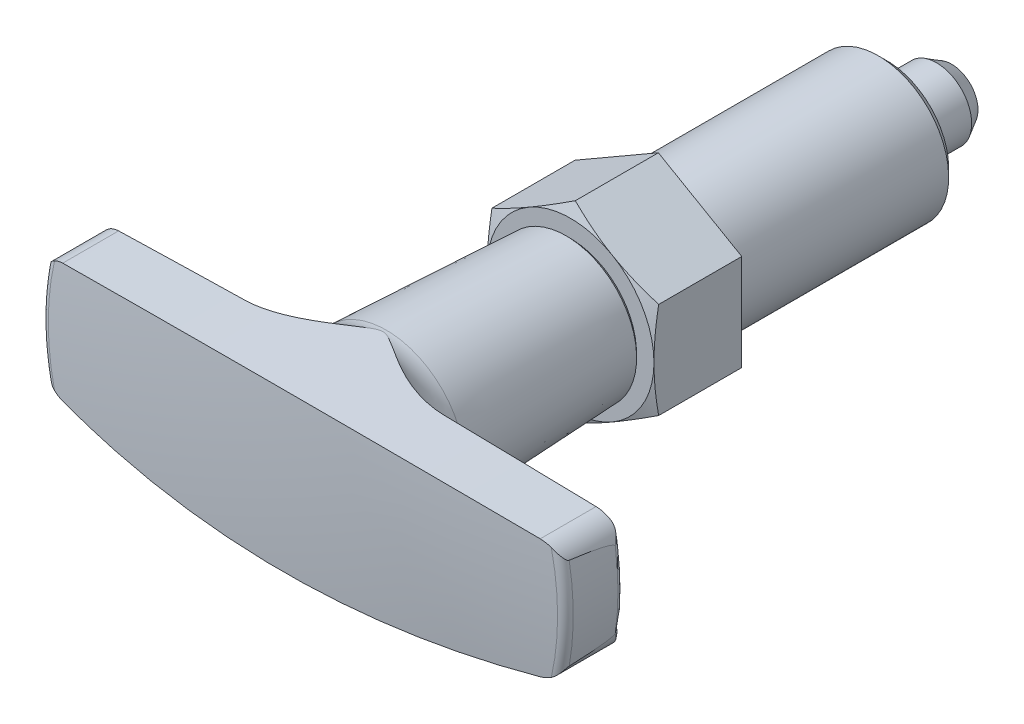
ISO-10303-21;
HEADER;
FILE_DESCRIPTION(('STEP AP214'),'2;1');
FILE_NAME('part.step','',(''),(''),'','','');
FILE_SCHEMA(('AUTOMOTIVE_DESIGN { 1 0 10303 214 1 1 1 1 }'));
ENDSEC;
DATA;
#1=APPLICATION_CONTEXT('core data for automotive mechanical design processes');
#2=APPLICATION_PROTOCOL_DEFINITION('international standard','automotive_design',2000,#1);
#3=PRODUCT_CONTEXT('',#1,'mechanical');
#4=PRODUCT('Part','Part','',(#3));
#5=PRODUCT_RELATED_PRODUCT_CATEGORY('part','',(#4));
#6=PRODUCT_DEFINITION_FORMATION('','',#4);
#7=PRODUCT_DEFINITION_CONTEXT('part definition',#1,'design');
#8=PRODUCT_DEFINITION('design','',#6,#7);
#9=PRODUCT_DEFINITION_SHAPE('','',#8);
#10=(LENGTH_UNIT() NAMED_UNIT(*) SI_UNIT(.MILLI.,.METRE.));
#11=(NAMED_UNIT(*) PLANE_ANGLE_UNIT() SI_UNIT($,.RADIAN.));
#12=(NAMED_UNIT(*) SI_UNIT($,.STERADIAN.) SOLID_ANGLE_UNIT());
#13=UNCERTAINTY_MEASURE_WITH_UNIT(LENGTH_MEASURE(1.E-05),#10,'distance_accuracy_value','');
#14=(GEOMETRIC_REPRESENTATION_CONTEXT(3) GLOBAL_UNCERTAINTY_ASSIGNED_CONTEXT((#13)) GLOBAL_UNIT_ASSIGNED_CONTEXT((#10,
#11,#12)) REPRESENTATION_CONTEXT('',''));
#15=CARTESIAN_POINT('',(0.,0.,0.));
#16=DIRECTION('',(0.,0.,1.));
#17=DIRECTION('',(1.,0.,0.));
#18=AXIS2_PLACEMENT_3D('',#15,#16,#17);
#19=CARTESIAN_POINT('',(0.,0.,-26.));
#20=DIRECTION('',(0.,0.,1.));
#21=DIRECTION('',(0.,-1.,0.));
#22=AXIS2_PLACEMENT_3D('',#19,#20,#21);
#23=CYLINDRICAL_SURFACE('',#22,8.);
#24=CARTESIAN_POINT('',(0.,0.,0.));
#25=DIRECTION('',(0.,0.,1.));
#26=DIRECTION('',(0.,-1.,0.));
#27=AXIS2_PLACEMENT_3D('',#24,#25,#26);
#28=CIRCLE('',#27,8.);
#29=CARTESIAN_POINT('',(0.,-8.,0.));
#30=VERTEX_POINT('',#29);
#31=EDGE_CURVE('E387',#30,#30,#28,.T.);
#32=ORIENTED_EDGE('',*,*,#31,.F.);
#33=EDGE_LOOP('',(#32));
#34=FACE_BOUND('',#33,.T.);
#35=CARTESIAN_POINT('',(0.,0.,-25.08));
#36=DIRECTION('',(0.,0.,1.));
#37=DIRECTION('',(0.,-1.,0.));
#38=AXIS2_PLACEMENT_3D('',#35,#36,#37);
#39=CIRCLE('',#38,8.);
#40=CARTESIAN_POINT('',(0.,-8.,-25.08));
#41=VERTEX_POINT('',#40);
#42=EDGE_CURVE('E384',#41,#41,#39,.T.);
#43=ORIENTED_EDGE('',*,*,#42,.T.);
#44=EDGE_LOOP('',(#43));
#45=FACE_BOUND('',#44,.T.);
#46=ADVANCED_FACE('F14',(#34,#45),#23,.T.);
#47=CARTESIAN_POINT('',(8.,0.,0.));
#48=DIRECTION('',(0.,0.,-1.));
#49=DIRECTION('',(0.,1.,0.));
#50=AXIS2_PLACEMENT_3D('',#47,#48,#49);
#51=PLANE('',#50);
#52=ORIENTED_EDGE('',*,*,#31,.T.);
#53=EDGE_LOOP('',(#52));
#54=FACE_BOUND('',#53,.T.);
#55=DIRECTION('',(-0.866025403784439,-0.5,0.));
#56=VECTOR('',#55,1.);
#57=CARTESIAN_POINT('',(0.,10.9696551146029,0.));
#58=LINE('',#57,#56);
#59=CARTESIAN_POINT('',(0.,10.9696551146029,0.));
#60=VERTEX_POINT('',#59);
#61=CARTESIAN_POINT('',(-9.5,5.48482755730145,0.));
#62=VERTEX_POINT('',#61);
#63=EDGE_CURVE('E377',#60,#62,#58,.T.);
#64=ORIENTED_EDGE('',*,*,#63,.F.);
#65=DIRECTION('',(-0.866025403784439,0.5,0.));
#66=VECTOR('',#65,1.);
#67=CARTESIAN_POINT('',(9.5,5.48482755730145,0.));
#68=LINE('',#67,#66);
#69=CARTESIAN_POINT('',(9.5,5.48482755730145,0.));
#70=VERTEX_POINT('',#69);
#71=EDGE_CURVE('E381',#70,#60,#68,.T.);
#72=ORIENTED_EDGE('',*,*,#71,.F.);
#73=DIRECTION('',(0.,1.,0.));
#74=VECTOR('',#73,1.);
#75=CARTESIAN_POINT('',(9.5,-5.48482755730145,0.));
#76=LINE('',#75,#74);
#77=CARTESIAN_POINT('',(9.5,-5.48482755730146,0.));
#78=VERTEX_POINT('',#77);
#79=EDGE_CURVE('E159',#78,#70,#76,.T.);
#80=ORIENTED_EDGE('',*,*,#79,.F.);
#81=DIRECTION('',(0.866025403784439,0.5,0.));
#82=VECTOR('',#81,1.);
#83=CARTESIAN_POINT('',(0.,-10.9696551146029,0.));
#84=LINE('',#83,#82);
#85=CARTESIAN_POINT('',(0.,-10.9696551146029,0.));
#86=VERTEX_POINT('',#85);
#87=EDGE_CURVE('E365',#86,#78,#84,.T.);
#88=ORIENTED_EDGE('',*,*,#87,.F.);
#89=DIRECTION('',(0.866025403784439,-0.5,0.));
#90=VECTOR('',#89,1.);
#91=CARTESIAN_POINT('',(-9.5,-5.48482755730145,0.));
#92=LINE('',#91,#90);
#93=CARTESIAN_POINT('',(-9.5,-5.48482755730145,0.));
#94=VERTEX_POINT('',#93);
#95=EDGE_CURVE('E370',#94,#86,#92,.T.);
#96=ORIENTED_EDGE('',*,*,#95,.F.);
#97=DIRECTION('',(0.,-1.,0.));
#98=VECTOR('',#97,1.);
#99=CARTESIAN_POINT('',(-9.5,5.48482755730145,0.));
#100=LINE('',#99,#98);
#101=EDGE_CURVE('E373',#62,#94,#100,.T.);
#102=ORIENTED_EDGE('',*,*,#101,.F.);
#103=EDGE_LOOP('',(#64,#72,#80,#88,#96,#102));
#104=FACE_BOUND('',#103,.T.);
#105=ADVANCED_FACE('F352',(#54,#104),#51,.T.);
#106=CARTESIAN_POINT('',(0.,0.,39.5192225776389));
#107=DIRECTION('',(0.,0.,1.));
#108=DIRECTION('',(0.,-1.,0.));
#109=AXIS2_PLACEMENT_3D('',#106,#107,#108);
#110=TOROIDAL_SURFACE('',#109,28.8504508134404,1.);
#111=CARTESIAN_POINT('',(29.38887921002,-5.22645520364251,39.5494933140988));
#112=CARTESIAN_POINT('',(29.388322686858,-5.22752929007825,39.5614412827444));
#113=CARTESIAN_POINT('',(29.3874321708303,-5.22925032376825,39.573295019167));
#114=CARTESIAN_POINT('',(29.3850493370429,-5.233834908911,39.596675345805));
#115=CARTESIAN_POINT('',(29.3835591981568,-5.23669432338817,39.6082029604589));
#116=CARTESIAN_POINT('',(29.3783525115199,-5.24663177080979,39.6417382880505));
#117=CARTESIAN_POINT('',(29.3738704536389,-5.25512738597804,39.6632101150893));
#118=CARTESIAN_POINT('',(29.3647032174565,-5.27223296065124,39.6992050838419));
#119=CARTESIAN_POINT('',(29.3603576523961,-5.28026781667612,39.7141097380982));
#120=CARTESIAN_POINT('',(29.350969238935,-5.29741110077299,39.7430635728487));
#121=CARTESIAN_POINT('',(29.3459260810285,-5.3065200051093,39.7571123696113));
#122=CARTESIAN_POINT('',(29.3298210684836,-5.33521590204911,39.7984089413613));
#123=CARTESIAN_POINT('',(29.3178757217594,-5.35599717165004,39.8244719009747));
#124=CARTESIAN_POINT('',(29.2872646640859,-5.40763677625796,39.883918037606));
#125=CARTESIAN_POINT('',(29.2677956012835,-5.43926267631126,39.9161884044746));
#126=CARTESIAN_POINT('',(29.2261854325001,-5.50391236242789,39.9775077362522));
#127=CARTESIAN_POINT('',(29.2040395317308,-5.53693858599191,40.0065507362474));
#128=CARTESIAN_POINT('',(29.1573610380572,-5.60350752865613,40.0620781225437));
#129=CARTESIAN_POINT('',(29.1328261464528,-5.63705071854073,40.0885599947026));
#130=CARTESIAN_POINT('',(29.0815465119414,-5.7040862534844,40.1392718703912));
#131=CARTESIAN_POINT('',(29.0548033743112,-5.7375786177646,40.1635034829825));
#132=CARTESIAN_POINT('',(28.990221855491,-5.81490394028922,40.2173474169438));
#133=CARTESIAN_POINT('',(28.9515778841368,-5.85860451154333,40.2461895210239));
#134=CARTESIAN_POINT('',(28.8705863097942,-5.94483391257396,40.3002935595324));
#135=CARTESIAN_POINT('',(28.8282364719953,-5.98736201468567,40.3255533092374));
#136=CARTESIAN_POINT('',(28.7401319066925,-6.07055629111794,40.3721018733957));
#137=CARTESIAN_POINT('',(28.6943946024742,-6.11123046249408,40.3934092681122));
#138=CARTESIAN_POINT('',(28.5994484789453,-6.19048718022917,40.4317328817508));
#139=CARTESIAN_POINT('',(28.550241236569,-6.22907066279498,40.4487510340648));
#140=CARTESIAN_POINT('',(28.4685946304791,-6.2889918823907,40.4721080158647));
#141=CARTESIAN_POINT('',(28.4371874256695,-6.31113491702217,40.4800126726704));
#142=CARTESIAN_POINT('',(28.373217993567,-6.35440456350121,40.4938254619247));
#143=CARTESIAN_POINT('',(28.3406548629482,-6.37553034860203,40.4997319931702));
#144=CARTESIAN_POINT('',(28.3075604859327,-6.39608884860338,40.5045434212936));
#145=B_SPLINE_CURVE_WITH_KNOTS('',3,(#111,#112,#113,#114,#115,#116,#117,#118,#119,#120,#121,
#122,#123,#124,#125,#126,#127,#128,#129,#130,#131,#132,#133,#134,#135,#136,#137,#138,#139,#140,
#141,#142,#143,#144),.UNSPECIFIED.,.F.,.F.,(4,2,2,2,2,2,2,2,2,2,2,2,2,2,2,2,4),(0.,
0.0359731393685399,0.0718167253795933,0.141986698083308,0.194365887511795,0.246768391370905,
0.352727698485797,0.500039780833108,0.647619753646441,0.795343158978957,0.942960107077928,
1.1379704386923,1.33309919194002,1.52728600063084,1.7213851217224,1.83900947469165,
1.95672786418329),.UNSPECIFIED.);
#146=CARTESIAN_POINT('',(29.38887921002,-5.22645520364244,39.5494933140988));
#147=VERTEX_POINT('',#146);
#148=CARTESIAN_POINT('',(28.3075604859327,-6.39608884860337,40.5045434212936));
#149=VERTEX_POINT('',#148);
#150=EDGE_CURVE('E513',#147,#149,#145,.T.);
#151=ORIENTED_EDGE('',*,*,#150,.F.);
#152=CARTESIAN_POINT('',(0.,0.,39.5494933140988));
#153=DIRECTION('',(0.,0.,-1.));
#154=DIRECTION('',(0.,1.,0.));
#155=AXIS2_PLACEMENT_3D('',#152,#153,#154);
#156=CIRCLE('',#155,29.8499925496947);
#157=CARTESIAN_POINT('',(29.3888792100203,5.22645520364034,39.5494933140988));
#158=VERTEX_POINT('',#157);
#159=EDGE_CURVE('E150',#158,#147,#156,.T.);
#160=ORIENTED_EDGE('',*,*,#159,.F.);
#161=CARTESIAN_POINT('',(28.3075604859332,6.39608884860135,40.5045434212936));
#162=CARTESIAN_POINT('',(28.3537722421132,6.36738747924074,40.4978155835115));
#163=CARTESIAN_POINT('',(28.3989390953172,6.33757699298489,40.488968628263));
#164=CARTESIAN_POINT('',(28.4869551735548,6.27605827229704,40.467521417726));
#165=CARTESIAN_POINT('',(28.5298071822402,6.2443524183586,40.4549257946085));
#166=CARTESIAN_POINT('',(28.6131988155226,6.17919884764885,40.4264067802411));
#167=CARTESIAN_POINT('',(28.6537315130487,6.14574643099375,40.4104740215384));
#168=CARTESIAN_POINT('',(28.732280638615,6.07743934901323,40.3756456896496));
#169=CARTESIAN_POINT('',(28.7702962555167,6.04258423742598,40.356749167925));
#170=CARTESIAN_POINT('',(28.8447089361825,5.97081594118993,40.3157174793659));
#171=CARTESIAN_POINT('',(28.8810371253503,5.93387273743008,40.2935101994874));
#172=CARTESIAN_POINT('',(28.950929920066,5.859104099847,40.2463944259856));
#173=CARTESIAN_POINT('',(28.9844943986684,5.82127862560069,40.2214858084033));
#174=CARTESIAN_POINT('',(29.0486839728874,5.74525302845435,40.1690629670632));
#175=CARTESIAN_POINT('',(29.0793195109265,5.70705481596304,40.1415587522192));
#176=CARTESIAN_POINT('',(29.1376811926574,5.63064408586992,40.0836700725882));
#177=CARTESIAN_POINT('',(29.1654090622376,5.59243159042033,40.0532873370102));
#178=CARTESIAN_POINT('',(29.2113352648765,5.5260469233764,39.9969266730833));
#179=CARTESIAN_POINT('',(29.2302044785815,5.49770748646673,39.9716919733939));
#180=CARTESIAN_POINT('',(29.2660868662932,5.44187557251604,39.9185914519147));
#181=CARTESIAN_POINT('',(29.2830877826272,5.41438945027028,39.8907102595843));
#182=CARTESIAN_POINT('',(29.3068974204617,5.37459397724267,39.8461291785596));
#183=CARTESIAN_POINT('',(29.3146138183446,5.36145574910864,39.8306561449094));
#184=CARTESIAN_POINT('',(29.3293101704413,5.33602099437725,39.7986666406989));
#185=CARTESIAN_POINT('',(29.3362895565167,5.32372511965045,39.7821493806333));
#186=CARTESIAN_POINT('',(29.3492492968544,5.3005499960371,39.7481393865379));
#187=CARTESIAN_POINT('',(29.3552423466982,5.28965322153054,39.7306636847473));
#188=CARTESIAN_POINT('',(29.3660954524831,5.26967021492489,39.6943961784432));
#189=CARTESIAN_POINT('',(29.37095792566,5.26058012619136,39.6756072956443));
#190=CARTESIAN_POINT('',(29.3786294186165,5.24610813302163,39.6393754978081));
#191=CARTESIAN_POINT('',(29.3816312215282,5.24038423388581,39.6221158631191));
#192=CARTESIAN_POINT('',(29.3863373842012,5.2313651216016,39.5865063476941));
#193=CARTESIAN_POINT('',(29.3880192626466,5.22811202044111,39.5681430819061));
#194=CARTESIAN_POINT('',(29.3888792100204,5.22645520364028,39.5494933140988));
#195=B_SPLINE_CURVE_WITH_KNOTS('',3,(#161,#162,#163,#164,#165,#166,#167,#168,#169,#170,#171,
#172,#173,#174,#175,#176,#177,#178,#179,#180,#181,#182,#183,#184,#185,#186,#187,#188,#189,#190,
#191,#192,#193,#194),.UNSPECIFIED.,.F.,.F.,(4,2,2,2,2,2,2,2,2,2,2,2,2,2,2,2,4),(0.,
0.164321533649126,0.328440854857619,0.493027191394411,0.657666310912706,0.82663596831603,
0.99561338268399,1.16396393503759,1.3322139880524,1.45926392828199,1.58710309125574,
1.652210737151,1.71736821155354,1.78160722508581,1.84570760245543,1.90077761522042,
1.95676638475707),.UNSPECIFIED.);
#196=CARTESIAN_POINT('',(28.3075604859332,6.39608884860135,40.5045434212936));
#197=VERTEX_POINT('',#196);
#198=EDGE_CURVE('E333',#197,#158,#195,.T.);
#199=ORIENTED_EDGE('',*,*,#198,.F.);
#200=CARTESIAN_POINT('',(0.,0.,40.5045434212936));
#201=DIRECTION('',(0.,0.,1.));
#202=DIRECTION('',(0.,-1.,0.));
#203=AXIS2_PLACEMENT_3D('',#200,#201,#202);
#204=CIRCLE('',#203,29.0211635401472);
#205=EDGE_CURVE('E560',#149,#197,#204,.T.);
#206=ORIENTED_EDGE('',*,*,#205,.F.);
#207=EDGE_LOOP('',(#151,#160,#199,#206));
#208=FACE_BOUND('',#207,.T.);
#209=ADVANCED_FACE('F346',(#208),#110,.T.);
#210=CARTESIAN_POINT('',(0.,0.,34.6038032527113));
#211=DIRECTION('',(0.,0.,-1.));
#212=DIRECTION('',(1.,0.,0.));
#213=AXIS2_PLACEMENT_3D('',#210,#211,#212);
#214=CONICAL_SURFACE('',#213,29.9997708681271,0.030275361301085);
#215=ORIENTED_EDGE('',*,*,#159,.T.);
#216=CARTESIAN_POINT('',(29.6879701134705,-4.31401004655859,34.6038032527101));
#217=CARTESIAN_POINT('',(29.6864691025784,-4.3235448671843,34.6075734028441));
#218=CARTESIAN_POINT('',(29.6850125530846,-4.33251246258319,34.6124380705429));
#219=CARTESIAN_POINT('',(29.6822156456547,-4.34929811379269,34.6236182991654));
#220=CARTESIAN_POINT('',(29.6808736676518,-4.3571339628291,34.6299061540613));
#221=CARTESIAN_POINT('',(29.6772391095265,-4.37792215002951,34.6487747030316));
#222=CARTESIAN_POINT('',(29.6750467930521,-4.38994108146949,34.6623595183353));
#223=CARTESIAN_POINT('',(29.6708515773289,-4.41229613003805,34.6910852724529));
#224=CARTESIAN_POINT('',(29.6688515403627,-4.42260810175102,34.7062442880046));
#225=CARTESIAN_POINT('',(29.6632413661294,-4.45086035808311,34.7516183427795));
#226=CARTESIAN_POINT('',(29.6598373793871,-4.46712017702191,34.782887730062));
#227=CARTESIAN_POINT('',(29.653357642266,-4.49706224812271,34.8466913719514));
#228=CARTESIAN_POINT('',(29.6502828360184,-4.51073716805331,34.8792289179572));
#229=CARTESIAN_POINT('',(29.6413938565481,-4.54920019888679,34.9778293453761));
#230=CARTESIAN_POINT('',(29.6359123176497,-4.57143993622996,35.0449059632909));
#231=CARTESIAN_POINT('',(29.6202943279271,-4.63243999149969,35.2460633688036));
#232=CARTESIAN_POINT('',(29.6108369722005,-4.66613621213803,35.3816371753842));
#233=CARTESIAN_POINT('',(29.5927625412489,-4.72733067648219,35.6543756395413));
#234=CARTESIAN_POINT('',(29.584146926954,-4.75481824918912,35.7915426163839));
#235=CARTESIAN_POINT('',(29.5674635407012,-4.80583863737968,36.0665693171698));
#236=CARTESIAN_POINT('',(29.5593954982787,-4.82937341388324,36.2044286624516));
#237=CARTESIAN_POINT('',(29.5436379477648,-4.87374768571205,36.4804862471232));
#238=CARTESIAN_POINT('',(29.5359481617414,-4.8945891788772,36.6186841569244));
#239=CARTESIAN_POINT('',(29.5157108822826,-4.94779839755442,36.9894161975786));
#240=CARTESIAN_POINT('',(29.5034144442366,-4.97837124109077,37.222220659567));
#241=CARTESIAN_POINT('',(29.4793404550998,-5.0358202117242,37.6883890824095));
#242=CARTESIAN_POINT('',(29.4675630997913,-5.06269495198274,37.9217532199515));
#243=CARTESIAN_POINT('',(29.4444627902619,-5.11357014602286,38.3874500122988));
#244=CARTESIAN_POINT('',(29.4331376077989,-5.13758627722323,38.6197808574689));
#245=CARTESIAN_POINT('',(29.4107972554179,-5.1834790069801,39.0845489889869));
#246=CARTESIAN_POINT('',(29.3997819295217,-5.20535669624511,39.316986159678));
#247=CARTESIAN_POINT('',(29.3888792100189,-5.22645520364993,39.5494933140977));
#248=B_SPLINE_CURVE_WITH_KNOTS('',3,(#216,#217,#218,#219,#220,#221,#222,#223,#224,#225,#226,
#227,#228,#229,#230,#231,#232,#233,#234,#235,#236,#237,#238,#239,#240,#241,#242,#243,#244,#245,
#246,#247),.UNSPECIFIED.,.F.,.F.,(4,2,2,2,2,2,2,2,2,2,2,2,2,2,2,4),(0.,0.0308276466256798,
0.0611001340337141,0.115638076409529,0.170891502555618,0.276833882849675,0.383072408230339,
0.595462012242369,1.01516869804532,1.43559134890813,1.85580480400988,2.27570473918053,
2.98102707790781,3.68661320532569,4.38813153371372,5.08929016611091),.UNSPECIFIED.);
#249=CARTESIAN_POINT('',(29.6879701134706,-4.31401004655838,34.6038032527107));
#250=VERTEX_POINT('',#249);
#251=EDGE_CURVE('E144',#250,#147,#248,.T.);
#252=ORIENTED_EDGE('',*,*,#251,.F.);
#253=CARTESIAN_POINT('',(0.,0.,34.6038032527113));
#254=DIRECTION('',(0.,0.,1.));
#255=DIRECTION('',(0.,-1.,0.));
#256=AXIS2_PLACEMENT_3D('',#253,#254,#255);
#257=CIRCLE('',#256,29.9997708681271);
#258=CARTESIAN_POINT('',(29.6879701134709,4.31401004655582,34.6038032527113));
#259=VERTEX_POINT('',#258);
#260=EDGE_CURVE('E510',#259,#250,#257,.F.);
#261=ORIENTED_EDGE('',*,*,#260,.F.);
#262=CARTESIAN_POINT('',(29.3888792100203,5.22645520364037,39.5494933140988));
#263=CARTESIAN_POINT('',(29.3960998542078,5.21249838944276,39.3954393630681));
#264=CARTESIAN_POINT('',(29.4033732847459,5.19817495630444,39.2414215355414));
#265=CARTESIAN_POINT('',(29.4180435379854,5.16866824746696,38.9334701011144));
#266=CARTESIAN_POINT('',(29.425440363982,5.15348494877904,38.779536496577));
#267=CARTESIAN_POINT('',(29.4478444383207,5.10645153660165,38.3178437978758));
#268=CARTESIAN_POINT('',(29.4630630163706,5.07312223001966,38.0102414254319));
#269=CARTESIAN_POINT('',(29.4886953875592,5.01374947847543,37.5061456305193));
#270=CARTESIAN_POINT('',(29.4988707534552,4.98939125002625,37.3094433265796));
#271=CARTESIAN_POINT('',(29.5196740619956,4.93745471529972,36.9164819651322));
#272=CARTESIAN_POINT('',(29.5303020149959,4.90987633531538,36.7202229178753));
#273=CARTESIAN_POINT('',(29.5552520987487,4.84183851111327,36.2736063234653));
#274=CARTESIAN_POINT('',(29.5697760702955,4.7999337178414,36.0234705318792));
#275=CARTESIAN_POINT('',(29.5952234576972,4.71935745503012,35.6157126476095));
#276=CARTESIAN_POINT('',(29.6055560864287,4.68497123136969,35.4572630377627));
#277=CARTESIAN_POINT('',(29.6203016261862,4.63140751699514,35.2502318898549));
#278=CARTESIAN_POINT('',(29.6239626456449,4.61778630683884,35.2002005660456));
#279=CARTESIAN_POINT('',(29.6315256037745,4.58871551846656,35.1008026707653));
#280=CARTESIAN_POINT('',(29.6354271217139,4.57326909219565,35.0514351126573));
#281=CARTESIAN_POINT('',(29.6447314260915,4.53503715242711,34.9396249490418));
#282=CARTESIAN_POINT('',(29.6502465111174,4.51141194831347,34.8774378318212));
#283=CARTESIAN_POINT('',(29.6594147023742,4.46908569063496,34.7869971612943));
#284=CARTESIAN_POINT('',(29.6626450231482,4.45370068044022,34.7571312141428));
#285=CARTESIAN_POINT('',(29.6695903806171,4.41901840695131,34.6997135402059));
#286=CARTESIAN_POINT('',(29.6733015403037,4.39975181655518,34.6721459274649));
#287=CARTESIAN_POINT('',(29.6787318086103,4.3694079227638,34.6409263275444));
#288=CARTESIAN_POINT('',(29.6800583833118,4.36185381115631,34.6338982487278));
#289=CARTESIAN_POINT('',(29.6828045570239,4.3458063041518,34.6210840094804));
#290=CARTESIAN_POINT('',(29.6842234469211,4.33731978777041,34.6152895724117));
#291=CARTESIAN_POINT('',(29.6864346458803,4.32369130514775,34.6079667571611));
#292=CARTESIAN_POINT('',(29.6871978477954,4.31891852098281,34.6057309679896));
#293=CARTESIAN_POINT('',(29.6879701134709,4.31401004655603,34.603803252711));
#294=B_SPLINE_CURVE_WITH_KNOTS('',3,(#262,#263,#264,#265,#266,#267,#268,#269,#270,#271,#272,
#273,#274,#275,#276,#277,#278,#279,#280,#281,#282,#283,#284,#285,#286,#287,#288,#289,#290,#291,
#292,#293),.UNSPECIFIED.,.F.,.F.,(4,2,2,2,2,2,2,2,2,2,2,2,2,2,2,4),(0.,0.4645582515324,
0.929128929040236,1.8584168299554,2.45379318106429,3.04918316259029,3.81109677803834,
4.29820215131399,4.45410629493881,4.60974503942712,4.80944972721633,4.91068296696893,
5.01114558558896,5.0422836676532,5.07320575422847,5.08916201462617),.UNSPECIFIED.);
#295=EDGE_CURVE('E325',#158,#259,#294,.T.);
#296=ORIENTED_EDGE('',*,*,#295,.F.);
#297=EDGE_LOOP('',(#215,#252,#261,#296));
#298=FACE_BOUND('',#297,.T.);
#299=ADVANCED_FACE('F351',(#298),#214,.T.);
#300=CARTESIAN_POINT('',(0.,0.,39.5192225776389));
#301=DIRECTION('',(0.,0.,1.));
#302=DIRECTION('',(0.,-1.,0.));
#303=AXIS2_PLACEMENT_3D('',#300,#301,#302);
#304=TOROIDAL_SURFACE('',#303,28.8504508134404,1.);
#305=CARTESIAN_POINT('',(-29.3888792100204,5.22645520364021,39.5494933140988));
#306=CARTESIAN_POINT('',(-29.3883226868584,5.227529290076,39.5614412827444));
#307=CARTESIAN_POINT('',(-29.3874321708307,5.22925032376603,39.573295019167));
#308=CARTESIAN_POINT('',(-29.3850493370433,5.23383490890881,39.596675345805));
#309=CARTESIAN_POINT('',(-29.3835591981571,5.23669432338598,39.6082029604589));
#310=CARTESIAN_POINT('',(-29.3783525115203,5.24663177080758,39.6417382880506));
#311=CARTESIAN_POINT('',(-29.3738704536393,5.25512738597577,39.6632101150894));
#312=CARTESIAN_POINT('',(-29.3647032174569,5.27223296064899,39.699205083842));
#313=CARTESIAN_POINT('',(-29.3603576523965,5.28026781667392,39.7141097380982));
#314=CARTESIAN_POINT('',(-29.3509692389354,5.29741110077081,39.7430635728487));
#315=CARTESIAN_POINT('',(-29.3459260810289,5.30652000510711,39.7571123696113));
#316=CARTESIAN_POINT('',(-29.329821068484,5.33521590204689,39.7984089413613));
#317=CARTESIAN_POINT('',(-29.3178757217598,5.35599717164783,39.8244719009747));
#318=CARTESIAN_POINT('',(-29.2872646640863,5.40763677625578,39.883918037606));
#319=CARTESIAN_POINT('',(-29.2677956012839,5.4392626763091,39.9161884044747));
#320=CARTESIAN_POINT('',(-29.2261854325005,5.50391236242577,39.9775077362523));
#321=CARTESIAN_POINT('',(-29.2040395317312,5.53693858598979,40.0065507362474));
#322=CARTESIAN_POINT('',(-29.1573610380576,5.60350752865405,40.0620781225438));
#323=CARTESIAN_POINT('',(-29.1328261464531,5.63705071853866,40.0885599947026));
#324=CARTESIAN_POINT('',(-29.0815465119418,5.70408625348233,40.1392718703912));
#325=CARTESIAN_POINT('',(-29.0548033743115,5.73757861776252,40.1635034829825));
#326=CARTESIAN_POINT('',(-28.9902218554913,5.81490394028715,40.2173474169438));
#327=CARTESIAN_POINT('',(-28.9515778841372,5.8586045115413,40.2461895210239));
#328=CARTESIAN_POINT('',(-28.8705863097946,5.94483391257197,40.3002935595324));
#329=CARTESIAN_POINT('',(-28.8282364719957,5.98736201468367,40.3255533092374));
#330=CARTESIAN_POINT('',(-28.7401319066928,6.07055629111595,40.3721018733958));
#331=CARTESIAN_POINT('',(-28.6943946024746,6.1112304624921,40.3934092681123));
#332=CARTESIAN_POINT('',(-28.5994484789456,6.1904871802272,40.4317328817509));
#333=CARTESIAN_POINT('',(-28.5502412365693,6.22907066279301,40.4487510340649));
#334=CARTESIAN_POINT('',(-28.4685946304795,6.28899188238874,40.4721080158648));
#335=CARTESIAN_POINT('',(-28.4371874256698,6.31113491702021,40.4800126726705));
#336=CARTESIAN_POINT('',(-28.3732179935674,6.35440456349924,40.4938254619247));
#337=CARTESIAN_POINT('',(-28.3406548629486,6.37553034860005,40.4997319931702));
#338=CARTESIAN_POINT('',(-28.3075604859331,6.39608884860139,40.5045434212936));
#339=B_SPLINE_CURVE_WITH_KNOTS('',3,(#305,#306,#307,#308,#309,#310,#311,#312,#313,#314,#315,
#316,#317,#318,#319,#320,#321,#322,#323,#324,#325,#326,#327,#328,#329,#330,#331,#332,#333,#334,
#335,#336,#337,#338),.UNSPECIFIED.,.F.,.F.,(4,2,2,2,2,2,2,2,2,2,2,2,2,2,2,2,4),(0.,
0.0359731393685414,0.071816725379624,0.141986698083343,0.194365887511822,0.246768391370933,
0.352727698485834,0.500039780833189,0.647619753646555,0.795343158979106,0.942960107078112,
1.1379704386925,1.33309919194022,1.52728600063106,1.72138512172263,1.83900947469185,
1.95672786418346),.UNSPECIFIED.);
#340=CARTESIAN_POINT('',(-29.3888792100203,5.2264552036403,39.5494933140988));
#341=VERTEX_POINT('',#340);
#342=CARTESIAN_POINT('',(-28.3075604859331,6.39608884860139,40.5045434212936));
#343=VERTEX_POINT('',#342);
#344=EDGE_CURVE('E577',#341,#343,#339,.T.);
#345=ORIENTED_EDGE('',*,*,#344,.F.);
#346=CARTESIAN_POINT('',(0.,0.,39.5494933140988));
#347=DIRECTION('',(0.,0.,-1.));
#348=DIRECTION('',(0.,1.,0.));
#349=AXIS2_PLACEMENT_3D('',#346,#347,#348);
#350=CIRCLE('',#349,29.8499925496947);
#351=CARTESIAN_POINT('',(-29.3888792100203,-5.22645520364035,39.5494933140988));
#352=VERTEX_POINT('',#351);
#353=EDGE_CURVE('E364',#352,#341,#350,.T.);
#354=ORIENTED_EDGE('',*,*,#353,.F.);
#355=CARTESIAN_POINT('',(-28.3075604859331,-6.39608884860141,40.5045434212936));
#356=CARTESIAN_POINT('',(-28.3537722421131,-6.36738747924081,40.4978155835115));
#357=CARTESIAN_POINT('',(-28.3989390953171,-6.33757699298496,40.488968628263));
#358=CARTESIAN_POINT('',(-28.4869551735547,-6.27605827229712,40.467521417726));
#359=CARTESIAN_POINT('',(-28.5298071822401,-6.24435241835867,40.4549257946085));
#360=CARTESIAN_POINT('',(-28.6131988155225,-6.17919884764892,40.4264067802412));
#361=CARTESIAN_POINT('',(-28.6537315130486,-6.14574643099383,40.4104740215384));
#362=CARTESIAN_POINT('',(-28.7322806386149,-6.0774393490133,40.3756456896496));
#363=CARTESIAN_POINT('',(-28.7702962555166,-6.04258423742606,40.356749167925));
#364=CARTESIAN_POINT('',(-28.8447089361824,-5.97081594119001,40.315717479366));
#365=CARTESIAN_POINT('',(-28.8810371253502,-5.93387273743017,40.2935101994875));
#366=CARTESIAN_POINT('',(-28.950929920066,-5.85910409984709,40.2463944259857));
#367=CARTESIAN_POINT('',(-28.9844943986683,-5.82127862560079,40.2214858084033));
#368=CARTESIAN_POINT('',(-29.0486839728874,-5.74525302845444,40.1690629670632));
#369=CARTESIAN_POINT('',(-29.0793195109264,-5.70705481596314,40.1415587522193));
#370=CARTESIAN_POINT('',(-29.1376811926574,-5.63064408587,40.0836700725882));
#371=CARTESIAN_POINT('',(-29.1654090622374,-5.5924315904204,40.0532873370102));
#372=CARTESIAN_POINT('',(-29.2113352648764,-5.52604692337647,39.9969266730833));
#373=CARTESIAN_POINT('',(-29.2302044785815,-5.49770748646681,39.9716919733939));
#374=CARTESIAN_POINT('',(-29.2660868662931,-5.44187557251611,39.9185914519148));
#375=CARTESIAN_POINT('',(-29.2830877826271,-5.41438945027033,39.8907102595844));
#376=CARTESIAN_POINT('',(-29.3068974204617,-5.37459397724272,39.8461291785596));
#377=CARTESIAN_POINT('',(-29.3146138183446,-5.3614557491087,39.8306561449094));
#378=CARTESIAN_POINT('',(-29.3293101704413,-5.33602099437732,39.798666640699));
#379=CARTESIAN_POINT('',(-29.3362895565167,-5.32372511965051,39.7821493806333));
#380=CARTESIAN_POINT('',(-29.3492492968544,-5.30054999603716,39.7481393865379));
#381=CARTESIAN_POINT('',(-29.3552423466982,-5.28965322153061,39.7306636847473));
#382=CARTESIAN_POINT('',(-29.3660954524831,-5.26967021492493,39.6943961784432));
#383=CARTESIAN_POINT('',(-29.37095792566,-5.26058012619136,39.6756072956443));
#384=CARTESIAN_POINT('',(-29.3786294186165,-5.24610813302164,39.6393754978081));
#385=CARTESIAN_POINT('',(-29.3816312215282,-5.24038423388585,39.6221158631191));
#386=CARTESIAN_POINT('',(-29.3863373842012,-5.23136512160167,39.5865063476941));
#387=CARTESIAN_POINT('',(-29.3880192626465,-5.22811202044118,39.5681430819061));
#388=CARTESIAN_POINT('',(-29.3888792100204,-5.22645520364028,39.5494933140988));
#389=B_SPLINE_CURVE_WITH_KNOTS('',3,(#355,#356,#357,#358,#359,#360,#361,#362,#363,#364,#365,
#366,#367,#368,#369,#370,#371,#372,#373,#374,#375,#376,#377,#378,#379,#380,#381,#382,#383,#384,
#385,#386,#387,#388),.UNSPECIFIED.,.F.,.F.,(4,2,2,2,2,2,2,2,2,2,2,2,2,2,2,2,4),(0.,
0.164321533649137,0.32844085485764,0.493027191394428,0.657666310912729,0.826635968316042,
0.995613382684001,1.1639639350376,1.33221398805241,1.45926392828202,1.58710309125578,
1.65221073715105,1.7173682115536,1.78160722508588,1.8457076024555,1.90077761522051,
1.95676638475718),.UNSPECIFIED.);
#390=CARTESIAN_POINT('',(-28.3075604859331,-6.3960888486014,40.5045434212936));
#391=VERTEX_POINT('',#390);
#392=EDGE_CURVE('E485',#391,#352,#389,.T.);
#393=ORIENTED_EDGE('',*,*,#392,.F.);
#394=CARTESIAN_POINT('',(0.,0.,40.5045434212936));
#395=DIRECTION('',(0.,0.,1.));
#396=DIRECTION('',(0.,-1.,0.));
#397=AXIS2_PLACEMENT_3D('',#394,#395,#396);
#398=CIRCLE('',#397,29.0211635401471);
#399=EDGE_CURVE('E528',#343,#391,#398,.T.);
#400=ORIENTED_EDGE('',*,*,#399,.F.);
#401=EDGE_LOOP('',(#345,#354,#393,#400));
#402=FACE_BOUND('',#401,.T.);
#403=ADVANCED_FACE('F497',(#402),#304,.T.);
#404=CARTESIAN_POINT('',(0.,0.,34.6038032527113));
#405=DIRECTION('',(0.,0.,-1.));
#406=DIRECTION('',(1.,0.,0.));
#407=AXIS2_PLACEMENT_3D('',#404,#405,#406);
#408=CONICAL_SURFACE('',#407,29.9997708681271,0.030275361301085);
#409=ORIENTED_EDGE('',*,*,#353,.T.);
#410=CARTESIAN_POINT('',(-29.6879701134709,4.31401004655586,34.6038032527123));
#411=CARTESIAN_POINT('',(-29.6864691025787,4.32354486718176,34.6075734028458));
#412=CARTESIAN_POINT('',(-29.6850125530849,4.33251246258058,34.6124380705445));
#413=CARTESIAN_POINT('',(-29.6822156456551,4.34929811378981,34.6236182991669));
#414=CARTESIAN_POINT('',(-29.6808736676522,4.35713396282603,34.6299061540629));
#415=CARTESIAN_POINT('',(-29.677239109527,4.37792215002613,34.648774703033));
#416=CARTESIAN_POINT('',(-29.6750467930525,4.38994108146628,34.6623595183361));
#417=CARTESIAN_POINT('',(-29.6708515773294,4.41229613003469,34.6910852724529));
#418=CARTESIAN_POINT('',(-29.6688515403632,4.42260810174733,34.7062442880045));
#419=CARTESIAN_POINT('',(-29.66324136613,4.4508603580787,34.7516183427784));
#420=CARTESIAN_POINT('',(-29.6598373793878,4.46712017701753,34.7828877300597));
#421=CARTESIAN_POINT('',(-29.6533576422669,4.49706224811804,34.8466913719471));
#422=CARTESIAN_POINT('',(-29.6502828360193,4.51073716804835,34.8792289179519));
#423=CARTESIAN_POINT('',(-29.6413938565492,4.54920019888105,34.977829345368));
#424=CARTESIAN_POINT('',(-29.6359123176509,4.57143993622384,35.0449059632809));
#425=CARTESIAN_POINT('',(-29.6202943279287,4.63243999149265,35.2460633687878));
#426=CARTESIAN_POINT('',(-29.6108369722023,4.66613621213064,35.3816371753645));
#427=CARTESIAN_POINT('',(-29.592762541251,4.72733067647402,35.6543756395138));
#428=CARTESIAN_POINT('',(-29.5841469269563,4.75481824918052,35.7915426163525));
#429=CARTESIAN_POINT('',(-29.5674635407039,4.80583863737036,36.0665693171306));
#430=CARTESIAN_POINT('',(-29.5593954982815,4.82937341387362,36.2044286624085));
#431=CARTESIAN_POINT('',(-29.5436379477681,4.87374768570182,36.4804862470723));
#432=CARTESIAN_POINT('',(-29.5359481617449,4.89458917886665,36.6186841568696));
#433=CARTESIAN_POINT('',(-29.5157108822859,4.94779839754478,36.9894161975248));
#434=CARTESIAN_POINT('',(-29.5034144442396,4.9783712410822,37.2222206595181));
#435=CARTESIAN_POINT('',(-29.4793404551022,5.0358202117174,37.6883890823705));
#436=CARTESIAN_POINT('',(-29.4675630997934,5.06269495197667,37.9217532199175));
#437=CARTESIAN_POINT('',(-29.4444627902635,5.11357014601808,38.3874500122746));
#438=CARTESIAN_POINT('',(-29.4331376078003,5.13758627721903,38.6197808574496));
#439=CARTESIAN_POINT('',(-29.4107972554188,5.18347900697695,39.0845489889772));
#440=CARTESIAN_POINT('',(-29.3997819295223,5.20535669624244,39.3169861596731));
#441=CARTESIAN_POINT('',(-29.3888792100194,5.22645520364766,39.5494933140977));
#442=B_SPLINE_CURVE_WITH_KNOTS('',3,(#410,#411,#412,#413,#414,#415,#416,#417,#418,#419,#420,
#421,#422,#423,#424,#425,#426,#427,#428,#429,#430,#431,#432,#433,#434,#435,#436,#437,#438,#439,
#440,#441),.UNSPECIFIED.,.F.,.F.,(4,2,2,2,2,2,2,2,2,2,2,2,2,2,2,4),(0.,0.0308276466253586,
0.0611001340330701,0.115638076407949,0.170891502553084,0.276833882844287,0.383072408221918,
0.595462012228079,1.01516869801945,1.43559134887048,1.85580480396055,2.27570473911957,
2.98102707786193,3.68661320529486,4.3881315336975,5.08929016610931),.UNSPECIFIED.);
#443=CARTESIAN_POINT('',(-29.6879701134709,4.31401004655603,34.6038032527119));
#444=VERTEX_POINT('',#443);
#445=EDGE_CURVE('E581',#444,#341,#442,.T.);
#446=ORIENTED_EDGE('',*,*,#445,.F.);
#447=CARTESIAN_POINT('',(0.,0.,34.6038032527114));
#448=DIRECTION('',(0.,0.,1.));
#449=DIRECTION('',(0.,-1.,0.));
#450=AXIS2_PLACEMENT_3D('',#447,#448,#449);
#451=CIRCLE('',#450,29.9997708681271);
#452=CARTESIAN_POINT('',(-29.6879701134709,-4.31401004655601,34.6038032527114));
#453=VERTEX_POINT('',#452);
#454=EDGE_CURVE('E578',#453,#444,#451,.F.);
#455=ORIENTED_EDGE('',*,*,#454,.F.);
#456=CARTESIAN_POINT('',(-29.3888792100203,-5.22645520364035,39.5494933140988));
#457=CARTESIAN_POINT('',(-29.3960998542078,-5.21249838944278,39.3954393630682));
#458=CARTESIAN_POINT('',(-29.4033732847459,-5.19817495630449,39.2414215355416));
#459=CARTESIAN_POINT('',(-29.4180435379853,-5.16866824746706,38.9334701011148));
#460=CARTESIAN_POINT('',(-29.425440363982,-5.15348494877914,38.7795364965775));
#461=CARTESIAN_POINT('',(-29.4478444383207,-5.10645153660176,38.3178437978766));
#462=CARTESIAN_POINT('',(-29.4630630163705,-5.07312223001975,38.010241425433));
#463=CARTESIAN_POINT('',(-29.4886953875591,-5.01374947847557,37.5061456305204));
#464=CARTESIAN_POINT('',(-29.4988707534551,-4.98939125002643,37.3094433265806));
#465=CARTESIAN_POINT('',(-29.5196740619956,-4.93745471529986,36.9164819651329));
#466=CARTESIAN_POINT('',(-29.5303020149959,-4.90987633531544,36.7202229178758));
#467=CARTESIAN_POINT('',(-29.5552520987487,-4.84183851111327,36.2736063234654));
#468=CARTESIAN_POINT('',(-29.5697760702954,-4.79993371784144,36.0234705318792));
#469=CARTESIAN_POINT('',(-29.5952234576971,-4.71935745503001,35.6157126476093));
#470=CARTESIAN_POINT('',(-29.6055560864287,-4.68497123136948,35.4572630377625));
#471=CARTESIAN_POINT('',(-29.6203016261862,-4.63140751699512,35.2502318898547));
#472=CARTESIAN_POINT('',(-29.6239626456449,-4.6177863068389,35.2002005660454));
#473=CARTESIAN_POINT('',(-29.6315256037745,-4.58871551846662,35.1008026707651));
#474=CARTESIAN_POINT('',(-29.6354271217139,-4.57326909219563,35.0514351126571));
#475=CARTESIAN_POINT('',(-29.6447314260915,-4.53503715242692,34.9396249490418));
#476=CARTESIAN_POINT('',(-29.6502465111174,-4.51141194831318,34.8774378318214));
#477=CARTESIAN_POINT('',(-29.6594147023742,-4.46908569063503,34.7869971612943));
#478=CARTESIAN_POINT('',(-29.6626450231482,-4.45370068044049,34.7571312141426));
#479=CARTESIAN_POINT('',(-29.6695903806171,-4.41901840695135,34.6997135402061));
#480=CARTESIAN_POINT('',(-29.6733015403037,-4.39975181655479,34.6721459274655));
#481=CARTESIAN_POINT('',(-29.6787318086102,-4.36940792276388,34.6409263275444));
#482=CARTESIAN_POINT('',(-29.6800583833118,-4.36185381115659,34.6338982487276));
#483=CARTESIAN_POINT('',(-29.6828045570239,-4.34580630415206,34.6210840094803));
#484=CARTESIAN_POINT('',(-29.684223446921,-4.33731978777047,34.6152895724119));
#485=CARTESIAN_POINT('',(-29.6864346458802,-4.32369130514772,34.6079667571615));
#486=CARTESIAN_POINT('',(-29.6871978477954,-4.3189185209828,34.60573096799));
#487=CARTESIAN_POINT('',(-29.6879701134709,-4.31401004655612,34.6038032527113));
#488=B_SPLINE_CURVE_WITH_KNOTS('',3,(#456,#457,#458,#459,#460,#461,#462,#463,#464,#465,#466,
#467,#468,#469,#470,#471,#472,#473,#474,#475,#476,#477,#478,#479,#480,#481,#482,#483,#484,#485,
#486,#487),.UNSPECIFIED.,.F.,.F.,(4,2,2,2,2,2,2,2,2,2,2,2,2,2,2,4),(0.,0.464558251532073,
0.929128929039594,1.85841682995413,2.45379318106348,3.04918316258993,3.8110967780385,
4.2982021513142,4.45410629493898,4.60974503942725,4.8094497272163,4.91068296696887,
5.01114558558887,5.04228366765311,5.07320575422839,5.08916201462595),.UNSPECIFIED.);
#489=EDGE_CURVE('E477',#352,#453,#488,.T.);
#490=ORIENTED_EDGE('',*,*,#489,.F.);
#491=EDGE_LOOP('',(#409,#446,#455,#490));
#492=FACE_BOUND('',#491,.T.);
#493=ADVANCED_FACE('F501',(#492),#408,.T.);
#494=CARTESIAN_POINT('',(9.5,-5.48482755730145,0.));
#495=DIRECTION('',(1.,0.,0.));
#496=DIRECTION('',(0.,1.,0.));
#497=AXIS2_PLACEMENT_3D('',#494,#495,#496);
#498=PLANE('',#497);
#499=CARTESIAN_POINT('',(9.5,0.,10.));
#500=CARTESIAN_POINT('',(9.5,0.230241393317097,10.0000192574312));
#501=CARTESIAN_POINT('',(9.5,0.460479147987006,9.99695392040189));
#502=CARTESIAN_POINT('',(9.5,0.920781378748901,9.98479616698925));
#503=CARTESIAN_POINT('',(9.5,1.15084586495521,9.97570413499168));
#504=CARTESIAN_POINT('',(9.5,1.61019189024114,9.95165983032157));
#505=CARTESIAN_POINT('',(9.5,1.83947406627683,9.93671965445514));
#506=CARTESIAN_POINT('',(9.5,2.29760343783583,9.90124447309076));
#507=CARTESIAN_POINT('',(9.5,2.52645063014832,9.88070942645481));
#508=CARTESIAN_POINT('',(9.5,3.21195672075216,9.81120894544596));
#509=CARTESIAN_POINT('',(9.5,3.66781660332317,9.75433517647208));
#510=CARTESIAN_POINT('',(9.5,4.5779037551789,9.62250423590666));
#511=CARTESIAN_POINT('',(9.5,5.03212564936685,9.547509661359));
#512=CARTESIAN_POINT('',(9.5,5.48482746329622,9.46508930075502));
#513=B_SPLINE_CURVE_WITH_KNOTS('',3,(#499,#500,#501,#502,#503,#504,#505,#506,#507,#508,#509,
#510,#511,#512),.UNSPECIFIED.,.F.,.F.,(4,2,2,2,2,2,4),(0.,0.690697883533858,1.3813517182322,
2.0705844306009,2.75982221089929,4.13758805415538,5.51822239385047),.UNSPECIFIED.);
#514=CARTESIAN_POINT('',(9.5,0.,10.));
#515=VERTEX_POINT('',#514);
#516=CARTESIAN_POINT('',(9.5000000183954,5.48482754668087,9.46508927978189));
#517=VERTEX_POINT('',#516);
#518=EDGE_CURVE('E782',#515,#517,#513,.T.);
#519=ORIENTED_EDGE('',*,*,#518,.F.);
#520=CARTESIAN_POINT('',(9.49999995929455,-5.48482759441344,9.46508924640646));
#521=CARTESIAN_POINT('',(9.49999998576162,-5.03212577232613,9.54750962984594));
#522=CARTESIAN_POINT('',(9.49999999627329,-4.5779038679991,9.6225042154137));
#523=CARTESIAN_POINT('',(9.50000000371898,-3.66781669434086,9.75433516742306));
#524=CARTESIAN_POINT('',(9.50000000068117,-3.21195680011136,9.81120893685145));
#525=CARTESIAN_POINT('',(9.49999999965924,-2.5264506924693,9.88070942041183));
#526=CARTESIAN_POINT('',(9.49999999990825,-2.29760349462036,9.90124446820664));
#527=CARTESIAN_POINT('',(9.50000000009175,-1.83947411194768,9.93671965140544));
#528=CARTESIAN_POINT('',(9.50000000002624,-1.61019193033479,9.95165982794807));
#529=CARTESIAN_POINT('',(9.49999999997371,-1.15084589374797,9.97570413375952));
#530=CARTESIAN_POINT('',(9.49999999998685,-0.920781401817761,9.98479616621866));
#531=CARTESIAN_POINT('',(9.50000000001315,-0.460479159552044,9.99695392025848));
#532=CARTESIAN_POINT('',(9.5000000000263,-0.230241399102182,10.0000192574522));
#533=CARTESIAN_POINT('',(9.5,0.,10.));
#534=B_SPLINE_CURVE_WITH_KNOTS('',3,(#520,#521,#522,#523,#524,#525,#526,#527,#528,#529,#530,
#531,#532,#533),.UNSPECIFIED.,.F.,.F.,(4,2,2,2,2,2,4),(0.,1.3806343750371,2.7584002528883,
3.44763805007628,4.1368707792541,4.82752463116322,5.5182225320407),.UNSPECIFIED.);
#535=CARTESIAN_POINT('',(9.5,-5.48482757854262,9.46508927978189));
#536=VERTEX_POINT('',#535);
#537=EDGE_CURVE('E680',#536,#515,#534,.T.);
#538=ORIENTED_EDGE('',*,*,#537,.F.);
#539=DIRECTION('',(0.,0.,1.));
#540=VECTOR('',#539,1.);
#541=CARTESIAN_POINT('',(9.5,-5.48482755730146,0.));
#542=LINE('',#541,#540);
#543=EDGE_CURVE('E368',#78,#536,#542,.T.);
#544=ORIENTED_EDGE('',*,*,#543,.F.);
#545=ORIENTED_EDGE('',*,*,#79,.T.);
#546=DIRECTION('',(0.,0.,1.));
#547=VECTOR('',#546,1.);
#548=CARTESIAN_POINT('',(9.5,5.48482755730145,0.));
#549=LINE('',#548,#547);
#550=EDGE_CURVE('E363',#517,#70,#549,.F.);
#551=ORIENTED_EDGE('',*,*,#550,.F.);
#552=EDGE_LOOP('',(#519,#538,#544,#545,#551));
#553=FACE_BOUND('',#552,.T.);
#554=ADVANCED_FACE('F775',(#553),#498,.T.);
#555=CARTESIAN_POINT('',(9.5,5.48482755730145,0.));
#556=DIRECTION('',(0.5,0.866025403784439,0.));
#557=DIRECTION('',(-0.866025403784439,0.5,0.));
#558=AXIS2_PLACEMENT_3D('',#555,#556,#557);
#559=PLANE('',#558);
#560=CARTESIAN_POINT('',(4.75,8.22724133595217,10.));
#561=CARTESIAN_POINT('',(4.550605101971,8.34236203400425,10.0000192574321));
#562=CARTESIAN_POINT('',(4.35121335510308,8.45748091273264,9.99695392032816));
#563=CARTESIAN_POINT('',(3.95257992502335,8.68763203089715,9.98479616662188));
#564=CARTESIAN_POINT('',(3.75333823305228,8.80266427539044,9.97570413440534));
#565=CARTESIAN_POINT('',(3.35553290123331,9.03233729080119,9.95165982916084));
#566=CARTESIAN_POINT('',(3.15696870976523,9.14697838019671,9.93671965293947));
#567=CARTESIAN_POINT('',(2.76021703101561,9.37604306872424,9.90124447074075));
#568=CARTESIAN_POINT('',(2.56202954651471,9.49046666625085,9.88070942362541));
#569=CARTESIAN_POINT('',(1.96836385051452,9.83321971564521,9.81120894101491));
#570=CARTESIAN_POINT('',(1.57357760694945,10.0611496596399,9.75433517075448));
#571=CARTESIAN_POINT('',(0.78541900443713,10.5161932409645,9.62250422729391));
#572=CARTESIAN_POINT('',(0.392051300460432,10.7433041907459,9.54750965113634));
#573=CARTESIAN_POINT('',(2.46354927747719E-08,10.9696551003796,9.46508928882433));
#574=B_SPLINE_CURVE_WITH_KNOTS('',3,(#560,#561,#562,#563,#564,#565,#566,#567,#568,#569,#570,
#571,#572,#573),.UNSPECIFIED.,.F.,.F.,(4,2,2,2,2,2,4),(0.,0.690697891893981,1.38135173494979,
2.07058445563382,2.75982224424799,4.13758810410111,5.51822246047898),.UNSPECIFIED.);
#575=CARTESIAN_POINT('',(4.75,8.22724133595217,10.));
#576=VERTEX_POINT('',#575);
#577=CARTESIAN_POINT('',(-1.11550318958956E-08,10.9696551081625,9.46508928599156));
#578=VERTEX_POINT('',#577);
#579=EDGE_CURVE('E759',#576,#578,#574,.T.);
#580=ORIENTED_EDGE('',*,*,#579,.F.);
#581=CARTESIAN_POINT('',(9.50000003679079,5.48482753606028,9.46508927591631));
#582=CARTESIAN_POINT('',(9.10794875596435,5.71117844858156,9.54750964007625));
#583=CARTESIAN_POINT('',(8.7145810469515,5.93828940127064,9.62250421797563));
#584=CARTESIAN_POINT('',(7.92642243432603,6.39333298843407,9.7543351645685));
#585=CARTESIAN_POINT('',(7.5316361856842,6.62126293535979,9.81120893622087));
#586=CARTESIAN_POINT('',(6.93797048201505,6.96401598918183,9.88070942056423));
#587=CARTESIAN_POINT('',(6.73978299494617,7.07843958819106,9.90124446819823));
#588=CARTESIAN_POINT('',(6.34303131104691,7.30750427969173,9.93671965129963));
#589=CARTESIAN_POINT('',(6.14446711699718,7.42214537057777,9.95165982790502));
#590=CARTESIAN_POINT('',(5.74666177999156,7.65181838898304,9.97570413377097));
#591=CARTESIAN_POINT('',(5.54742008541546,7.76685063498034,9.9847961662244));
#592=CARTESIAN_POINT('',(5.14878665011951,7.99700175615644,9.99695392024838));
#593=CARTESIAN_POINT('',(4.94939490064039,8.1121206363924,10.0000192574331));
#594=CARTESIAN_POINT('',(4.75,8.22724133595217,10.));
#595=B_SPLINE_CURVE_WITH_KNOTS('',3,(#581,#582,#583,#584,#585,#586,#587,#588,#589,#590,#591,
#592,#593,#594),.UNSPECIFIED.,.F.,.F.,(4,2,2,2,2,2,4),(0.,1.38063437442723,2.75840025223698,
3.44763804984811,4.13687077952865,4.82752463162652,5.51822253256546),.UNSPECIFIED.);
#596=EDGE_CURVE('E766',#517,#576,#595,.T.);
#597=ORIENTED_EDGE('',*,*,#596,.F.);
#598=ORIENTED_EDGE('',*,*,#550,.T.);
#599=ORIENTED_EDGE('',*,*,#71,.T.);
#600=DIRECTION('',(0.,0.,1.));
#601=VECTOR('',#600,1.);
#602=CARTESIAN_POINT('',(0.,10.9696551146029,0.));
#603=LINE('',#602,#601);
#604=EDGE_CURVE('E380',#578,#60,#603,.F.);
#605=ORIENTED_EDGE('',*,*,#604,.F.);
#606=EDGE_LOOP('',(#580,#597,#598,#599,#605));
#607=FACE_BOUND('',#606,.T.);
#608=ADVANCED_FACE('F772',(#607),#559,.T.);
#609=CARTESIAN_POINT('',(0.,10.9696551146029,0.));
#610=DIRECTION('',(-0.5,0.866025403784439,0.));
#611=DIRECTION('',(-0.866025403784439,-0.5,0.));
#612=AXIS2_PLACEMENT_3D('',#609,#610,#611);
#613=PLANE('',#612);
#614=CARTESIAN_POINT('',(-4.75,8.22724133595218,10.));
#615=CARTESIAN_POINT('',(-4.94939489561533,8.11212063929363,10.0000192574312));
#616=CARTESIAN_POINT('',(-5.14878664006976,7.99700176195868,9.99695392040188));
#617=CARTESIAN_POINT('',(-5.54742006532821,7.76685064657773,9.98479616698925));
#618=CARTESIAN_POINT('',(-5.74666175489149,7.65181840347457,9.97570413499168));
#619=CARTESIAN_POINT('',(-6.14446708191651,7.42214539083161,9.95165983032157));
#620=CARTESIAN_POINT('',(-6.3430312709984,7.30750430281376,9.93671965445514));
#621=CARTESIAN_POINT('',(-6.73978294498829,7.07843961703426,9.90124447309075));
#622=CARTESIAN_POINT('',(-6.93797042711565,6.96401602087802,9.88070942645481));
#623=CARTESIAN_POINT('',(-7.53163611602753,6.6212629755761,9.81120894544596));
#624=CARTESIAN_POINT('',(-7.92642235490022,6.39333303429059,9.75433517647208));
#625=CARTESIAN_POINT('',(-8.7145809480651,5.93828945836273,9.62250423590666));
#626=CARTESIAN_POINT('',(-9.10794864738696,5.71117851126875,9.547509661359));
#627=CARTESIAN_POINT('',(-9.49999991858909,5.48482760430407,9.46508930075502));
#628=B_SPLINE_CURVE_WITH_KNOTS('',3,(#614,#615,#616,#617,#618,#619,#620,#621,#622,#623,#624,
#625,#626,#627),.UNSPECIFIED.,.F.,.F.,(4,2,2,2,2,2,4),(0.,0.690697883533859,1.3813517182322,
2.0705844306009,2.75982221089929,4.13758805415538,5.51822239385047),.UNSPECIFIED.);
#629=CARTESIAN_POINT('',(-4.75,8.22724133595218,10.));
#630=VERTEX_POINT('',#629);
#631=CARTESIAN_POINT('',(-9.5,5.48482757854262,9.46508927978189));
#632=VERTEX_POINT('',#631);
#633=EDGE_CURVE('E732',#630,#632,#628,.T.);
#634=ORIENTED_EDGE('',*,*,#633,.F.);
#635=CARTESIAN_POINT('',(-1.44591333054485E-08,10.9696550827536,9.46508927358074));
#636=CARTESIAN_POINT('',(-0.392051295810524,10.74330418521,9.54750964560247));
#637=CARTESIAN_POINT('',(-0.785419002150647,10.516193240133,9.62250422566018));
#638=CARTESIAN_POINT('',(-1.57357760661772,10.0611496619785,9.75433517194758));
#639=CARTESIAN_POINT('',(-1.96836384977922,9.83321971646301,9.81120894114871));
#640=CARTESIAN_POINT('',(-2.56202954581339,9.49046666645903,9.88070942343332));
#641=CARTESIAN_POINT('',(-2.76021703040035,9.3760430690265,9.9012444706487));
#642=CARTESIAN_POINT('',(-3.15696870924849,9.14697838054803,9.9367196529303));
#643=CARTESIAN_POINT('',(-3.35553290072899,9.03233729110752,9.95165982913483));
#644=CARTESIAN_POINT('',(-3.75333823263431,8.80266427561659,9.9757041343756));
#645=CARTESIAN_POINT('',(-3.9525799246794,8.68763203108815,9.98479616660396));
#646=CARTESIAN_POINT('',(-4.35121335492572,8.45748091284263,9.99695392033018));
#647=CARTESIAN_POINT('',(-4.55060510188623,8.34236203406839,10.0000192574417));
#648=CARTESIAN_POINT('',(-4.75,8.22724133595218,10.));
#649=B_SPLINE_CURVE_WITH_KNOTS('',3,(#635,#636,#637,#638,#639,#640,#641,#642,#643,#644,#645,
#646,#647,#648),.UNSPECIFIED.,.F.,.F.,(4,2,2,2,2,2,4),(0.,1.38063435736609,2.75840021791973,
3.44763800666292,4.13687072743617,4.8275245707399,5.51822246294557),.UNSPECIFIED.);
#650=EDGE_CURVE('E753',#578,#630,#649,.T.);
#651=ORIENTED_EDGE('',*,*,#650,.F.);
#652=ORIENTED_EDGE('',*,*,#604,.T.);
#653=ORIENTED_EDGE('',*,*,#63,.T.);
#654=DIRECTION('',(0.,0.,1.));
#655=VECTOR('',#654,1.);
#656=CARTESIAN_POINT('',(-9.5,5.48482755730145,0.));
#657=LINE('',#656,#655);
#658=EDGE_CURVE('E376',#632,#62,#657,.F.);
#659=ORIENTED_EDGE('',*,*,#658,.F.);
#660=EDGE_LOOP('',(#634,#651,#652,#653,#659));
#661=FACE_BOUND('',#660,.T.);
#662=ADVANCED_FACE('F713',(#661),#613,.T.);
#663=CARTESIAN_POINT('',(-9.5,5.48482755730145,0.));
#664=DIRECTION('',(-1.,0.,0.));
#665=DIRECTION('',(0.,-1.,0.));
#666=AXIS2_PLACEMENT_3D('',#663,#664,#665);
#667=PLANE('',#666);
#668=CARTESIAN_POINT('',(-9.5,0.,10.));
#669=CARTESIAN_POINT('',(-9.5,-0.230241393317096,10.0000192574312));
#670=CARTESIAN_POINT('',(-9.5,-0.460479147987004,9.99695392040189));
#671=CARTESIAN_POINT('',(-9.5,-0.920781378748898,9.98479616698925));
#672=CARTESIAN_POINT('',(-9.5,-1.1508458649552,9.97570413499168));
#673=CARTESIAN_POINT('',(-9.5,-1.61019189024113,9.95165983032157));
#674=CARTESIAN_POINT('',(-9.5,-1.83947406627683,9.93671965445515));
#675=CARTESIAN_POINT('',(-9.5,-2.29760343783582,9.90124447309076));
#676=CARTESIAN_POINT('',(-9.5,-2.52645063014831,9.88070942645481));
#677=CARTESIAN_POINT('',(-9.5,-3.21195672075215,9.81120894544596));
#678=CARTESIAN_POINT('',(-9.5,-3.66781660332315,9.75433517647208));
#679=CARTESIAN_POINT('',(-9.5,-4.57790375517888,9.62250423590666));
#680=CARTESIAN_POINT('',(-9.5,-5.03212564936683,9.547509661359));
#681=CARTESIAN_POINT('',(-9.5,-5.4848274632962,9.46508930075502));
#682=B_SPLINE_CURVE_WITH_KNOTS('',3,(#668,#669,#670,#671,#672,#673,#674,#675,#676,#677,#678,
#679,#680,#681),.UNSPECIFIED.,.F.,.F.,(4,2,2,2,2,2,4),(0.,0.690697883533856,1.3813517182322,
2.07058443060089,2.75982221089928,4.13758805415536,5.51822239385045),.UNSPECIFIED.);
#683=CARTESIAN_POINT('',(-9.5,0.,10.));
#684=VERTEX_POINT('',#683);
#685=CARTESIAN_POINT('',(-9.50000001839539,-5.48482754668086,9.46508927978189));
#686=VERTEX_POINT('',#685);
#687=EDGE_CURVE('E718',#684,#686,#682,.T.);
#688=ORIENTED_EDGE('',*,*,#687,.F.);
#689=CARTESIAN_POINT('',(-9.49999995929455,5.48482759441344,9.46508924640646));
#690=CARTESIAN_POINT('',(-9.49999998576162,5.03212577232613,9.54750962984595));
#691=CARTESIAN_POINT('',(-9.49999999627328,4.5779038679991,9.62250421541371));
#692=CARTESIAN_POINT('',(-9.50000000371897,3.66781669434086,9.75433516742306));
#693=CARTESIAN_POINT('',(-9.50000000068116,3.21195680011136,9.81120893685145));
#694=CARTESIAN_POINT('',(-9.49999999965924,2.5264506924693,9.88070942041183));
#695=CARTESIAN_POINT('',(-9.49999999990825,2.29760349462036,9.90124446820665));
#696=CARTESIAN_POINT('',(-9.50000000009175,1.83947411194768,9.93671965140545));
#697=CARTESIAN_POINT('',(-9.50000000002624,1.61019193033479,9.95165982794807));
#698=CARTESIAN_POINT('',(-9.49999999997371,1.15084589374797,9.97570413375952));
#699=CARTESIAN_POINT('',(-9.49999999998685,0.920781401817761,9.98479616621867));
#700=CARTESIAN_POINT('',(-9.50000000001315,0.460479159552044,9.99695392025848));
#701=CARTESIAN_POINT('',(-9.50000000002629,0.230241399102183,10.0000192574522));
#702=CARTESIAN_POINT('',(-9.5,0.,10.));
#703=B_SPLINE_CURVE_WITH_KNOTS('',3,(#689,#690,#691,#692,#693,#694,#695,#696,#697,#698,#699,
#700,#701,#702),.UNSPECIFIED.,.F.,.F.,(4,2,2,2,2,2,4),(0.,1.3806343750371,2.7584002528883,
3.44763805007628,4.1368707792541,4.82752463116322,5.5182225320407),.UNSPECIFIED.);
#704=EDGE_CURVE('E724',#632,#684,#703,.T.);
#705=ORIENTED_EDGE('',*,*,#704,.F.);
#706=ORIENTED_EDGE('',*,*,#658,.T.);
#707=ORIENTED_EDGE('',*,*,#101,.T.);
#708=DIRECTION('',(0.,0.,1.));
#709=VECTOR('',#708,1.);
#710=CARTESIAN_POINT('',(-9.5,-5.48482755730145,0.));
#711=LINE('',#710,#709);
#712=EDGE_CURVE('E372',#686,#94,#711,.F.);
#713=ORIENTED_EDGE('',*,*,#712,.F.);
#714=EDGE_LOOP('',(#688,#705,#706,#707,#713));
#715=FACE_BOUND('',#714,.T.);
#716=ADVANCED_FACE('F707',(#715),#667,.T.);
#717=CARTESIAN_POINT('',(-9.5,-5.48482755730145,0.));
#718=DIRECTION('',(-0.5,-0.866025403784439,0.));
#719=DIRECTION('',(0.866025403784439,-0.5,0.));
#720=AXIS2_PLACEMENT_3D('',#717,#718,#719);
#721=PLANE('',#720);
#722=CARTESIAN_POINT('',(-4.75,-8.22724133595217,10.));
#723=CARTESIAN_POINT('',(-4.55060510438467,-8.34236203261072,10.0000192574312));
#724=CARTESIAN_POINT('',(-4.35121335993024,-8.45748090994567,9.99695392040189));
#725=CARTESIAN_POINT('',(-3.95257993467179,-8.68763202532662,9.98479616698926));
#726=CARTESIAN_POINT('',(-3.75333824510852,-8.80266426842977,9.97570413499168));
#727=CARTESIAN_POINT('',(-3.35553291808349,-9.03233728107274,9.95165983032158));
#728=CARTESIAN_POINT('',(-3.1569687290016,-9.14697836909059,9.93671965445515));
#729=CARTESIAN_POINT('',(-2.76021705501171,-9.37604305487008,9.90124447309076));
#730=CARTESIAN_POINT('',(-2.56202957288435,-9.49046665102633,9.88070942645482));
#731=CARTESIAN_POINT('',(-1.96836388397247,-9.83321969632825,9.81120894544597));
#732=CARTESIAN_POINT('',(-1.57357764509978,-10.0611496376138,9.75433517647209));
#733=CARTESIAN_POINT('',(-0.785419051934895,-10.5161932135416,9.62250423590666));
#734=CARTESIAN_POINT('',(-0.392051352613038,-10.7433041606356,9.547509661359));
#735=CARTESIAN_POINT('',(-8.14109085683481E-08,-10.9696550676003,9.46508930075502));
#736=B_SPLINE_CURVE_WITH_KNOTS('',3,(#722,#723,#724,#725,#726,#727,#728,#729,#730,#731,#732,
#733,#734,#735),.UNSPECIFIED.,.F.,.F.,(4,2,2,2,2,2,4),(0.,0.690697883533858,1.3813517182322,
2.0705844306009,2.7598222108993,4.13758805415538,5.51822239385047),.UNSPECIFIED.);
#737=CARTESIAN_POINT('',(-4.75,-8.22724133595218,10.));
#738=VERTEX_POINT('',#737);
#739=CARTESIAN_POINT('',(-1.83953892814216E-08,-10.9696551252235,9.46508927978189));
#740=VERTEX_POINT('',#739);
#741=EDGE_CURVE('E684',#738,#740,#736,.T.);
#742=ORIENTED_EDGE('',*,*,#741,.F.);
#743=CARTESIAN_POINT('',(-9.50000003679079,-5.48482753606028,9.46508927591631));
#744=CARTESIAN_POINT('',(-9.10794875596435,-5.71117844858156,9.54750964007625));
#745=CARTESIAN_POINT('',(-8.7145810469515,-5.93828940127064,9.62250421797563));
#746=CARTESIAN_POINT('',(-7.92642243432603,-6.39333298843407,9.7543351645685));
#747=CARTESIAN_POINT('',(-7.5316361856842,-6.62126293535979,9.81120893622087));
#748=CARTESIAN_POINT('',(-6.93797048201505,-6.96401598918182,9.88070942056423));
#749=CARTESIAN_POINT('',(-6.73978299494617,-7.07843958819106,9.90124446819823));
#750=CARTESIAN_POINT('',(-6.34303131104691,-7.30750427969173,9.93671965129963));
#751=CARTESIAN_POINT('',(-6.14446711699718,-7.42214537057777,9.95165982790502));
#752=CARTESIAN_POINT('',(-5.74666177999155,-7.65181838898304,9.97570413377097));
#753=CARTESIAN_POINT('',(-5.54742008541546,-7.76685063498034,9.9847961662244));
#754=CARTESIAN_POINT('',(-5.14878665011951,-7.99700175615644,9.99695392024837));
#755=CARTESIAN_POINT('',(-4.94939490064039,-8.1121206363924,10.0000192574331));
#756=CARTESIAN_POINT('',(-4.75,-8.22724133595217,10.));
#757=B_SPLINE_CURVE_WITH_KNOTS('',3,(#743,#744,#745,#746,#747,#748,#749,#750,#751,#752,#753,
#754,#755,#756),.UNSPECIFIED.,.F.,.F.,(4,2,2,2,2,2,4),(0.,1.38063437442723,2.75840025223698,
3.44763804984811,4.13687077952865,4.82752463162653,5.51822253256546),.UNSPECIFIED.);
#758=EDGE_CURVE('E687',#686,#738,#757,.T.);
#759=ORIENTED_EDGE('',*,*,#758,.F.);
#760=ORIENTED_EDGE('',*,*,#712,.T.);
#761=ORIENTED_EDGE('',*,*,#95,.T.);
#762=DIRECTION('',(0.,0.,1.));
#763=VECTOR('',#762,1.);
#764=CARTESIAN_POINT('',(0.,-10.9696551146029,0.));
#765=LINE('',#764,#763);
#766=EDGE_CURVE('E369',#740,#86,#765,.F.);
#767=ORIENTED_EDGE('',*,*,#766,.F.);
#768=EDGE_LOOP('',(#742,#759,#760,#761,#767));
#769=FACE_BOUND('',#768,.T.);
#770=ADVANCED_FACE('F703',(#769),#721,.T.);
#771=CARTESIAN_POINT('',(0.,-10.9696551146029,0.));
#772=DIRECTION('',(0.5,-0.866025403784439,0.));
#773=DIRECTION('',(0.866025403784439,0.5,0.));
#774=AXIS2_PLACEMENT_3D('',#771,#772,#773);
#775=PLANE('',#774);
#776=CARTESIAN_POINT('',(4.75,-8.22724133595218,10.));
#777=CARTESIAN_POINT('',(4.94939489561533,-8.11212063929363,10.0000192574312));
#778=CARTESIAN_POINT('',(5.14878664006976,-7.99700176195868,9.99695392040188));
#779=CARTESIAN_POINT('',(5.54742006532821,-7.76685064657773,9.98479616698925));
#780=CARTESIAN_POINT('',(5.74666175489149,-7.65181840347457,9.97570413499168));
#781=CARTESIAN_POINT('',(6.14446708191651,-7.42214539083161,9.95165983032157));
#782=CARTESIAN_POINT('',(6.3430312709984,-7.30750430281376,9.93671965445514));
#783=CARTESIAN_POINT('',(6.73978294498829,-7.07843961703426,9.90124447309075));
#784=CARTESIAN_POINT('',(6.93797042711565,-6.96401602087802,9.88070942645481));
#785=CARTESIAN_POINT('',(7.53163611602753,-6.6212629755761,9.81120894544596));
#786=CARTESIAN_POINT('',(7.92642235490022,-6.39333303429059,9.75433517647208));
#787=CARTESIAN_POINT('',(8.71458094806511,-5.93828945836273,9.62250423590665));
#788=CARTESIAN_POINT('',(9.10794864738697,-5.71117851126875,9.54750966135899));
#789=CARTESIAN_POINT('',(9.4999999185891,-5.48482760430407,9.46508930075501));
#790=B_SPLINE_CURVE_WITH_KNOTS('',3,(#776,#777,#778,#779,#780,#781,#782,#783,#784,#785,#786,
#787,#788,#789),.UNSPECIFIED.,.F.,.F.,(4,2,2,2,2,2,4),(0.,0.690697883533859,1.3813517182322,
2.0705844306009,2.7598222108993,4.13758805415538,5.51822239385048),.UNSPECIFIED.);
#791=CARTESIAN_POINT('',(4.75,-8.22724133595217,10.));
#792=VERTEX_POINT('',#791);
#793=EDGE_CURVE('E678',#792,#536,#790,.T.);
#794=ORIENTED_EDGE('',*,*,#793,.F.);
#795=CARTESIAN_POINT('',(-5.24926446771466E-08,-10.9696550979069,9.46508924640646));
#796=CARTESIAN_POINT('',(0.392051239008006,-10.7433042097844,9.54750962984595));
#797=CARTESIAN_POINT('',(0.785418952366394,-10.5161932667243,9.62250421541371));
#798=CARTESIAN_POINT('',(1.57357756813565,-10.0611496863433,9.75433516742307));
#799=CARTESIAN_POINT('',(1.96836381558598,-9.83321973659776,9.81120893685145));
#800=CARTESIAN_POINT('',(2.56202951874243,-9.49046668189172,9.88070942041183));
#801=CARTESIAN_POINT('',(2.76021700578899,-9.3760430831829,9.90124446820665));
#802=CARTESIAN_POINT('',(3.15696868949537,-9.14697839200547,9.93671965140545));
#803=CARTESIAN_POINT('',(3.35553288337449,-9.03233730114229,9.95165982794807));
#804=CARTESIAN_POINT('',(3.75333822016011,-8.80266428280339,9.97570413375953));
#805=CARTESIAN_POINT('',(3.952579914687,-8.68763203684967,9.98479616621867));
#806=CARTESIAN_POINT('',(4.35121334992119,-8.45748091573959,9.99695392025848));
#807=CARTESIAN_POINT('',(4.55060509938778,-8.34236203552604,10.0000192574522));
#808=CARTESIAN_POINT('',(4.75,-8.22724133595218,10.));
#809=B_SPLINE_CURVE_WITH_KNOTS('',3,(#795,#796,#797,#798,#799,#800,#801,#802,#803,#804,#805,
#806,#807,#808),.UNSPECIFIED.,.F.,.F.,(4,2,2,2,2,2,4),(0.,1.3806343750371,2.75840025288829,
3.44763805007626,4.13687077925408,4.8275246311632,5.51822253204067),.UNSPECIFIED.);
#810=EDGE_CURVE('E437',#740,#792,#809,.T.);
#811=ORIENTED_EDGE('',*,*,#810,.F.);
#812=ORIENTED_EDGE('',*,*,#766,.T.);
#813=ORIENTED_EDGE('',*,*,#87,.T.);
#814=ORIENTED_EDGE('',*,*,#543,.T.);
#815=EDGE_LOOP('',(#794,#811,#812,#813,#814));
#816=FACE_BOUND('',#815,.T.);
#817=ADVANCED_FACE('F540',(#816),#775,.T.);
#818=CARTESIAN_POINT('',(26.7244127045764,-3.84782608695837,43.));
#819=DIRECTION('',(0.,0.,1.));
#820=DIRECTION('',(0.,-1.,0.));
#821=AXIS2_PLACEMENT_3D('',#818,#819,#820);
#822=CYLINDRICAL_SURFACE('',#821,3.);
#823=DIRECTION('',(0.,0.,1.));
#824=VECTOR('',#823,1.);
#825=CARTESIAN_POINT('',(27.2044952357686,-6.80916375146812,43.));
#826=LINE('',#825,#824);
#827=CARTESIAN_POINT('',(27.2044952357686,-6.80916375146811,34.3051364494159));
#828=VERTEX_POINT('',#827);
#829=CARTESIAN_POINT('',(27.2044952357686,-6.80916375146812,40.6709597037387));
#830=VERTEX_POINT('',#829);
#831=EDGE_CURVE('E434',#828,#830,#826,.T.);
#832=ORIENTED_EDGE('',*,*,#831,.F.);
#833=CARTESIAN_POINT('',(27.2044952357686,-6.80916375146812,34.3051364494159));
#834=CARTESIAN_POINT('',(27.2889899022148,-6.79547434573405,34.2934745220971));
#835=CARTESIAN_POINT('',(27.3729138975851,-6.77814917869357,34.2819580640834));
#836=CARTESIAN_POINT('',(27.5390334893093,-6.73637522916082,34.259298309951));
#837=CARTESIAN_POINT('',(27.6212288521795,-6.71192549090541,34.2481550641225));
#838=CARTESIAN_POINT('',(27.7812777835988,-6.65674476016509,34.2265969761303));
#839=CARTESIAN_POINT('',(27.8591884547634,-6.62618401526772,34.2161709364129));
#840=CARTESIAN_POINT('',(28.0122093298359,-6.55865234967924,34.1958344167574));
#841=CARTESIAN_POINT('',(28.0873201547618,-6.52168286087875,34.1859238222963));
#842=CARTESIAN_POINT('',(28.2760440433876,-6.41874792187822,34.1612137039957));
#843=CARTESIAN_POINT('',(28.3872934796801,-6.34824010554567,34.1468347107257));
#844=CARTESIAN_POINT('',(28.5475939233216,-6.23121046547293,34.1264165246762));
#845=CARTESIAN_POINT('',(28.6004231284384,-6.18985291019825,34.1197417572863));
#846=CARTESIAN_POINT('',(28.7032191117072,-6.10366694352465,34.1068662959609));
#847=CARTESIAN_POINT('',(28.7531862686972,-6.05883899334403,34.1006655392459));
#848=CARTESIAN_POINT('',(28.8016282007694,-6.01235277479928,34.0947142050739));
#849=B_SPLINE_CURVE_WITH_KNOTS('',3,(#833,#834,#835,#836,#837,#838,#839,#840,#841,#842,#843,
#844,#845,#846,#847,#848),.UNSPECIFIED.,.F.,.F.,(4,2,2,2,2,2,2,4),(0.,0.259081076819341,
0.518196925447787,0.770906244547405,1.0235591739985,1.41972082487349,1.62186448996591,
1.82398133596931),.UNSPECIFIED.);
#850=CARTESIAN_POINT('',(28.8016282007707,-6.01235277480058,34.0947142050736));
#851=VERTEX_POINT('',#850);
#852=EDGE_CURVE('E255',#828,#851,#849,.T.);
#853=ORIENTED_EDGE('',*,*,#852,.T.);
#854=CARTESIAN_POINT('',(29.693791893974,-4.27536231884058,34.5886678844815));
#855=CARTESIAN_POINT('',(29.6862625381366,-4.32768243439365,34.5681953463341));
#856=CARTESIAN_POINT('',(29.6773457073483,-4.37978260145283,34.5476683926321));
#857=CARTESIAN_POINT('',(29.6574441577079,-4.4799212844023,34.5081994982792));
#858=CARTESIAN_POINT('',(29.6466445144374,-4.52799206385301,34.4892458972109));
#859=CARTESIAN_POINT('',(29.6235243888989,-4.62012724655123,34.4531120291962));
#860=CARTESIAN_POINT('',(29.6113762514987,-4.66422422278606,34.4359045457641));
#861=CARTESIAN_POINT('',(29.5860807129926,-4.7484754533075,34.4033541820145));
#862=CARTESIAN_POINT('',(29.573091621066,-4.78866224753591,34.3879724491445));
#863=CARTESIAN_POINT('',(29.5465916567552,-4.86516166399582,34.3590866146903));
#864=CARTESIAN_POINT('',(29.5332250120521,-4.90150658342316,34.3455357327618));
#865=CARTESIAN_POINT('',(29.5063962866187,-4.97039001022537,34.3202616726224));
#866=CARTESIAN_POINT('',(29.493065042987,-5.00296077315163,34.3084874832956));
#867=CARTESIAN_POINT('',(29.4666838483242,-5.0643655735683,34.2866768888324));
#868=CARTESIAN_POINT('',(29.4537522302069,-5.09323177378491,34.2765880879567));
#869=CARTESIAN_POINT('',(29.4284806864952,-5.147278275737,34.2580112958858));
#870=CARTESIAN_POINT('',(29.4162499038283,-5.17249297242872,34.2494745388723));
#871=CARTESIAN_POINT('',(29.3808875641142,-5.2427470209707,34.2261064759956));
#872=CARTESIAN_POINT('',(29.3568708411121,-5.28749034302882,34.2117096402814));
#873=CARTESIAN_POINT('',(29.3076850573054,-5.37371509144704,34.1853417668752));
#874=CARTESIAN_POINT('',(29.2826457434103,-5.41524322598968,34.1732823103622));
#875=CARTESIAN_POINT('',(29.2439616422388,-5.47598138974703,34.156829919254));
#876=CARTESIAN_POINT('',(29.2311763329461,-5.49554766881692,34.1517159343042));
#877=CARTESIAN_POINT('',(29.2054765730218,-5.53389387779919,34.142104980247));
#878=CARTESIAN_POINT('',(29.1925766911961,-5.55268012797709,34.1375943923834));
#879=CARTESIAN_POINT('',(29.1666943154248,-5.58947451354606,34.1291918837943));
#880=CARTESIAN_POINT('',(29.1537257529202,-5.60748914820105,34.1252855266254));
#881=CARTESIAN_POINT('',(29.1277512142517,-5.64274999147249,34.1180907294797));
#882=CARTESIAN_POINT('',(29.1147585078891,-5.66000285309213,34.11478704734));
#883=CARTESIAN_POINT('',(29.0887794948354,-5.69374963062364,34.1087940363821));
#884=CARTESIAN_POINT('',(29.0758057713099,-5.71025037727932,34.1060886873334));
#885=CARTESIAN_POINT('',(29.0499069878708,-5.74250252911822,34.1012862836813));
#886=CARTESIAN_POINT('',(29.0369938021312,-5.7582609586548,34.0991724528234));
#887=CARTESIAN_POINT('',(29.0112566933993,-5.78903803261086,34.0955446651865));
#888=CARTESIAN_POINT('',(28.9984439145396,-5.80406391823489,34.0940131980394));
#889=CARTESIAN_POINT('',(28.9729464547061,-5.83338536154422,34.0915395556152));
#890=CARTESIAN_POINT('',(28.960272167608,-5.84768840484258,34.0905791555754));
#891=CARTESIAN_POINT('',(28.9350886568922,-5.87557348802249,34.0892350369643));
#892=CARTESIAN_POINT('',(28.9225890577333,-5.88916328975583,34.088832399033));
#893=CARTESIAN_POINT('',(28.8977900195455,-5.91563089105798,34.088589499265));
#894=CARTESIAN_POINT('',(28.8854994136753,-5.92851677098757,34.0887296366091));
#895=CARTESIAN_POINT('',(28.861151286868,-5.95358561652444,34.0895559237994));
#896=CARTESIAN_POINT('',(28.8491017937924,-5.96577701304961,34.0902218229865));
#897=CARTESIAN_POINT('',(28.8252674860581,-5.98946436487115,34.0920832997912));
#898=CARTESIAN_POINT('',(28.813489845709,-6.00096920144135,34.0932579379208));
#899=CARTESIAN_POINT('',(28.8016282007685,-6.01235277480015,34.0947142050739));
#900=B_SPLINE_CURVE_WITH_KNOTS('',3,(#854,#855,#856,#857,#858,#859,#860,#861,#862,#863,#864,
#865,#866,#867,#868,#869,#870,#871,#872,#873,#874,#875,#876,#877,#878,#879,#880,#881,#882,#883,
#884,#885,#886,#887,#888,#889,#890,#891,#892,#893,#894,#895,#896,#897,#898,#899),.UNSPECIFIED.,
.F.,.F.,(4,2,2,2,2,2,2,2,2,2,2,2,2,2,2,2,2,2,2,2,2,2,4),(0.,0.170039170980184,0.328348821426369,
0.474909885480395,0.609715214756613,0.73276738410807,0.844076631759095,0.943659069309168,
1.03153529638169,1.18979099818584,1.33960747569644,1.41137639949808,1.48105815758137,
1.54866225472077,1.6141991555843,1.67768031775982,1.73911823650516,1.7985265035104,
1.85591988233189,1.91131440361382,1.96472748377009,2.01617807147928,2.06568682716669),.UNSPECIFIED.);
#901=CARTESIAN_POINT('',(29.6937918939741,-4.27536231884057,34.5886678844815));
#902=VERTEX_POINT('',#901);
#903=EDGE_CURVE('E517',#902,#851,#900,.T.);
#904=ORIENTED_EDGE('',*,*,#903,.F.);
#905=CARTESIAN_POINT('',(29.6879701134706,-4.31401004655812,34.6038032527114));
#906=CARTESIAN_POINT('',(29.6882231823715,-4.3124012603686,34.60317280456));
#907=CARTESIAN_POINT('',(29.6884749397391,-4.31079228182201,34.6025423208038));
#908=CARTESIAN_POINT('',(29.6889758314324,-4.30757393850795,34.601281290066));
#909=CARTESIAN_POINT('',(29.6892249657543,-4.30596457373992,34.6006507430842));
#910=CARTESIAN_POINT('',(29.6897206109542,-4.30274545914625,34.5993895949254));
#911=CARTESIAN_POINT('',(29.6899671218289,-4.30113570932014,34.5987589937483));
#912=CARTESIAN_POINT('',(29.6904575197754,-4.29791582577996,34.5974977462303));
#913=CARTESIAN_POINT('',(29.6907014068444,-4.2963056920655,34.5968670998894));
#914=CARTESIAN_POINT('',(29.6911865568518,-4.29308504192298,34.5956057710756));
#915=CARTESIAN_POINT('',(29.6914278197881,-4.2914745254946,34.5949750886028));
#916=CARTESIAN_POINT('',(29.6919077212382,-4.28825311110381,34.5937136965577));
#917=CARTESIAN_POINT('',(29.6921463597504,-4.28664221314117,34.5930829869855));
#918=CARTESIAN_POINT('',(29.692621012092,-4.28342003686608,34.5918215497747));
#919=CARTESIAN_POINT('',(29.6928570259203,-4.28180875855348,34.591190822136));
#920=CARTESIAN_POINT('',(29.6933264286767,-4.27858582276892,34.5899293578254));
#921=CARTESIAN_POINT('',(29.6935598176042,-4.27697416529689,34.5892986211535));
#922=CARTESIAN_POINT('',(29.693791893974,-4.27536231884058,34.5886678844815));
#923=B_SPLINE_CURVE_WITH_KNOTS('',3,(#905,#906,#907,#908,#909,#910,#911,#912,#913,#914,#915,
#916,#917,#918,#919,#920,#921,#922),.UNSPECIFIED.,.F.,.F.,(4,2,2,2,2,2,2,2,4),(0.,
0.00523901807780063,0.0104780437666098,0.0157170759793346,0.0209561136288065,0.0261951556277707,
0.0314342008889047,0.0366732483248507,0.0419122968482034),.UNSPECIFIED.);
#924=EDGE_CURVE('E512',#250,#902,#923,.T.);
#925=ORIENTED_EDGE('',*,*,#924,.F.);
#926=ORIENTED_EDGE('',*,*,#251,.T.);
#927=ORIENTED_EDGE('',*,*,#150,.T.);
#928=CARTESIAN_POINT('',(27.2044952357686,-6.80916375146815,40.6709597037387));
#929=CARTESIAN_POINT('',(27.2535740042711,-6.80120827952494,40.6633198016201));
#930=CARTESIAN_POINT('',(27.3024634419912,-6.79202934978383,40.6557376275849));
#931=CARTESIAN_POINT('',(27.3993981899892,-6.77132257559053,40.6407607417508));
#932=CARTESIAN_POINT('',(27.4474470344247,-6.75981196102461,40.633365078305));
#933=CARTESIAN_POINT('',(27.5427112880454,-6.7344859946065,40.6187585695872));
#934=CARTESIAN_POINT('',(27.5899295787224,-6.7206818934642,40.6115470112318));
#935=CARTESIAN_POINT('',(27.6835396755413,-6.69079697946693,40.5973070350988));
#936=CARTESIAN_POINT('',(27.7299332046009,-6.67472175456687,40.5902782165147));
#937=CARTESIAN_POINT('',(27.8219006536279,-6.64030364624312,40.57640248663));
#938=CARTESIAN_POINT('',(27.8674745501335,-6.62196069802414,40.569555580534));
#939=CARTESIAN_POINT('',(27.9577998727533,-6.58300087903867,40.5560443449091));
#940=CARTESIAN_POINT('',(28.0025490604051,-6.56237865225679,40.5493804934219));
#941=CARTESIAN_POINT('',(28.0912146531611,-6.51883769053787,40.5362375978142));
#942=CARTESIAN_POINT('',(28.1351260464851,-6.4959084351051,40.529759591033));
#943=CARTESIAN_POINT('',(28.2220991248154,-6.44771582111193,40.5169920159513));
#944=CARTESIAN_POINT('',(28.2651523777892,-6.42243679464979,40.5107041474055));
#945=CARTESIAN_POINT('',(28.3075604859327,-6.3960888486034,40.5045434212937));
#946=B_SPLINE_CURVE_WITH_KNOTS('',3,(#928,#929,#930,#931,#932,#933,#934,#935,#936,#937,#938,
#939,#940,#941,#942,#943,#944,#945),.UNSPECIFIED.,.F.,.F.,(4,2,2,2,2,2,2,2,4),(0.,
0.150893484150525,0.300710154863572,0.44981249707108,0.598554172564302,0.747300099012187,
0.896403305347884,1.04622024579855,1.19711968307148),.UNSPECIFIED.);
#947=EDGE_CURVE('E554',#830,#149,#946,.T.);
#948=ORIENTED_EDGE('',*,*,#947,.F.);
#949=EDGE_LOOP('',(#832,#853,#904,#925,#926,#927,#948));
#950=FACE_BOUND('',#949,.T.);
#951=ADVANCED_FACE('F535',(#950),#822,.T.);
#952=CARTESIAN_POINT('',(0.,0.,34.5886678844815));
#953=DIRECTION('',(0.,0.,1.));
#954=DIRECTION('',(0.,-1.,0.));
#955=AXIS2_PLACEMENT_3D('',#952,#953,#954);
#956=TOROIDAL_SURFACE('',#955,29.5,0.499999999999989);
#957=CARTESIAN_POINT('',(0.,0.,34.0947142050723));
#958=DIRECTION('',(0.,0.,1.));
#959=DIRECTION('',(-1.,0.,0.));
#960=AXIS2_PLACEMENT_3D('',#957,#958,#959);
#961=CIRCLE('',#960,29.4224773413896);
#962=CARTESIAN_POINT('',(28.8016282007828,6.01235277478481,34.0947142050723));
#963=VERTEX_POINT('',#962);
#964=EDGE_CURVE('E429',#851,#963,#961,.T.);
#965=ORIENTED_EDGE('',*,*,#964,.T.);
#966=CARTESIAN_POINT('',(28.8016282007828,6.01235277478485,34.0947142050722));
#967=CARTESIAN_POINT('',(28.8134965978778,6.00096271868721,34.0932571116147));
#968=CARTESIAN_POINT('',(28.825280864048,5.98945123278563,34.0920819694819));
#969=CARTESIAN_POINT('',(28.8491289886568,5.96574947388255,34.090220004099));
#970=CARTESIAN_POINT('',(28.8611856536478,5.95355029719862,34.0895541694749));
#971=CARTESIAN_POINT('',(28.8855486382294,5.92846476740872,34.088728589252));
#972=CARTESIAN_POINT('',(28.8978469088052,5.91556996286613,34.0885891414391));
#973=CARTESIAN_POINT('',(28.9226617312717,5.88908336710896,34.0888340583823));
#974=CARTESIAN_POINT('',(28.9351694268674,5.87548347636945,34.0892380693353));
#975=CARTESIAN_POINT('',(28.9603695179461,5.84757704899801,34.0905856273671));
#976=CARTESIAN_POINT('',(28.9730522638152,5.83326273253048,34.0915481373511));
#977=CARTESIAN_POINT('',(28.9985669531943,5.8039175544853,34.09402674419));
#978=CARTESIAN_POINT('',(29.0113884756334,5.78887919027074,34.0955611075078));
#979=CARTESIAN_POINT('',(29.0371433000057,5.75807594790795,34.0991954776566));
#980=CARTESIAN_POINT('',(29.0500654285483,5.74230381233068,34.1013130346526));
#981=CARTESIAN_POINT('',(29.0759822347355,5.71002301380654,34.1061237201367));
#982=CARTESIAN_POINT('',(29.088965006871,5.6935073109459,34.1088336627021));
#983=CARTESIAN_POINT('',(29.1149621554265,5.65972936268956,34.1148367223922));
#984=CARTESIAN_POINT('',(29.1279639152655,5.6424602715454,34.1181458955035));
#985=CARTESIAN_POINT('',(29.1539564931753,5.6071656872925,34.125352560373));
#986=CARTESIAN_POINT('',(29.1669340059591,5.58913352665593,34.1292653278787));
#987=CARTESIAN_POINT('',(29.1928341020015,5.55230278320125,34.1376815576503));
#988=CARTESIAN_POINT('',(29.205742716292,5.53349768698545,34.1421994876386));
#989=CARTESIAN_POINT('',(29.2314596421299,5.49511245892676,34.1518260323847));
#990=CARTESIAN_POINT('',(29.2442533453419,5.47552599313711,34.1569482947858));
#991=CARTESIAN_POINT('',(29.2829627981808,5.41472362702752,34.1734274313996));
#992=CARTESIAN_POINT('',(29.3080173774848,5.37315097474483,34.1855062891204));
#993=CARTESIAN_POINT('',(29.3572311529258,5.28683169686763,34.2119163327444));
#994=CARTESIAN_POINT('',(29.3812602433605,5.24203826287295,34.2263361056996));
#995=CARTESIAN_POINT('',(29.416612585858,5.17175550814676,34.2497238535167));
#996=CARTESIAN_POINT('',(29.428824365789,5.14656314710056,34.2582562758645));
#997=CARTESIAN_POINT('',(29.4540574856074,5.09256370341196,34.276822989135));
#998=CARTESIAN_POINT('',(29.4669698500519,5.0637222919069,34.2869058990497));
#999=CARTESIAN_POINT('',(29.4933125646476,5.00236956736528,34.3087030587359));
#1000=CARTESIAN_POINT('',(29.5066247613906,4.96982615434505,34.3204695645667));
#1001=CARTESIAN_POINT('',(29.5334159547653,4.90100003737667,34.3457264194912));
#1002=CARTESIAN_POINT('',(29.5467643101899,4.86468513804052,34.3592676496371));
#1003=CARTESIAN_POINT('',(29.5732288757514,4.78824848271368,34.3881322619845));
#1004=CARTESIAN_POINT('',(29.5862010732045,4.74809448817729,34.4035023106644));
#1005=CARTESIAN_POINT('',(29.6114646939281,4.66391168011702,34.4360274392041));
#1006=CARTESIAN_POINT('',(29.6235980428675,4.61985038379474,34.4532212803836));
#1007=CARTESIAN_POINT('',(29.6466912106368,4.52778946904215,34.4893262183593));
#1008=CARTESIAN_POINT('',(29.6574789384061,4.4797573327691,34.5082644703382));
#1009=CARTESIAN_POINT('',(29.6773600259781,4.37969890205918,34.5477014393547));
#1010=CARTESIAN_POINT('',(29.6862685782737,4.32764039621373,34.5682117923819));
#1011=CARTESIAN_POINT('',(29.693791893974,4.27536231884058,34.5886678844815));
#1012=B_SPLINE_CURVE_WITH_KNOTS('',3,(#966,#967,#968,#969,#970,#971,#972,#973,#974,#975,#976,
#977,#978,#979,#980,#981,#982,#983,#984,#985,#986,#987,#988,#989,#990,#991,#992,#993,#994,#995,
#996,#997,#998,#999,#1000,#1001,#1002,#1003,#1004,#1005,#1006,#1007,#1008,#1009,#1010,#1011),
.UNSPECIFIED.,.F.,.F.,(4,2,2,2,2,2,2,2,2,2,2,2,2,2,2,2,2,2,2,2,2,2,4),(0.,0.0495369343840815,
0.101019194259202,0.154467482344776,0.209900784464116,0.267336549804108,0.326790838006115,
0.388278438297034,0.451812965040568,0.517406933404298,0.585071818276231,0.654818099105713,
0.726655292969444,0.876619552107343,1.03503810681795,1.12282912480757,1.22231909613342,
1.33352856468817,1.45647359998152,1.59116441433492,1.73760357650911,1.89578395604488,
2.06568653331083),.UNSPECIFIED.);
#1013=CARTESIAN_POINT('',(29.693791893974,4.27536231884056,34.5886678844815));
#1014=VERTEX_POINT('',#1013);
#1015=EDGE_CURVE('E594',#1014,#963,#1012,.F.);
#1016=ORIENTED_EDGE('',*,*,#1015,.F.);
#1017=CARTESIAN_POINT('',(29.6879701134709,4.31401004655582,34.6038032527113));
#1018=CARTESIAN_POINT('',(29.6882231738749,4.31240132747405,34.6031726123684));
#1019=CARTESIAN_POINT('',(29.6884749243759,4.31079240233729,34.6025419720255));
#1020=CARTESIAN_POINT('',(29.6889758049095,4.30757414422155,34.6012806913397));
#1021=CARTESIAN_POINT('',(29.6892249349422,4.30596481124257,34.6006500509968));
#1022=CARTESIAN_POINT('',(29.6897205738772,4.30274574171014,34.5993887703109));
#1023=CARTESIAN_POINT('',(29.6899670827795,4.30113600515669,34.598758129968));
#1024=CARTESIAN_POINT('',(29.6904574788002,4.29791613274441,34.5974968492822));
#1025=CARTESIAN_POINT('',(29.6907013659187,4.29630599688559,34.5968662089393));
#1026=CARTESIAN_POINT('',(29.691186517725,4.29308533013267,34.5956049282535));
#1027=CARTESIAN_POINT('',(29.6914277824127,4.29147479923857,34.5949742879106));
#1028=CARTESIAN_POINT('',(29.6919076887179,4.28825334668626,34.5937130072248));
#1029=CARTESIAN_POINT('',(29.6921463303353,4.28664242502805,34.5930823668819));
#1030=CARTESIAN_POINT('',(29.6926209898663,4.28342019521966,34.591821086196));
#1031=CARTESIAN_POINT('',(29.69285700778,4.28180888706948,34.5911904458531));
#1032=CARTESIAN_POINT('',(29.6933264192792,4.27858588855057,34.5899291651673));
#1033=CARTESIAN_POINT('',(29.6935598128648,4.27697419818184,34.5892985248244));
#1034=CARTESIAN_POINT('',(29.693791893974,4.27536231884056,34.5886678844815));
#1035=B_SPLINE_CURVE_WITH_KNOTS('',3,(#1017,#1018,#1019,#1020,#1021,#1022,#1023,#1024,#1025,
#1026,#1027,#1028,#1029,#1030,#1031,#1032,#1033,#1034),.UNSPECIFIED.,.F.,.F.,(4,2,2,2,2,2,2,2,
4),(0.,0.00523903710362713,0.0104780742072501,0.0157171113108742,0.0209561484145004,
0.0261951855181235,0.0314342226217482,0.0366732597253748,0.0419122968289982),.UNSPECIFIED.);
#1036=EDGE_CURVE('E596',#259,#1014,#1035,.T.);
#1037=ORIENTED_EDGE('',*,*,#1036,.F.);
#1038=ORIENTED_EDGE('',*,*,#260,.T.);
#1039=ORIENTED_EDGE('',*,*,#924,.T.);
#1040=ORIENTED_EDGE('',*,*,#903,.T.);
#1041=EDGE_LOOP('',(#965,#1016,#1037,#1038,#1039,#1040));
#1042=FACE_BOUND('',#1041,.T.);
#1043=ADVANCED_FACE('F539',(#1042),#956,.T.);
#1044=CARTESIAN_POINT('',(3.65752439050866E-13,0.,-127.000000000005));
#1045=DIRECTION('',(1.,0.,0.));
#1046=DIRECTION('',(0.,1.,0.));
#1047=AXIS2_PLACEMENT_3D('',#1044,#1045,#1046);
#1048=SPHERICAL_SURFACE('',#1047,170.000000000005);
#1049=CARTESIAN_POINT('',(27.2044919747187,6.8091642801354,40.6709602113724));
#1050=CARTESIAN_POINT('',(27.2535708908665,6.80120883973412,40.6633202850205));
#1051=CARTESIAN_POINT('',(27.3024604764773,6.79202993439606,40.6557380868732));
#1052=CARTESIAN_POINT('',(27.3993955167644,6.77132319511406,40.6407611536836));
#1053=CARTESIAN_POINT('',(27.4474445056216,6.75981259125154,40.6333654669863));
#1054=CARTESIAN_POINT('',(27.5427090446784,6.73448663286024,40.6187589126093));
#1055=CARTESIAN_POINT('',(27.5899274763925,6.72068252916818,40.6115473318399));
#1056=CARTESIAN_POINT('',(27.6835378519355,6.69079759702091,40.5973073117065));
#1057=CARTESIAN_POINT('',(27.7299315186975,6.67472235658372,40.5902784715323));
#1058=CARTESIAN_POINT('',(27.8218992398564,6.64030420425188,40.5764026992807));
#1059=CARTESIAN_POINT('',(27.8674732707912,6.62196122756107,40.569555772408));
#1060=CARTESIAN_POINT('',(27.9577988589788,6.58300133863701,40.5560444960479));
#1061=CARTESIAN_POINT('',(28.0025481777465,6.56237907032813,40.549380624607));
#1062=CARTESIAN_POINT('',(28.0912140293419,6.51883801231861,40.5362376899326));
#1063=CARTESIAN_POINT('',(28.1351255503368,6.49590870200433,40.5297596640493));
#1064=CARTESIAN_POINT('',(28.2220988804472,6.44771596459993,40.5169920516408));
#1065=CARTESIAN_POINT('',(28.2651522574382,6.42243686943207,40.510704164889));
#1066=CARTESIAN_POINT('',(28.3075604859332,6.39608884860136,40.5045434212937));
#1067=B_SPLINE_CURVE_WITH_KNOTS('',3,(#1049,#1050,#1051,#1052,#1053,#1054,#1055,#1056,#1057,
#1058,#1059,#1060,#1061,#1062,#1063,#1064,#1065,#1066),.UNSPECIFIED.,.F.,.F.,(4,2,2,2,2,2,2,2,
4),(0.,0.150893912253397,0.300711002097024,0.449813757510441,0.59855584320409,0.747302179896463,
0.896405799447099,1.04622315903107,1.19712302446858),.UNSPECIFIED.);
#1068=CARTESIAN_POINT('',(27.2044919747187,6.80916428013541,40.6709602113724));
#1069=VERTEX_POINT('',#1068);
#1070=EDGE_CURVE('E340',#1069,#197,#1067,.T.);
#1071=ORIENTED_EDGE('',*,*,#1070,.F.);
#1072=CARTESIAN_POINT('',(-27.2044919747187,6.80916428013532,40.6709602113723));
#1073=CARTESIAN_POINT('',(-26.0600893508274,6.99469760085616,40.8491072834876));
#1074=CARTESIAN_POINT('',(-24.9120788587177,7.16878605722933,41.0159900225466));
#1075=CARTESIAN_POINT('',(-22.6097191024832,7.49377307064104,41.32712062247));
#1076=CARTESIAN_POINT('',(-21.4553698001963,7.64467148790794,41.4713683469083));
#1077=CARTESIAN_POINT('',(-19.140682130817,7.92304107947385,41.7371826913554));
#1078=CARTESIAN_POINT('',(-17.9803412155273,8.0505012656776,41.8587386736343));
#1079=CARTESIAN_POINT('',(-15.6551711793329,8.28166141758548,42.0789963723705));
#1080=CARTESIAN_POINT('',(-14.4903420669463,8.38536142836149,42.1776981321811));
#1081=CARTESIAN_POINT('',(-10.9899838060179,8.66053670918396,42.4394409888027));
#1082=CARTESIAN_POINT('',(-8.64884528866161,8.79605571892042,42.5680896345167));
#1083=CARTESIAN_POINT('',(-4.00272392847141,8.96847979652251,42.7317200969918));
#1084=CARTESIAN_POINT('',(-1.69786232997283,9.00714197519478,42.768370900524));
#1085=CARTESIAN_POINT('',(2.91055430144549,8.99069533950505,42.7527731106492));
#1086=CARTESIAN_POINT('',(5.21410951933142,8.93561396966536,42.7005505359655));
#1087=CARTESIAN_POINT('',(9.81226467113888,8.73217679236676,42.5074347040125));
#1088=CARTESIAN_POINT('',(12.1068687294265,8.58387079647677,42.3665887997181));
#1089=CARTESIAN_POINT('',(15.4668385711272,8.29836890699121,42.0948903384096));
#1090=CARTESIAN_POINT('',(16.5382488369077,8.19705273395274,41.9984087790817));
#1091=CARTESIAN_POINT('',(18.676898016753,7.97434379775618,41.7861073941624));
#1092=CARTESIAN_POINT('',(19.7441376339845,7.85295458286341,41.670290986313));
#1093=CARTESIAN_POINT('',(21.8800900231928,7.58952008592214,41.4186493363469));
#1094=CARTESIAN_POINT('',(22.9487751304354,7.44735854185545,41.2827114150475));
#1095=CARTESIAN_POINT('',(25.0808368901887,7.14312909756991,40.9913940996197));
#1096=CARTESIAN_POINT('',(26.1442126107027,6.98105782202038,40.8360114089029));
#1097=CARTESIAN_POINT('',(27.2044919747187,6.80916428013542,40.6709602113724));
#1098=B_SPLINE_CURVE_WITH_KNOTS('',3,(#1072,#1073,#1074,#1075,#1076,#1077,#1078,#1079,#1080,
#1081,#1082,#1083,#1084,#1085,#1086,#1087,#1088,#1089,#1090,#1091,#1092,#1093,#1094,#1095,#1096,
#1097),.UNSPECIFIED.,.F.,.F.,(4,2,2,2,2,2,2,2,2,2,2,2,4),(0.,3.51873665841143,7.03749452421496,
10.5578978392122,14.0782944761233,21.1198820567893,28.0327695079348,34.9436334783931,
41.8508079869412,45.0920342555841,48.3326881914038,51.5922289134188,54.852322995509),.UNSPECIFIED.);
#1099=CARTESIAN_POINT('',(-27.2044919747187,6.80916428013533,40.6709602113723));
#1100=VERTEX_POINT('',#1099);
#1101=EDGE_CURVE('E425',#1100,#1069,#1098,.T.);
#1102=ORIENTED_EDGE('',*,*,#1101,.F.);
#1103=CARTESIAN_POINT('',(-28.3075604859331,6.39608884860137,40.5045434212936));
#1104=CARTESIAN_POINT('',(-28.2651522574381,6.42243686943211,40.5107041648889));
#1105=CARTESIAN_POINT('',(-28.2220988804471,6.44771596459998,40.5169920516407));
#1106=CARTESIAN_POINT('',(-28.1351255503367,6.49590870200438,40.5297596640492));
#1107=CARTESIAN_POINT('',(-28.0912140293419,6.51883801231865,40.5362376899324));
#1108=CARTESIAN_POINT('',(-28.0025481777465,6.56237907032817,40.5493806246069));
#1109=CARTESIAN_POINT('',(-27.9577988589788,6.58300133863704,40.5560444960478));
#1110=CARTESIAN_POINT('',(-27.8674732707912,6.6219612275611,40.5695557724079));
#1111=CARTESIAN_POINT('',(-27.8218992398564,6.6403042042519,40.5764026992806));
#1112=CARTESIAN_POINT('',(-27.7299315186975,6.67472235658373,40.5902784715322));
#1113=CARTESIAN_POINT('',(-27.6835378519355,6.69079759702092,40.5973073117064));
#1114=CARTESIAN_POINT('',(-27.5899274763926,6.72068252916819,40.6115473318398));
#1115=CARTESIAN_POINT('',(-27.5427090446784,6.73448663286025,40.6187589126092));
#1116=CARTESIAN_POINT('',(-27.4474445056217,6.75981259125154,40.6333654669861));
#1117=CARTESIAN_POINT('',(-27.3993955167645,6.77132319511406,40.6407611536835));
#1118=CARTESIAN_POINT('',(-27.3024604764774,6.79202993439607,40.6557380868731));
#1119=CARTESIAN_POINT('',(-27.2535708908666,6.80120883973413,40.6633202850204));
#1120=CARTESIAN_POINT('',(-27.2044919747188,6.80916428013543,40.6709602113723));
#1121=B_SPLINE_CURVE_WITH_KNOTS('',3,(#1103,#1104,#1105,#1106,#1107,#1108,#1109,#1110,#1111,
#1112,#1113,#1114,#1115,#1116,#1117,#1118,#1119,#1120),.UNSPECIFIED.,.F.,.F.,(4,2,2,2,2,2,2,2,
4),(0.,0.150899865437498,0.300717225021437,0.449820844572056,0.598567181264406,
0.747309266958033,0.896412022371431,1.04622911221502,1.1971230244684),.UNSPECIFIED.);
#1122=EDGE_CURVE('E570',#343,#1100,#1121,.T.);
#1123=ORIENTED_EDGE('',*,*,#1122,.F.);
#1124=ORIENTED_EDGE('',*,*,#399,.T.);
#1125=CARTESIAN_POINT('',(-27.2044919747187,-6.8091642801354,40.6709602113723));
#1126=CARTESIAN_POINT('',(-27.2535708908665,-6.80120883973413,40.6633202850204));
#1127=CARTESIAN_POINT('',(-27.3024604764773,-6.79202993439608,40.6557380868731));
#1128=CARTESIAN_POINT('',(-27.3993955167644,-6.77132319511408,40.6407611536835));
#1129=CARTESIAN_POINT('',(-27.4474445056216,-6.75981259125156,40.6333654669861));
#1130=CARTESIAN_POINT('',(-27.5427090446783,-6.73448663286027,40.6187589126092));
#1131=CARTESIAN_POINT('',(-27.5899274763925,-6.7206825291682,40.6115473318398));
#1132=CARTESIAN_POINT('',(-27.6835378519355,-6.69079759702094,40.5973073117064));
#1133=CARTESIAN_POINT('',(-27.7299315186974,-6.67472235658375,40.5902784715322));
#1134=CARTESIAN_POINT('',(-27.8218992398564,-6.64030420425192,40.5764026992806));
#1135=CARTESIAN_POINT('',(-27.8674732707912,-6.62196122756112,40.5695557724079));
#1136=CARTESIAN_POINT('',(-27.9577988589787,-6.58300133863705,40.5560444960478));
#1137=CARTESIAN_POINT('',(-28.0025481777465,-6.56237907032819,40.5493806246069));
#1138=CARTESIAN_POINT('',(-28.0912140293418,-6.51883801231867,40.5362376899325));
#1139=CARTESIAN_POINT('',(-28.1351255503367,-6.49590870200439,40.5297596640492));
#1140=CARTESIAN_POINT('',(-28.2220988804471,-6.4477159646,40.5169920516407));
#1141=CARTESIAN_POINT('',(-28.2651522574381,-6.42243686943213,40.5107041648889));
#1142=CARTESIAN_POINT('',(-28.3075604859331,-6.39608884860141,40.5045434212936));
#1143=B_SPLINE_CURVE_WITH_KNOTS('',3,(#1125,#1126,#1127,#1128,#1129,#1130,#1131,#1132,#1133,
#1134,#1135,#1136,#1137,#1138,#1139,#1140,#1141,#1142),.UNSPECIFIED.,.F.,.F.,(4,2,2,2,2,2,2,2,
4),(0.,0.150893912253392,0.300711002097,0.449813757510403,0.598555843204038,0.7473021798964,
0.896405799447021,1.04622315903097,1.19712302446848),.UNSPECIFIED.);
#1144=CARTESIAN_POINT('',(-27.2044919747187,-6.8091642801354,40.6709602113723));
#1145=VERTEX_POINT('',#1144);
#1146=EDGE_CURVE('E491',#1145,#391,#1143,.T.);
#1147=ORIENTED_EDGE('',*,*,#1146,.F.);
#1148=CARTESIAN_POINT('',(27.2044952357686,-6.80916375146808,40.6709597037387));
#1149=CARTESIAN_POINT('',(26.0600926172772,-6.99469709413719,40.8491067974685));
#1150=CARTESIAN_POINT('',(24.9120821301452,-7.168785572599,41.0159895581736));
#1151=CARTESIAN_POINT('',(22.6097223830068,-7.4937726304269,41.3271202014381));
#1152=CARTESIAN_POINT('',(21.4553730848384,-7.64467107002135,41.4713679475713));
#1153=CARTESIAN_POINT('',(19.1406854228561,-7.92304070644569,41.7371823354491));
#1154=CARTESIAN_POINT('',(17.9803445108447,-8.05050091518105,41.8587383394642));
#1155=CARTESIAN_POINT('',(15.6551744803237,-8.2816611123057,42.0789960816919));
#1156=CARTESIAN_POINT('',(14.4903453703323,-8.38536114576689,42.1776978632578));
#1157=CARTESIAN_POINT('',(10.9899871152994,-8.66053649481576,42.4394407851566));
#1158=CARTESIAN_POINT('',(8.64884860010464,-8.79605555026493,42.5680894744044));
#1159=CARTESIAN_POINT('',(4.00272724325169,-8.96847971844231,42.7317200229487));
#1160=CARTESIAN_POINT('',(1.69786564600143,-9.00714194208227,42.7683708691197));
#1161=CARTESIAN_POINT('',(-2.91055098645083,-8.99069539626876,42.7527731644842));
#1162=CARTESIAN_POINT('',(-5.21410620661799,-8.93561407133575,42.700550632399));
#1163=CARTESIAN_POINT('',(-9.8122613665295,-8.73217698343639,42.5074348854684));
#1164=CARTESIAN_POINT('',(-12.1068654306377,-8.583871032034,42.3665890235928));
#1165=CARTESIAN_POINT('',(-15.4668355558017,-8.29836918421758,42.0948906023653));
#1166=CARTESIAN_POINT('',(-16.5382460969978,-8.1970530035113,41.99840903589));
#1167=CARTESIAN_POINT('',(-18.6768958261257,-7.97434404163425,41.7861076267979));
#1168=CARTESIAN_POINT('',(-19.7441357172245,-7.852954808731,41.6702912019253));
#1169=CARTESIAN_POINT('',(-21.8800886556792,-7.58952026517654,41.4186495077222));
#1170=CARTESIAN_POINT('',(-22.9487740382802,-7.44735869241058,41.2827115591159));
#1171=CARTESIAN_POINT('',(-25.080836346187,-7.14312918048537,40.9913941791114));
#1172=CARTESIAN_POINT('',(-26.1442123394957,-6.98105786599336,40.8360114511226));
#1173=CARTESIAN_POINT('',(-27.2044919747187,-6.80916428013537,40.6709602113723));
#1174=B_SPLINE_CURVE_WITH_KNOTS('',3,(#1148,#1149,#1150,#1151,#1152,#1153,#1154,#1155,#1156,
#1157,#1158,#1159,#1160,#1161,#1162,#1163,#1164,#1165,#1166,#1167,#1168,#1169,#1170,#1171,#1172,
#1173),.UNSPECIFIED.,.F.,.F.,(4,2,2,2,2,2,2,2,2,2,2,2,4),(0.,3.51873666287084,7.03749453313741,
10.5578978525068,14.0782944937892,21.119882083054,28.0327695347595,34.9436335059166,
41.8508080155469,45.0920351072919,48.3326898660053,51.5922314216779,54.8523263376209),.UNSPECIFIED.);
#1175=EDGE_CURVE('E263',#830,#1145,#1174,.T.);
#1176=ORIENTED_EDGE('',*,*,#1175,.F.);
#1177=ORIENTED_EDGE('',*,*,#947,.T.);
#1178=ORIENTED_EDGE('',*,*,#205,.T.);
#1179=EDGE_LOOP('',(#1071,#1102,#1123,#1124,#1147,#1176,#1177,#1178));
#1180=FACE_BOUND('',#1179,.T.);
#1181=ADVANCED_FACE('F302',(#1180),#1048,.T.);
#1182=CARTESIAN_POINT('',(26.7244127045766,3.8478260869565,43.));
#1183=DIRECTION('',(0.,0.,1.));
#1184=DIRECTION('',(0.,-1.,0.));
#1185=AXIS2_PLACEMENT_3D('',#1182,#1183,#1184);
#1186=CYLINDRICAL_SURFACE('',#1185,3.);
#1187=ORIENTED_EDGE('',*,*,#1015,.T.);
#1188=CARTESIAN_POINT('',(28.8016282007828,6.0123527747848,34.0947142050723));
#1189=CARTESIAN_POINT('',(28.7396909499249,6.07180416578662,34.1023232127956));
#1190=CARTESIAN_POINT('',(28.675219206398,6.12855523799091,34.1103455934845));
#1191=CARTESIAN_POINT('',(28.5417130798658,6.2362907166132,34.1271501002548));
#1192=CARTESIAN_POINT('',(28.4726785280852,6.28727490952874,34.1359322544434));
#1193=CARTESIAN_POINT('',(28.3323071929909,6.38192653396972,34.153964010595));
#1194=CARTESIAN_POINT('',(28.2610689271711,6.42574319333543,34.1631967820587));
#1195=CARTESIAN_POINT('',(28.1152775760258,6.50723847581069,34.1822479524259));
#1196=CARTESIAN_POINT('',(28.0407251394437,6.5449182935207,34.1920662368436));
#1197=CARTESIAN_POINT('',(27.8449370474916,6.63380949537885,34.2180398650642));
#1198=CARTESIAN_POINT('',(27.7215566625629,6.68030611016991,34.2345866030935));
#1199=CARTESIAN_POINT('',(27.531657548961,6.73795864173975,34.2603093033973));
#1200=CARTESIAN_POINT('',(27.4668824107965,6.75527050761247,34.2691265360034));
#1201=CARTESIAN_POINT('',(27.3363590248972,6.78551273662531,34.2869775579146));
#1202=CARTESIAN_POINT('',(27.2706109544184,6.79844388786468,34.2960113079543));
#1203=CARTESIAN_POINT('',(27.2044919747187,6.80916428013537,34.3051368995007));
#1204=B_SPLINE_CURVE_WITH_KNOTS('',3,(#1188,#1189,#1190,#1191,#1192,#1193,#1194,#1195,#1196,
#1197,#1198,#1199,#1200,#1201,#1202,#1203),.UNSPECIFIED.,.F.,.F.,(4,2,2,2,2,2,2,4),(0.,
0.258480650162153,0.516970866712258,0.76909743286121,1.02117486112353,1.41851377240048,
1.62126727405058,1.82398428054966),.UNSPECIFIED.);
#1205=CARTESIAN_POINT('',(27.2044919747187,6.80916428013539,34.3051368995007));
#1206=VERTEX_POINT('',#1205);
#1207=EDGE_CURVE('E296',#963,#1206,#1204,.T.);
#1208=ORIENTED_EDGE('',*,*,#1207,.T.);
#1209=DIRECTION('',(0.,0.,1.));
#1210=VECTOR('',#1209,1.);
#1211=CARTESIAN_POINT('',(27.2044919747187,6.80916428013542,43.));
#1212=LINE('',#1211,#1210);
#1213=EDGE_CURVE('E422',#1069,#1206,#1212,.F.);
#1214=ORIENTED_EDGE('',*,*,#1213,.F.);
#1215=ORIENTED_EDGE('',*,*,#1070,.T.);
#1216=ORIENTED_EDGE('',*,*,#198,.T.);
#1217=ORIENTED_EDGE('',*,*,#295,.T.);
#1218=ORIENTED_EDGE('',*,*,#1036,.T.);
#1219=EDGE_LOOP('',(#1187,#1208,#1214,#1215,#1216,#1217,#1218));
#1220=FACE_BOUND('',#1219,.T.);
#1221=ADVANCED_FACE('F297',(#1220),#1186,.T.);
#1222=CARTESIAN_POINT('',(-26.7244127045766,3.84782608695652,43.));
#1223=DIRECTION('',(0.,0.,1.));
#1224=DIRECTION('',(0.,-1.,0.));
#1225=AXIS2_PLACEMENT_3D('',#1222,#1223,#1224);
#1226=CYLINDRICAL_SURFACE('',#1225,3.);
#1227=DIRECTION('',(0.,0.,1.));
#1228=VECTOR('',#1227,1.);
#1229=CARTESIAN_POINT('',(-27.2044919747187,6.80916428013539,43.));
#1230=LINE('',#1229,#1228);
#1231=CARTESIAN_POINT('',(-27.2044919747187,6.80916428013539,34.3051368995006));
#1232=VERTEX_POINT('',#1231);
#1233=EDGE_CURVE('E426',#1232,#1100,#1230,.T.);
#1234=ORIENTED_EDGE('',*,*,#1233,.F.);
#1235=CARTESIAN_POINT('',(-27.2044919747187,6.80916428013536,34.3051368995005));
#1236=CARTESIAN_POINT('',(-27.2889866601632,6.79547496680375,34.2934749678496));
#1237=CARTESIAN_POINT('',(-27.3729106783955,6.77814989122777,34.2819585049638));
#1238=CARTESIAN_POINT('',(-27.5390303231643,6.73637612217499,34.2592987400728));
#1239=CARTESIAN_POINT('',(-27.6212257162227,6.7119264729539,34.2481554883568));
#1240=CARTESIAN_POINT('',(-27.781274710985,6.65674591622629,34.2265973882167));
#1241=CARTESIAN_POINT('',(-27.8591854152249,6.62618525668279,34.2161713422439));
#1242=CARTESIAN_POINT('',(-28.0122063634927,6.5586537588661,34.1958348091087));
#1243=CARTESIAN_POINT('',(-28.0873172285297,6.52168435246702,34.1859242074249));
#1244=CARTESIAN_POINT('',(-28.2760416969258,6.41874936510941,34.1612140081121));
#1245=CARTESIAN_POINT('',(-28.3872916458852,6.34824135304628,34.1468349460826));
#1246=CARTESIAN_POINT('',(-28.5475928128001,6.23121132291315,34.1264166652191));
#1247=CARTESIAN_POINT('',(-28.6004222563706,6.18985361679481,34.1197418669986));
#1248=CARTESIAN_POINT('',(-28.7032186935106,6.10366731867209,34.1068663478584));
#1249=CARTESIAN_POINT('',(-28.7531860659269,6.05883918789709,34.1006655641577));
#1250=CARTESIAN_POINT('',(-28.8016282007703,6.01235277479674,34.0947142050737));
#1251=B_SPLINE_CURVE_WITH_KNOTS('',3,(#1235,#1236,#1237,#1238,#1239,#1240,#1241,#1242,#1243,
#1244,#1245,#1246,#1247,#1248,#1249,#1250),.UNSPECIFIED.,.F.,.F.,(4,2,2,2,2,2,2,4),(0.,
0.259081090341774,0.518196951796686,0.770906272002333,1.02355920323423,1.41972246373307,
1.62186697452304,1.82398466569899),.UNSPECIFIED.);
#1252=CARTESIAN_POINT('',(-28.8016282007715,6.012352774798,34.0947142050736));
#1253=VERTEX_POINT('',#1252);
#1254=EDGE_CURVE('E419',#1232,#1253,#1251,.T.);
#1255=ORIENTED_EDGE('',*,*,#1254,.T.);
#1256=CARTESIAN_POINT('',(-29.693791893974,4.27536231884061,34.5886678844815));
#1257=CARTESIAN_POINT('',(-29.6862625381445,4.32768243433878,34.5681953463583));
#1258=CARTESIAN_POINT('',(-29.6773457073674,4.37978260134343,34.5476683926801));
#1259=CARTESIAN_POINT('',(-29.6574441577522,4.47992128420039,34.5081994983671));
#1260=CARTESIAN_POINT('',(-29.6466445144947,4.52799206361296,34.489245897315));
#1261=CARTESIAN_POINT('',(-29.6235243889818,4.62012724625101,34.4531120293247));
#1262=CARTESIAN_POINT('',(-29.6113762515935,4.66422422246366,34.435904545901));
#1263=CARTESIAN_POINT('',(-29.5860807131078,4.74847545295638,34.4033541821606));
#1264=CARTESIAN_POINT('',(-29.5730916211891,4.78866224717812,34.3879724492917));
#1265=CARTESIAN_POINT('',(-29.5465916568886,4.86516166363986,34.359086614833));
#1266=CARTESIAN_POINT('',(-29.5332250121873,4.90150658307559,34.3455357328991));
#1267=CARTESIAN_POINT('',(-29.5063962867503,4.97039000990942,34.3202616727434));
#1268=CARTESIAN_POINT('',(-29.4930650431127,5.0029607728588,34.3084874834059));
#1269=CARTESIAN_POINT('',(-29.4666838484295,5.06436557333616,34.2866768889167));
#1270=CARTESIAN_POINT('',(-29.4537522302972,5.09323177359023,34.2765880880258));
#1271=CARTESIAN_POINT('',(-29.4284806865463,5.14727827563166,34.2580112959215));
#1272=CARTESIAN_POINT('',(-29.4162499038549,5.17249297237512,34.2494745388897));
#1273=CARTESIAN_POINT('',(-29.3808875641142,5.24274702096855,34.2261064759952));
#1274=CARTESIAN_POINT('',(-29.356870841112,5.28749034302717,34.211709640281));
#1275=CARTESIAN_POINT('',(-29.3076850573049,5.37371509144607,34.1853417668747));
#1276=CARTESIAN_POINT('',(-29.2826457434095,5.4152432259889,34.1732823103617));
#1277=CARTESIAN_POINT('',(-29.2439616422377,5.47598138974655,34.1568299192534));
#1278=CARTESIAN_POINT('',(-29.231176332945,5.49554766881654,34.1517159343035));
#1279=CARTESIAN_POINT('',(-29.2054765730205,5.53389387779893,34.1421049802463));
#1280=CARTESIAN_POINT('',(-29.1925766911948,5.55268012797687,34.1375943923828));
#1281=CARTESIAN_POINT('',(-29.1666943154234,5.5894745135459,34.1291918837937));
#1282=CARTESIAN_POINT('',(-29.1537257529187,5.60748914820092,34.1252855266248));
#1283=CARTESIAN_POINT('',(-29.1277512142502,5.64274999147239,34.1180907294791));
#1284=CARTESIAN_POINT('',(-29.1147585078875,5.66000285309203,34.1147870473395));
#1285=CARTESIAN_POINT('',(-29.0887794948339,5.6937496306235,34.1087940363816));
#1286=CARTESIAN_POINT('',(-29.0758057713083,5.71025037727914,34.106088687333));
#1287=CARTESIAN_POINT('',(-29.0499069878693,5.74250252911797,34.101286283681));
#1288=CARTESIAN_POINT('',(-29.0369938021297,5.75826095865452,34.0991724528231));
#1289=CARTESIAN_POINT('',(-29.011256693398,5.78903803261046,34.0955446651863));
#1290=CARTESIAN_POINT('',(-28.9984439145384,5.80406391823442,34.0940131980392));
#1291=CARTESIAN_POINT('',(-28.9729464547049,5.83338536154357,34.0915395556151));
#1292=CARTESIAN_POINT('',(-28.960272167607,5.84768840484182,34.0905791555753));
#1293=CARTESIAN_POINT('',(-28.9350886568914,5.87557348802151,34.0892350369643));
#1294=CARTESIAN_POINT('',(-28.9225890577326,5.88916328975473,34.088832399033));
#1295=CARTESIAN_POINT('',(-28.8977900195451,5.91563089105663,34.088589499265));
#1296=CARTESIAN_POINT('',(-28.885499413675,5.92851677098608,34.0887296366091));
#1297=CARTESIAN_POINT('',(-28.8611512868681,5.95358561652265,34.0895559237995));
#1298=CARTESIAN_POINT('',(-28.8491017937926,5.96577701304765,34.0902218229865));
#1299=CARTESIAN_POINT('',(-28.8252674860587,5.98946436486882,34.0920832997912));
#1300=CARTESIAN_POINT('',(-28.8134898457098,6.00096920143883,34.0932579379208));
#1301=CARTESIAN_POINT('',(-28.8016282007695,6.01235277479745,34.0947142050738));
#1302=B_SPLINE_CURVE_WITH_KNOTS('',3,(#1256,#1257,#1258,#1259,#1260,#1261,#1262,#1263,#1264,
#1265,#1266,#1267,#1268,#1269,#1270,#1271,#1272,#1273,#1274,#1275,#1276,#1277,#1278,#1279,#1280,
#1281,#1282,#1283,#1284,#1285,#1286,#1287,#1288,#1289,#1290,#1291,#1292,#1293,#1294,#1295,#1296,
#1297,#1298,#1299,#1300,#1301),.UNSPECIFIED.,.F.,.F.,(4,2,2,2,2,2,2,2,2,2,2,2,2,2,2,2,2,2,2,2,2,
2,4),(0.,0.170039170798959,0.328348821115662,0.474909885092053,0.609715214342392,
0.732767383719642,0.844076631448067,0.943659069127,1.03153529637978,1.18979099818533,
1.33960747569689,1.41137639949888,1.48105815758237,1.54866225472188,1.61419915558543,
1.67768031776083,1.739118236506,1.79852650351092,1.855919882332,1.9113144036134,
1.96472748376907,2.01617807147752,2.06568682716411),.UNSPECIFIED.);
#1303=CARTESIAN_POINT('',(-29.693791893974,4.27536231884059,34.5886678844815));
#1304=VERTEX_POINT('',#1303);
#1305=EDGE_CURVE('E818',#1304,#1253,#1302,.T.);
#1306=ORIENTED_EDGE('',*,*,#1305,.F.);
#1307=CARTESIAN_POINT('',(-29.6879701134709,4.31401004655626,34.6038032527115));
#1308=CARTESIAN_POINT('',(-29.6882231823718,4.31240126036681,34.6031728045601));
#1309=CARTESIAN_POINT('',(-29.6884749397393,4.31079228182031,34.602542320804));
#1310=CARTESIAN_POINT('',(-29.6889758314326,4.3075739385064,34.6012812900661));
#1311=CARTESIAN_POINT('',(-29.6892249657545,4.30596457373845,34.6006507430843));
#1312=CARTESIAN_POINT('',(-29.6897206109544,4.30274545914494,34.5993895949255));
#1313=CARTESIAN_POINT('',(-29.6899671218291,4.3011357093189,34.5987589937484));
#1314=CARTESIAN_POINT('',(-29.6904575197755,4.29791582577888,34.5974977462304));
#1315=CARTESIAN_POINT('',(-29.6907014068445,4.29630569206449,34.5968670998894));
#1316=CARTESIAN_POINT('',(-29.6911865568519,4.29308504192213,34.5956057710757));
#1317=CARTESIAN_POINT('',(-29.6914278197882,4.29147452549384,34.5949750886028));
#1318=CARTESIAN_POINT('',(-29.6919077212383,4.28825311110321,34.5937136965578));
#1319=CARTESIAN_POINT('',(-29.6921463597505,4.28664221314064,34.5930829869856));
#1320=CARTESIAN_POINT('',(-29.692621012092,4.28342003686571,34.5918215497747));
#1321=CARTESIAN_POINT('',(-29.6928570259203,4.28180875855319,34.591190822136));
#1322=CARTESIAN_POINT('',(-29.6933264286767,4.2785858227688,34.5899293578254));
#1323=CARTESIAN_POINT('',(-29.6935598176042,4.27697416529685,34.5892986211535));
#1324=CARTESIAN_POINT('',(-29.693791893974,4.27536231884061,34.5886678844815));
#1325=B_SPLINE_CURVE_WITH_KNOTS('',3,(#1307,#1308,#1309,#1310,#1311,#1312,#1313,#1314,#1315,
#1316,#1317,#1318,#1319,#1320,#1321,#1322,#1323,#1324),.UNSPECIFIED.,.F.,.F.,(4,2,2,2,2,2,2,2,
4),(0.,0.00523901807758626,0.0104780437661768,0.0157170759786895,0.0209561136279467,
0.0261951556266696,0.0314342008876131,0.0366732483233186,0.0419122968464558),.UNSPECIFIED.);
#1326=EDGE_CURVE('E580',#444,#1304,#1325,.T.);
#1327=ORIENTED_EDGE('',*,*,#1326,.F.);
#1328=ORIENTED_EDGE('',*,*,#445,.T.);
#1329=ORIENTED_EDGE('',*,*,#344,.T.);
#1330=ORIENTED_EDGE('',*,*,#1122,.T.);
#1331=EDGE_LOOP('',(#1234,#1255,#1306,#1327,#1328,#1329,#1330));
#1332=FACE_BOUND('',#1331,.T.);
#1333=ADVANCED_FACE('F301',(#1332),#1226,.T.);
#1334=CARTESIAN_POINT('',(0.,0.,34.5886678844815));
#1335=DIRECTION('',(0.,0.,1.));
#1336=DIRECTION('',(0.,-1.,0.));
#1337=AXIS2_PLACEMENT_3D('',#1334,#1335,#1336);
#1338=TOROIDAL_SURFACE('',#1337,29.5,0.499999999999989);
#1339=CARTESIAN_POINT('',(0.,0.,34.0947142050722));
#1340=DIRECTION('',(0.,0.,1.));
#1341=DIRECTION('',(0.,-1.,0.));
#1342=AXIS2_PLACEMENT_3D('',#1339,#1340,#1341);
#1343=CIRCLE('',#1342,29.4224773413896);
#1344=CARTESIAN_POINT('',(-28.8016282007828,-6.01235277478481,34.0947142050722));
#1345=VERTEX_POINT('',#1344);
#1346=EDGE_CURVE('E417',#1253,#1345,#1343,.T.);
#1347=ORIENTED_EDGE('',*,*,#1346,.T.);
#1348=CARTESIAN_POINT('',(-28.8016282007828,-6.01235277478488,34.0947142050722));
#1349=CARTESIAN_POINT('',(-28.8134965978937,-6.000962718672,34.0932571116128));
#1350=CARTESIAN_POINT('',(-28.8252808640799,-5.98945123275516,34.0920819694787));
#1351=CARTESIAN_POINT('',(-28.8491289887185,-5.96574947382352,34.0902200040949));
#1352=CARTESIAN_POINT('',(-28.8611856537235,-5.95355029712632,34.089554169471));
#1353=CARTESIAN_POINT('',(-28.8855486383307,-5.92846476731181,34.0887285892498));
#1354=CARTESIAN_POINT('',(-28.8978469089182,-5.91556996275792,34.0885891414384));
#1355=CARTESIAN_POINT('',(-28.9226617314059,-5.88908336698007,34.0888340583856));
#1356=CARTESIAN_POINT('',(-28.9351694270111,-5.87548347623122,34.089238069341));
#1357=CARTESIAN_POINT('',(-28.9603695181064,-5.84757704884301,34.0905856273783));
#1358=CARTESIAN_POINT('',(-28.9730522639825,-5.8332627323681,34.0915481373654));
#1359=CARTESIAN_POINT('',(-28.9985669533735,-5.80391755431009,34.0940267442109));
#1360=CARTESIAN_POINT('',(-29.0113884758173,-5.78887919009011,34.0955611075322));
#1361=CARTESIAN_POINT('',(-29.0371433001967,-5.75807594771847,34.0991954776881));
#1362=CARTESIAN_POINT('',(-29.0500654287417,-5.74230381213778,34.1013130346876));
#1363=CARTESIAN_POINT('',(-29.0759822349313,-5.71002301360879,34.1061237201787));
#1364=CARTESIAN_POINT('',(-29.0889650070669,-5.69350731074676,34.1088336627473));
#1365=CARTESIAN_POINT('',(-29.1149621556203,-5.65972936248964,34.1148367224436));
#1366=CARTESIAN_POINT('',(-29.1279639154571,-5.64246027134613,34.1181458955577));
#1367=CARTESIAN_POINT('',(-29.1539564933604,-5.60716568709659,34.1253525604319));
#1368=CARTESIAN_POINT('',(-29.16693400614,-5.58913352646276,34.1292653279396));
#1369=CARTESIAN_POINT('',(-29.1928341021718,-5.55230278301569,34.1376815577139));
#1370=CARTESIAN_POINT('',(-29.205742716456,-5.53349768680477,34.142199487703));
#1371=CARTESIAN_POINT('',(-29.2314596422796,-5.49511245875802,34.1518260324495));
#1372=CARTESIAN_POINT('',(-29.2442533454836,-5.47552599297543,34.1569482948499));
#1373=CARTESIAN_POINT('',(-29.2829627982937,-5.41472362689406,34.1734274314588));
#1374=CARTESIAN_POINT('',(-29.3080173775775,-5.37315097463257,34.1855062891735));
#1375=CARTESIAN_POINT('',(-29.3572311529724,-5.28683169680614,34.2119163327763));
#1376=CARTESIAN_POINT('',(-29.3812602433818,-5.24203826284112,34.2263361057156));
#1377=CARTESIAN_POINT('',(-29.4166125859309,-5.1717555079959,34.2497238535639));
#1378=CARTESIAN_POINT('',(-29.4288243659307,-5.14656314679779,34.2582562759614));
#1379=CARTESIAN_POINT('',(-29.454057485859,-5.09256370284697,34.2768229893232));
#1380=CARTESIAN_POINT('',(-29.4669698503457,-5.06372229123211,34.2869058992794));
#1381=CARTESIAN_POINT('',(-29.4933125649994,-5.00236956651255,34.3087030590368));
#1382=CARTESIAN_POINT('',(-29.5066247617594,-4.96982615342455,34.3204695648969));
#1383=CARTESIAN_POINT('',(-29.5334159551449,-4.90100003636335,34.345726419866));
#1384=CARTESIAN_POINT('',(-29.5467643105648,-4.86468513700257,34.3592676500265));
#1385=CARTESIAN_POINT('',(-29.5732288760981,-4.78824848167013,34.3881322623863));
#1386=CARTESIAN_POINT('',(-29.5862010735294,-4.74809448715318,34.4035023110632));
#1387=CARTESIAN_POINT('',(-29.6114646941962,-4.66391167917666,34.4360274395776));
#1388=CARTESIAN_POINT('',(-29.6235980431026,-4.6198503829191,34.4532212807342));
#1389=CARTESIAN_POINT('',(-29.6466912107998,-4.52778946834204,34.4893262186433));
#1390=CARTESIAN_POINT('',(-29.6574789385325,-4.47975733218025,34.508264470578));
#1391=CARTESIAN_POINT('',(-29.677360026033,-4.37969890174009,34.5477014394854));
#1392=CARTESIAN_POINT('',(-29.6862685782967,-4.32764039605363,34.5682117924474));
#1393=CARTESIAN_POINT('',(-29.693791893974,-4.27536231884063,34.5886678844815));
#1394=B_SPLINE_CURVE_WITH_KNOTS('',3,(#1348,#1349,#1350,#1351,#1352,#1353,#1354,#1355,#1356,
#1357,#1358,#1359,#1360,#1361,#1362,#1363,#1364,#1365,#1366,#1367,#1368,#1369,#1370,#1371,#1372,
#1373,#1374,#1375,#1376,#1377,#1378,#1379,#1380,#1381,#1382,#1383,#1384,#1385,#1386,#1387,#1388,
#1389,#1390,#1391,#1392,#1393),.UNSPECIFIED.,.F.,.F.,(4,2,2,2,2,2,2,2,2,2,2,2,2,2,2,2,2,2,2,2,2,
2,4),(0.,0.0495369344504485,0.101019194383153,0.154467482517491,0.209900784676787,
0.267336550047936,0.326790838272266,0.38827843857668,0.451812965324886,0.517406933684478,
0.585071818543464,0.654818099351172,0.726655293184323,0.876619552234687,1.03503810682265,
1.12282912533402,1.22231909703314,1.3335285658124,1.45647360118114,1.59116441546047,
1.73760357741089,1.895783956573,2.06568653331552),.UNSPECIFIED.);
#1395=CARTESIAN_POINT('',(-29.693791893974,-4.27536231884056,34.5886678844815));
#1396=VERTEX_POINT('',#1395);
#1397=EDGE_CURVE('E796',#1396,#1345,#1394,.F.);
#1398=ORIENTED_EDGE('',*,*,#1397,.F.);
#1399=CARTESIAN_POINT('',(-29.6879701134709,-4.31401004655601,34.6038032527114));
#1400=CARTESIAN_POINT('',(-29.6882231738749,-4.31240132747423,34.6031726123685));
#1401=CARTESIAN_POINT('',(-29.6884749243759,-4.31079240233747,34.6025419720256));
#1402=CARTESIAN_POINT('',(-29.6889758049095,-4.30757414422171,34.6012806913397));
#1403=CARTESIAN_POINT('',(-29.6892249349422,-4.30596481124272,34.6006500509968));
#1404=CARTESIAN_POINT('',(-29.6897205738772,-4.30274574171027,34.599388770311));
#1405=CARTESIAN_POINT('',(-29.6899670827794,-4.30113600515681,34.5987581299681));
#1406=CARTESIAN_POINT('',(-29.6904574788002,-4.29791613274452,34.5974968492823));
#1407=CARTESIAN_POINT('',(-29.6907013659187,-4.29630599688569,34.5968662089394));
#1408=CARTESIAN_POINT('',(-29.6911865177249,-4.29308533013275,34.5956049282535));
#1409=CARTESIAN_POINT('',(-29.6914277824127,-4.29147479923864,34.5949742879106));
#1410=CARTESIAN_POINT('',(-29.6919076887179,-4.28825334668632,34.5937130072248));
#1411=CARTESIAN_POINT('',(-29.6921463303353,-4.28664242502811,34.5930823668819));
#1412=CARTESIAN_POINT('',(-29.6926209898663,-4.2834201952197,34.5918210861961));
#1413=CARTESIAN_POINT('',(-29.69285700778,-4.28180888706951,34.5911904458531));
#1414=CARTESIAN_POINT('',(-29.6933264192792,-4.27858588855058,34.5899291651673));
#1415=CARTESIAN_POINT('',(-29.6935598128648,-4.27697419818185,34.5892985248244));
#1416=CARTESIAN_POINT('',(-29.693791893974,-4.27536231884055,34.5886678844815));
#1417=B_SPLINE_CURVE_WITH_KNOTS('',3,(#1399,#1400,#1401,#1402,#1403,#1404,#1405,#1406,#1407,
#1408,#1409,#1410,#1411,#1412,#1413,#1414,#1415,#1416),.UNSPECIFIED.,.F.,.F.,(4,2,2,2,2,2,2,2,
4),(0.,0.00523903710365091,0.0104780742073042,0.0157171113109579,0.020956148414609,
0.026195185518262,0.0314342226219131,0.0366732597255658,0.0419122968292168),.UNSPECIFIED.);
#1418=EDGE_CURVE('E797',#453,#1396,#1417,.T.);
#1419=ORIENTED_EDGE('',*,*,#1418,.F.);
#1420=ORIENTED_EDGE('',*,*,#454,.T.);
#1421=ORIENTED_EDGE('',*,*,#1326,.T.);
#1422=ORIENTED_EDGE('',*,*,#1305,.T.);
#1423=EDGE_LOOP('',(#1347,#1398,#1419,#1420,#1421,#1422));
#1424=FACE_BOUND('',#1423,.T.);
#1425=ADVANCED_FACE('F455',(#1424),#1338,.T.);
#1426=CARTESIAN_POINT('',(-26.7244127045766,-3.84782608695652,43.));
#1427=DIRECTION('',(0.,0.,1.));
#1428=DIRECTION('',(0.,-1.,0.));
#1429=AXIS2_PLACEMENT_3D('',#1426,#1427,#1428);
#1430=CYLINDRICAL_SURFACE('',#1429,3.);
#1431=ORIENTED_EDGE('',*,*,#1397,.T.);
#1432=CARTESIAN_POINT('',(-28.8016282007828,-6.01235277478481,34.0947142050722));
#1433=CARTESIAN_POINT('',(-28.7396909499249,-6.07180416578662,34.1023232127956));
#1434=CARTESIAN_POINT('',(-28.675219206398,-6.12855523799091,34.1103455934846));
#1435=CARTESIAN_POINT('',(-28.5417130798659,-6.2362907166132,34.1271501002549));
#1436=CARTESIAN_POINT('',(-28.4726785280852,-6.28727490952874,34.1359322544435));
#1437=CARTESIAN_POINT('',(-28.3323071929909,-6.38192653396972,34.1539640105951));
#1438=CARTESIAN_POINT('',(-28.2610689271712,-6.42574319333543,34.1631967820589));
#1439=CARTESIAN_POINT('',(-28.1152775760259,-6.5072384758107,34.182247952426));
#1440=CARTESIAN_POINT('',(-28.0407251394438,-6.54491829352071,34.1920662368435));
#1441=CARTESIAN_POINT('',(-27.8449370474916,-6.63380949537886,34.2180398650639));
#1442=CARTESIAN_POINT('',(-27.7215566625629,-6.68030611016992,34.2345866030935));
#1443=CARTESIAN_POINT('',(-27.5316575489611,-6.73795864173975,34.2603093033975));
#1444=CARTESIAN_POINT('',(-27.4668824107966,-6.75527050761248,34.2691265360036));
#1445=CARTESIAN_POINT('',(-27.3363590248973,-6.78551273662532,34.2869775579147));
#1446=CARTESIAN_POINT('',(-27.2706109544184,-6.79844388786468,34.2960113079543));
#1447=CARTESIAN_POINT('',(-27.2044919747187,-6.80916428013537,34.3051368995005));
#1448=B_SPLINE_CURVE_WITH_KNOTS('',3,(#1432,#1433,#1434,#1435,#1436,#1437,#1438,#1439,#1440,
#1441,#1442,#1443,#1444,#1445,#1446,#1447),.UNSPECIFIED.,.F.,.F.,(4,2,2,2,2,2,2,4),(0.,
0.258480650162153,0.516970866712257,0.769097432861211,1.02117486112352,1.41851377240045,
1.62126727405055,1.82398428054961),.UNSPECIFIED.);
#1449=CARTESIAN_POINT('',(-27.2044919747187,-6.80916428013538,34.3051368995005));
#1450=VERTEX_POINT('',#1449);
#1451=EDGE_CURVE('E193',#1345,#1450,#1448,.T.);
#1452=ORIENTED_EDGE('',*,*,#1451,.T.);
#1453=DIRECTION('',(0.,0.,1.));
#1454=VECTOR('',#1453,1.);
#1455=CARTESIAN_POINT('',(-27.2044919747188,-6.80916428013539,43.));
#1456=LINE('',#1455,#1454);
#1457=EDGE_CURVE('E189',#1145,#1450,#1456,.F.);
#1458=ORIENTED_EDGE('',*,*,#1457,.F.);
#1459=ORIENTED_EDGE('',*,*,#1146,.T.);
#1460=ORIENTED_EDGE('',*,*,#392,.T.);
#1461=ORIENTED_EDGE('',*,*,#489,.T.);
#1462=ORIENTED_EDGE('',*,*,#1418,.T.);
#1463=EDGE_LOOP('',(#1431,#1452,#1458,#1459,#1460,#1461,#1462));
#1464=FACE_BOUND('',#1463,.T.);
#1465=ADVANCED_FACE('F445',(#1464),#1430,.T.);
#1466=CARTESIAN_POINT('',(0.,0.,9.46187981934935));
#1467=DIRECTION('',(0.,0.,-1.));
#1468=DIRECTION('',(0.,1.,0.));
#1469=AXIS2_PLACEMENT_3D('',#1466,#1467,#1468);
#1470=CONICAL_SURFACE('',#1469,10.9784730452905,1.22173047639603);
#1471=ORIENTED_EDGE('',*,*,#537,.T.);
#1472=CARTESIAN_POINT('',(0.,0.,10.));
#1473=DIRECTION('',(0.,0.,-1.));
#1474=DIRECTION('',(0.,1.,0.));
#1475=AXIS2_PLACEMENT_3D('',#1472,#1473,#1474);
#1476=CIRCLE('',#1475,9.5);
#1477=EDGE_CURVE('E192',#792,#515,#1476,.F.);
#1478=ORIENTED_EDGE('',*,*,#1477,.F.);
#1479=ORIENTED_EDGE('',*,*,#793,.T.);
#1480=EDGE_LOOP('',(#1471,#1478,#1479));
#1481=FACE_BOUND('',#1480,.T.);
#1482=ADVANCED_FACE('F454',(#1481),#1470,.T.);
#1483=CARTESIAN_POINT('',(0.,0.,9.46187981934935));
#1484=DIRECTION('',(0.,0.,-1.));
#1485=DIRECTION('',(0.,1.,0.));
#1486=AXIS2_PLACEMENT_3D('',#1483,#1484,#1485);
#1487=CONICAL_SURFACE('',#1486,10.9784730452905,1.22173047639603);
#1488=ORIENTED_EDGE('',*,*,#596,.T.);
#1489=CARTESIAN_POINT('',(0.,0.,10.));
#1490=DIRECTION('',(0.,0.,-1.));
#1491=DIRECTION('',(0.,1.,0.));
#1492=AXIS2_PLACEMENT_3D('',#1489,#1490,#1491);
#1493=CIRCLE('',#1492,9.5);
#1494=EDGE_CURVE('E670',#515,#576,#1493,.F.);
#1495=ORIENTED_EDGE('',*,*,#1494,.F.);
#1496=ORIENTED_EDGE('',*,*,#518,.T.);
#1497=EDGE_LOOP('',(#1488,#1495,#1496));
#1498=FACE_BOUND('',#1497,.T.);
#1499=ADVANCED_FACE('F749',(#1498),#1487,.T.);
#1500=CARTESIAN_POINT('',(0.,0.,9.46187981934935));
#1501=DIRECTION('',(0.,0.,-1.));
#1502=DIRECTION('',(0.,1.,0.));
#1503=AXIS2_PLACEMENT_3D('',#1500,#1501,#1502);
#1504=CONICAL_SURFACE('',#1503,10.9784730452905,1.22173047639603);
#1505=ORIENTED_EDGE('',*,*,#579,.T.);
#1506=ORIENTED_EDGE('',*,*,#650,.T.);
#1507=CARTESIAN_POINT('',(0.,0.,10.));
#1508=DIRECTION('',(0.,0.,-1.));
#1509=DIRECTION('',(0.,1.,0.));
#1510=AXIS2_PLACEMENT_3D('',#1507,#1508,#1509);
#1511=CIRCLE('',#1510,9.5);
#1512=EDGE_CURVE('E666',#576,#630,#1511,.F.);
#1513=ORIENTED_EDGE('',*,*,#1512,.F.);
#1514=EDGE_LOOP('',(#1505,#1506,#1513));
#1515=FACE_BOUND('',#1514,.T.);
#1516=ADVANCED_FACE('F743',(#1515),#1504,.T.);
#1517=CARTESIAN_POINT('',(0.,0.,9.46187981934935));
#1518=DIRECTION('',(0.,0.,-1.));
#1519=DIRECTION('',(0.,1.,0.));
#1520=AXIS2_PLACEMENT_3D('',#1517,#1518,#1519);
#1521=CONICAL_SURFACE('',#1520,10.9784730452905,1.22173047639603);
#1522=ORIENTED_EDGE('',*,*,#633,.T.);
#1523=ORIENTED_EDGE('',*,*,#704,.T.);
#1524=CARTESIAN_POINT('',(0.,0.,10.));
#1525=DIRECTION('',(0.,0.,-1.));
#1526=DIRECTION('',(0.,1.,0.));
#1527=AXIS2_PLACEMENT_3D('',#1524,#1525,#1526);
#1528=CIRCLE('',#1527,9.5);
#1529=EDGE_CURVE('E662',#630,#684,#1528,.F.);
#1530=ORIENTED_EDGE('',*,*,#1529,.F.);
#1531=EDGE_LOOP('',(#1522,#1523,#1530));
#1532=FACE_BOUND('',#1531,.T.);
#1533=ADVANCED_FACE('F738',(#1532),#1521,.T.);
#1534=CARTESIAN_POINT('',(0.,0.,9.46187981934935));
#1535=DIRECTION('',(0.,0.,-1.));
#1536=DIRECTION('',(0.,1.,0.));
#1537=AXIS2_PLACEMENT_3D('',#1534,#1535,#1536);
#1538=CONICAL_SURFACE('',#1537,10.9784730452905,1.22173047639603);
#1539=ORIENTED_EDGE('',*,*,#687,.T.);
#1540=ORIENTED_EDGE('',*,*,#758,.T.);
#1541=CARTESIAN_POINT('',(0.,0.,10.));
#1542=DIRECTION('',(0.,0.,-1.));
#1543=DIRECTION('',(0.,1.,0.));
#1544=AXIS2_PLACEMENT_3D('',#1541,#1542,#1543);
#1545=CIRCLE('',#1544,9.5);
#1546=EDGE_CURVE('E209',#684,#738,#1545,.F.);
#1547=ORIENTED_EDGE('',*,*,#1546,.F.);
#1548=EDGE_LOOP('',(#1539,#1540,#1547));
#1549=FACE_BOUND('',#1548,.T.);
#1550=ADVANCED_FACE('F742',(#1549),#1538,.T.);
#1551=CARTESIAN_POINT('',(0.,0.,9.46187981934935));
#1552=DIRECTION('',(0.,0.,-1.));
#1553=DIRECTION('',(0.,1.,0.));
#1554=AXIS2_PLACEMENT_3D('',#1551,#1552,#1553);
#1555=CONICAL_SURFACE('',#1554,10.9784730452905,1.22173047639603);
#1556=ORIENTED_EDGE('',*,*,#810,.T.);
#1557=CARTESIAN_POINT('',(0.,0.,10.));
#1558=DIRECTION('',(0.,0.,-1.));
#1559=DIRECTION('',(0.,1.,0.));
#1560=AXIS2_PLACEMENT_3D('',#1557,#1558,#1559);
#1561=CIRCLE('',#1560,9.5);
#1562=EDGE_CURVE('E205',#738,#792,#1561,.F.);
#1563=ORIENTED_EDGE('',*,*,#1562,.F.);
#1564=ORIENTED_EDGE('',*,*,#741,.T.);
#1565=EDGE_LOOP('',(#1556,#1563,#1564));
#1566=FACE_BOUND('',#1565,.T.);
#1567=ADVANCED_FACE('F233',(#1566),#1555,.T.);
#1568=CARTESIAN_POINT('',(-1.52480866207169E-13,161.,43.));
#1569=DIRECTION('',(0.,0.,1.));
#1570=DIRECTION('',(0.,-1.,0.));
#1571=AXIS2_PLACEMENT_3D('',#1568,#1569,#1570);
#1572=CYLINDRICAL_SURFACE('',#1571,170.);
#1573=CARTESIAN_POINT('',(-27.2044919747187,-6.8091642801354,34.3051368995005));
#1574=CARTESIAN_POINT('',(-25.8997353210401,-7.02069972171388,34.4852502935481));
#1575=CARTESIAN_POINT('',(-24.5905176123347,-7.21731357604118,34.6504669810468));
#1576=CARTESIAN_POINT('',(-21.9658586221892,-7.58010897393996,34.9511500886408));
#1577=CARTESIAN_POINT('',(-20.650425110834,-7.74632155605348,35.086646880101));
#1578=CARTESIAN_POINT('',(-18.013373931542,-8.04815833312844,35.3283000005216));
#1579=CARTESIAN_POINT('',(-16.6917563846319,-8.18378312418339,35.4344569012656));
#1580=CARTESIAN_POINT('',(-14.7051040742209,-8.36411292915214,35.572205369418));
#1581=CARTESIAN_POINT('',(-14.041829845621,-8.42039531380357,35.6145571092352));
#1582=CARTESIAN_POINT('',(-12.7142592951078,-8.52519278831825,35.6922273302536));
#1583=CARTESIAN_POINT('',(-12.0499629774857,-8.57370791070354,35.7275458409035));
#1584=CARTESIAN_POINT('',(-11.3852302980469,-8.61832604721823,35.7594281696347));
#1585=B_SPLINE_CURVE_WITH_KNOTS('',3,(#1573,#1574,#1575,#1576,#1577,#1578,#1579,#1580,#1581,
#1582,#1583,#1584),.UNSPECIFIED.,.F.,.F.,(4,2,2,2,2,4),(0.,4.00182432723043,7.99953985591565,
11.9971774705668,13.9981172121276,15.9990485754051),.UNSPECIFIED.);
#1586=CARTESIAN_POINT('',(-11.385230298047,-8.61832604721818,35.7594281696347));
#1587=VERTEX_POINT('',#1586);
#1588=EDGE_CURVE('E180',#1450,#1587,#1585,.T.);
#1589=ORIENTED_EDGE('',*,*,#1588,.T.);
#1590=CARTESIAN_POINT('',(-11.3852302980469,-8.61832604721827,35.7594281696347));
#1591=CARTESIAN_POINT('',(-11.2454966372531,-8.62770586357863,35.7661325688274));
#1592=CARTESIAN_POINT('',(-11.1056042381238,-8.63692185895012,35.7694197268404));
#1593=CARTESIAN_POINT('',(-10.8260568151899,-8.65499116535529,35.7694709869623));
#1594=CARTESIAN_POINT('',(-10.6864018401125,-8.66384512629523,35.7662473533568));
#1595=CARTESIAN_POINT('',(-10.4074827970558,-8.68118287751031,35.7536170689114));
#1596=CARTESIAN_POINT('',(-10.268218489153,-8.68966699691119,35.744216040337));
#1597=CARTESIAN_POINT('',(-9.9902234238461,-8.70626039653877,35.7195490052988));
#1598=CARTESIAN_POINT('',(-9.85149255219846,-8.71436976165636,35.7042843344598));
#1599=CARTESIAN_POINT('',(-9.57584205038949,-8.73014510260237,35.668341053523));
#1600=CARTESIAN_POINT('',(-9.43891680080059,-8.73781410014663,35.6477066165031));
#1601=CARTESIAN_POINT('',(-9.16587887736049,-8.75277719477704,35.6012557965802));
#1602=CARTESIAN_POINT('',(-9.02976652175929,-8.76007115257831,35.5754375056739));
#1603=CARTESIAN_POINT('',(-8.758499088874,-8.77428293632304,35.5189057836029));
#1604=CARTESIAN_POINT('',(-8.62334433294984,-8.78120064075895,35.4881907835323));
#1605=CARTESIAN_POINT('',(-8.35414081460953,-8.79465980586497,35.4221559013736));
#1606=CARTESIAN_POINT('',(-8.22009213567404,-8.80120123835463,35.3868356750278));
#1607=CARTESIAN_POINT('',(-7.86726633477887,-8.8180035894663,35.2877346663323));
#1608=CARTESIAN_POINT('',(-7.64950146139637,-8.82794782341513,35.2202704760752));
#1609=CARTESIAN_POINT('',(-7.21743543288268,-8.84685870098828,35.0748415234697));
#1610=CARTESIAN_POINT('',(-7.00313511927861,-8.85582511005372,34.9968742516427));
#1611=CARTESIAN_POINT('',(-6.5780387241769,-8.87281912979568,34.8315526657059));
#1612=CARTESIAN_POINT('',(-6.36724443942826,-8.8808462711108,34.7441936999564));
#1613=CARTESIAN_POINT('',(-5.94921988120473,-8.89599918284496,34.5612037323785));
#1614=CARTESIAN_POINT('',(-5.74199018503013,-8.90312480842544,34.4655714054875));
#1615=CARTESIAN_POINT('',(-5.32854706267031,-8.91659682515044,34.2659179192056));
#1616=CARTESIAN_POINT('',(-5.12237516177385,-8.92293292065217,34.1618103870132));
#1617=CARTESIAN_POINT('',(-4.71342068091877,-8.93476836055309,33.9473225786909));
#1618=CARTESIAN_POINT('',(-4.51063669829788,-8.94026805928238,33.8369449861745));
#1619=CARTESIAN_POINT('',(-4.10817120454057,-8.95047343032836,33.6110211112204));
#1620=CARTESIAN_POINT('',(-3.90848736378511,-8.95517972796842,33.4954789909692));
#1621=CARTESIAN_POINT('',(-3.51188792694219,-8.96383714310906,33.2604165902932));
#1622=CARTESIAN_POINT('',(-3.31496850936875,-8.96778942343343,33.1409027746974));
#1623=CARTESIAN_POINT('',(-3.02843965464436,-8.97304709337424,32.9640895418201));
#1624=CARTESIAN_POINT('',(-2.93812639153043,-8.97463205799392,32.9079315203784));
#1625=CARTESIAN_POINT('',(-2.75777981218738,-8.97765378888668,32.7951387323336));
#1626=CARTESIAN_POINT('',(-2.66774653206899,-8.97909053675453,32.7385039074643));
#1627=CARTESIAN_POINT('',(-2.48772523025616,-8.98182061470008,32.6248485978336));
#1628=CARTESIAN_POINT('',(-2.39773749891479,-8.98311371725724,32.5678276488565));
#1629=CARTESIAN_POINT('',(-2.21754239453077,-8.98556012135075,32.4535373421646));
#1630=CARTESIAN_POINT('',(-2.12733516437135,-8.98671299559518,32.3962677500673));
#1631=CARTESIAN_POINT('',(-1.94638629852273,-8.98888141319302,32.2816967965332));
#1632=CARTESIAN_POINT('',(-1.85564405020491,-8.98989633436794,32.2243963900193));
#1633=CARTESIAN_POINT('',(-1.67557765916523,-8.99176563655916,32.1115992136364));
#1634=CARTESIAN_POINT('',(-1.58626178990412,-8.99262284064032,32.0560893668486));
#1635=CARTESIAN_POINT('',(-1.4068385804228,-8.99420241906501,31.9463515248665));
#1636=CARTESIAN_POINT('',(-1.31673121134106,-8.99492478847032,31.8921235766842));
#1637=CARTESIAN_POINT('',(-1.13548704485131,-8.99623189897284,31.7862628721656));
#1638=CARTESIAN_POINT('',(-1.04435622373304,-8.99681721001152,31.7346200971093));
#1639=CARTESIAN_POINT('',(-0.906170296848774,-8.99759101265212,31.6607235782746));
#1640=CARTESIAN_POINT('',(-0.860031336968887,-8.99783089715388,31.6367671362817));
#1641=CARTESIAN_POINT('',(-0.766947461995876,-8.99827634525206,31.5904223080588));
#1642=CARTESIAN_POINT('',(-0.720002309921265,-8.99848189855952,31.5680343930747));
#1643=CARTESIAN_POINT('',(-0.625275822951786,-8.99885665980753,31.525547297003));
#1644=CARTESIAN_POINT('',(-0.577498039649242,-8.99902599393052,31.5054402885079));
#1645=CARTESIAN_POINT('',(-0.480757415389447,-8.99932708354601,31.4683518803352));
#1646=CARTESIAN_POINT('',(-0.431795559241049,-8.99945886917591,31.4513679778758));
#1647=CARTESIAN_POINT('',(-0.345214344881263,-8.99965350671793,31.4255290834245));
#1648=CARTESIAN_POINT('',(-0.307887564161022,-8.99972536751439,31.4157056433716));
#1649=CARTESIAN_POINT('',(-0.232551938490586,-8.99984511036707,31.3990617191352));
#1650=CARTESIAN_POINT('',(-0.19454304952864,-8.99989299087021,31.3922414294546));
#1651=CARTESIAN_POINT('',(-0.118453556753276,-8.99996294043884,31.3821935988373));
#1652=CARTESIAN_POINT('',(-0.08037803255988,-8.99998527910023,31.3789285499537));
#1653=CARTESIAN_POINT('',(-0.00407985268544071,-9.00000423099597,31.3761621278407));
#1654=CARTESIAN_POINT('',(0.0341428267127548,-9.00000083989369,31.3766613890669));
#1655=CARTESIAN_POINT('',(0.110292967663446,-8.99996848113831,31.3813731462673));
#1656=CARTESIAN_POINT('',(0.148220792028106,-8.99993955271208,31.3855799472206));
#1657=CARTESIAN_POINT('',(0.22355941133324,-8.99985718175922,31.3973292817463));
#1658=CARTESIAN_POINT('',(0.260969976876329,-8.99980372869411,31.404873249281));
#1659=CARTESIAN_POINT('',(0.335509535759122,-8.99967305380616,31.422850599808));
#1660=CARTESIAN_POINT('',(0.37263097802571,-8.99959557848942,31.4333146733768));
#1661=CARTESIAN_POINT('',(0.446141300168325,-8.99941855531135,31.4565181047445));
#1662=CARTESIAN_POINT('',(0.482530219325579,-8.99931900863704,31.4692573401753));
#1663=CARTESIAN_POINT('',(0.566848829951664,-8.99906180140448,31.5011219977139));
#1664=CARTESIAN_POINT('',(0.614511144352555,-8.99889587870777,31.5209487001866));
#1665=CARTESIAN_POINT('',(0.70884400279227,-8.99852871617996,31.5628474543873));
#1666=CARTESIAN_POINT('',(0.755514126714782,-8.9983274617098,31.5849204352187));
#1667=CARTESIAN_POINT('',(0.848169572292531,-8.99789045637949,31.6307134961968));
#1668=CARTESIAN_POINT('',(0.894153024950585,-8.99765462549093,31.6544373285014));
#1669=CARTESIAN_POINT('',(0.985506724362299,-8.99714956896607,31.7030414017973));
#1670=CARTESIAN_POINT('',(1.03087690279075,-8.99688033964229,31.7279217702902));
#1671=CARTESIAN_POINT('',(1.16641357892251,-8.99602248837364,31.8038731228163));
#1672=CARTESIAN_POINT('',(1.25587920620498,-8.99538430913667,31.8561891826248));
#1673=CARTESIAN_POINT('',(1.4341558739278,-8.99397392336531,31.9628278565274));
#1674=CARTESIAN_POINT('',(1.52296192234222,-8.993201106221,32.0171586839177));
#1675=CARTESIAN_POINT('',(1.69981937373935,-8.99152455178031,32.1266635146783));
#1676=CARTESIAN_POINT('',(1.7878718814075,-8.9906210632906,32.1818357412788));
#1677=CARTESIAN_POINT('',(1.96364416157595,-8.98868143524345,32.2925742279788));
#1678=CARTESIAN_POINT('',(2.05136411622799,-8.98764538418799,32.3481402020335));
#1679=CARTESIAN_POINT('',(2.31533778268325,-8.98432374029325,32.5155209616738));
#1680=CARTESIAN_POINT('',(2.49151340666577,-8.98183311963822,32.6274553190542));
#1681=CARTESIAN_POINT('',(2.84475772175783,-8.97628814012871,32.8498963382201));
#1682=CARTESIAN_POINT('',(3.02182640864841,-8.97323378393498,32.9604030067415));
#1683=CARTESIAN_POINT('',(3.37762469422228,-8.96653591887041,33.1789450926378));
#1684=CARTESIAN_POINT('',(3.55635521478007,-8.96289206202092,33.2869790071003));
#1685=CARTESIAN_POINT('',(3.9158414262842,-8.95498960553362,33.4995979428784));
#1686=CARTESIAN_POINT('',(4.09659712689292,-8.95073100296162,33.6041829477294));
#1687=CARTESIAN_POINT('',(4.64285530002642,-8.93697890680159,33.9117682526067));
#1688=CARTESIAN_POINT('',(5.01199536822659,-8.92651569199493,34.1083774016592));
#1689=CARTESIAN_POINT('',(5.75692870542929,-8.90289784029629,34.4758526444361));
#1690=CARTESIAN_POINT('',(6.13257201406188,-8.88978015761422,34.6470215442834));
#1691=CARTESIAN_POINT('',(6.89557432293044,-8.8605213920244,34.9603070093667));
#1692=CARTESIAN_POINT('',(7.28292701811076,-8.84438191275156,35.1024389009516));
#1693=CARTESIAN_POINT('',(8.06828774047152,-8.80888276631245,35.3507626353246));
#1694=CARTESIAN_POINT('',(8.46627273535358,-8.78952965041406,35.4570262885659));
#1695=CARTESIAN_POINT('',(9.07401490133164,-8.75778227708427,35.5851136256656));
#1696=CARTESIAN_POINT('',(9.28054997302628,-8.74661876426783,35.6228089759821));
#1697=CARTESIAN_POINT('',(9.69537722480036,-8.72343026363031,35.6859999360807));
#1698=CARTESIAN_POINT('',(9.90366867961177,-8.71140561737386,35.7115003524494));
#1699=CARTESIAN_POINT('',(10.3239610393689,-8.68635955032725,35.7495066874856));
#1700=CARTESIAN_POINT('',(10.5359762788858,-8.67332780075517,35.7618510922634));
#1701=CARTESIAN_POINT('',(10.9605107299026,-8.64643443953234,35.7719095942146));
#1702=CARTESIAN_POINT('',(11.1730302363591,-8.63257197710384,35.7696084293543));
#1703=CARTESIAN_POINT('',(11.3852302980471,-8.6183260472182,35.7594281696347));
#1704=B_SPLINE_CURVE_WITH_KNOTS('',3,(#1590,#1591,#1592,#1593,#1594,#1595,#1596,#1597,#1598,
#1599,#1600,#1601,#1602,#1603,#1604,#1605,#1606,#1607,#1608,#1609,#1610,#1611,#1612,#1613,#1614,
#1615,#1616,#1617,#1618,#1619,#1620,#1621,#1622,#1623,#1624,#1625,#1626,#1627,#1628,#1629,#1630,
#1631,#1632,#1633,#1634,#1635,#1636,#1637,#1638,#1639,#1640,#1641,#1642,#1643,#1644,#1645,#1646,
#1647,#1648,#1649,#1650,#1651,#1652,#1653,#1654,#1655,#1656,#1657,#1658,#1659,#1660,#1661,#1662,
#1663,#1664,#1665,#1666,#1667,#1668,#1669,#1670,#1671,#1672,#1673,#1674,#1675,#1676,#1677,#1678,
#1679,#1680,#1681,#1682,#1683,#1684,#1685,#1686,#1687,#1688,#1689,#1690,#1691,#1692,#1693,#1694,
#1695,#1696,#1697,#1698,#1699,#1700,#1701,#1702,#1703),.UNSPECIFIED.,.F.,.F.,(4,2,2,2,2,2,2,2,2,
2,2,2,2,2,2,2,2,2,2,2,2,2,2,2,2,2,2,2,2,2,2,2,2,2,2,2,2,2,2,2,2,2,2,2,2,2,2,2,2,2,2,2,2,2,2,2,
4),(0.,0.420560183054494,0.840328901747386,1.25971610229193,1.67900783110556,2.09495377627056,
2.5110530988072,2.92728600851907,3.34355005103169,4.02780551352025,4.71222475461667,
5.39698455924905,6.08185423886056,6.77488375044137,7.4676188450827,8.15980537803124,
8.85091565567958,9.16999856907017,9.48912105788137,9.80874200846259,10.1293136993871,
10.4512863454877,10.7667705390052,11.0822662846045,11.3964258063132,11.5523698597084,
11.7083605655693,11.8637986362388,12.0191115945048,12.1348064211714,12.2505087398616,
12.3649781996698,12.4794669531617,12.5937801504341,12.7081425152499,12.8237553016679,
12.9393618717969,13.0941401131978,13.2489826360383,13.4041893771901,13.5594132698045,
13.8702890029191,14.1826131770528,14.4943503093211,14.805880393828,15.4321052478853,
16.0583271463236,16.6849200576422,17.3115159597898,18.5659582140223,19.8040091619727,
21.0414049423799,22.2763084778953,22.9067369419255,23.5369167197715,24.1747469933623,
24.8132420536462),.UNSPECIFIED.);
#1705=CARTESIAN_POINT('',(11.3852302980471,-8.61832604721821,35.7594281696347));
#1706=VERTEX_POINT('',#1705);
#1707=EDGE_CURVE('E185',#1587,#1706,#1704,.T.);
#1708=ORIENTED_EDGE('',*,*,#1707,.T.);
#1709=CARTESIAN_POINT('',(11.3852302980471,-8.61832604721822,35.7594281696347));
#1710=CARTESIAN_POINT('',(11.9805935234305,-8.57836391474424,35.7308702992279));
#1711=CARTESIAN_POINT('',(12.5756072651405,-8.53527597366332,35.6995594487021));
#1712=CARTESIAN_POINT('',(13.7648301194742,-8.44286691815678,35.6313097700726));
#1713=CARTESIAN_POINT('',(14.3590392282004,-8.3935457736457,35.5943709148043));
#1714=CARTESIAN_POINT('',(16.1403783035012,-8.23625324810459,35.4749240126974));
#1715=CARTESIAN_POINT('',(17.3261339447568,-8.11895855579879,35.3837897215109));
#1716=CARTESIAN_POINT('',(19.6906959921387,-7.85996727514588,35.178207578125));
#1717=CARTESIAN_POINT('',(20.8695111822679,-7.71831609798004,35.0638030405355));
#1718=CARTESIAN_POINT('',(23.2213497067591,-7.41073335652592,34.8113616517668));
#1719=CARTESIAN_POINT('',(24.3943735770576,-7.24480408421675,34.673327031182));
#1720=CARTESIAN_POINT('',(25.8377641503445,-7.02525599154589,34.4883613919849));
#1721=CARTESIAN_POINT('',(26.1113405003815,-6.98295894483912,34.4526305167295));
#1722=CARTESIAN_POINT('',(26.6581738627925,-6.89704694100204,34.3798620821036));
#1723=CARTESIAN_POINT('',(26.931430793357,-6.8534317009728,34.3428242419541));
#1724=CARTESIAN_POINT('',(27.2044952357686,-6.80916375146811,34.3051364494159));
#1725=B_SPLINE_CURVE_WITH_KNOTS('',3,(#1709,#1710,#1711,#1712,#1713,#1714,#1715,#1716,#1717,
#1718,#1719,#1720,#1721,#1722,#1723,#1724),.UNSPECIFIED.,.F.,.F.,(4,2,2,2,2,2,2,4),(0.,
1.79212721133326,3.58426307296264,7.16879379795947,10.7467124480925,14.3242935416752,
15.161659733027,15.9992069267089),.UNSPECIFIED.);
#1726=EDGE_CURVE('E249',#1706,#828,#1725,.T.);
#1727=ORIENTED_EDGE('',*,*,#1726,.T.);
#1728=ORIENTED_EDGE('',*,*,#831,.T.);
#1729=ORIENTED_EDGE('',*,*,#1175,.T.);
#1730=ORIENTED_EDGE('',*,*,#1457,.T.);
#1731=EDGE_LOOP('',(#1589,#1708,#1727,#1728,#1729,#1730));
#1732=FACE_BOUND('',#1731,.T.);
#1733=ADVANCED_FACE('F182',(#1732),#1572,.T.);
#1734=CARTESIAN_POINT('',(-2.13450447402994E-13,0.,-128.909999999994));
#1735=DIRECTION('',(0.,0.,1.));
#1736=DIRECTION('',(-1.,0.,0.));
#1737=AXIS2_PLACEMENT_3D('',#1734,#1735,#1736);
#1738=DEGENERATE_TOROIDAL_SURFACE('',#1737,3.84000000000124,164.999999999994,.T.);
#1739=CARTESIAN_POINT('',(27.2044919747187,6.80916428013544,34.3051368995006));
#1740=CARTESIAN_POINT('',(25.8997353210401,7.0206997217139,34.4852502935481));
#1741=CARTESIAN_POINT('',(24.5905176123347,7.2173135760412,34.6504669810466));
#1742=CARTESIAN_POINT('',(21.9658586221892,7.58010897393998,34.9511500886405));
#1743=CARTESIAN_POINT('',(20.650425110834,7.7463215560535,35.0866468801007));
#1744=CARTESIAN_POINT('',(18.0133739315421,8.04815833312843,35.3283000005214));
#1745=CARTESIAN_POINT('',(16.6917563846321,8.18378312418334,35.4344569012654));
#1746=CARTESIAN_POINT('',(14.705104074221,8.3641129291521,35.5722053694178));
#1747=CARTESIAN_POINT('',(14.0418298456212,8.42039531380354,35.614557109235));
#1748=CARTESIAN_POINT('',(12.714259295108,8.52519278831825,35.6922273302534));
#1749=CARTESIAN_POINT('',(12.0499629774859,8.57370791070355,35.7275458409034));
#1750=CARTESIAN_POINT('',(11.3852302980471,8.61832604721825,35.7594281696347));
#1751=B_SPLINE_CURVE_WITH_KNOTS('',3,(#1739,#1740,#1741,#1742,#1743,#1744,#1745,#1746,#1747,
#1748,#1749,#1750),.UNSPECIFIED.,.F.,.F.,(4,2,2,2,2,4),(0.,4.00182432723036,7.99953985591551,
11.9971774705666,13.9981172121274,15.9990485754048),.UNSPECIFIED.);
#1752=CARTESIAN_POINT('',(11.3852302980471,8.61832604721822,35.7594281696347));
#1753=VERTEX_POINT('',#1752);
#1754=EDGE_CURVE('E281',#1206,#1753,#1751,.T.);
#1755=ORIENTED_EDGE('',*,*,#1754,.F.);
#1756=ORIENTED_EDGE('',*,*,#1207,.F.);
#1757=ORIENTED_EDGE('',*,*,#964,.F.);
#1758=ORIENTED_EDGE('',*,*,#852,.F.);
#1759=ORIENTED_EDGE('',*,*,#1726,.F.);
#1760=CARTESIAN_POINT('',(0.,0.,35.7594281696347));
#1761=DIRECTION('',(0.,0.,1.));
#1762=DIRECTION('',(0.,-1.,0.));
#1763=AXIS2_PLACEMENT_3D('',#1760,#1761,#1762);
#1764=CIRCLE('',#1763,14.2793211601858);
#1765=EDGE_CURVE('E204',#1706,#1753,#1764,.T.);
#1766=ORIENTED_EDGE('',*,*,#1765,.T.);
#1767=EDGE_LOOP('',(#1755,#1756,#1757,#1758,#1759,#1766));
#1768=FACE_BOUND('',#1767,.T.);
#1769=ADVANCED_FACE('F232',(#1768),#1738,.F.);
#1770=CARTESIAN_POINT('',(1.27676975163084E-13,-161.,43.));
#1771=DIRECTION('',(0.,0.,1.));
#1772=DIRECTION('',(0.,-1.,0.));
#1773=AXIS2_PLACEMENT_3D('',#1770,#1771,#1772);
#1774=CYLINDRICAL_SURFACE('',#1773,170.);
#1775=ORIENTED_EDGE('',*,*,#1754,.T.);
#1776=CARTESIAN_POINT('',(11.3852302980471,8.61832604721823,35.7594281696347));
#1777=CARTESIAN_POINT('',(11.2454966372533,8.6277058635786,35.7661325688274));
#1778=CARTESIAN_POINT('',(11.1056042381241,8.63692185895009,35.7694197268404));
#1779=CARTESIAN_POINT('',(10.8260568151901,8.65499116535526,35.7694709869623));
#1780=CARTESIAN_POINT('',(10.6864018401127,8.6638451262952,35.7662473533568));
#1781=CARTESIAN_POINT('',(10.4074827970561,8.68118287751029,35.7536170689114));
#1782=CARTESIAN_POINT('',(10.2682184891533,8.68966699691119,35.744216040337));
#1783=CARTESIAN_POINT('',(9.99022342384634,8.70626039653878,35.7195490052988));
#1784=CARTESIAN_POINT('',(9.85149255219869,8.71436976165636,35.7042843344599));
#1785=CARTESIAN_POINT('',(9.57584205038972,8.73014510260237,35.668341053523));
#1786=CARTESIAN_POINT('',(9.43891680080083,8.73781410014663,35.6477066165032));
#1787=CARTESIAN_POINT('',(9.16587887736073,8.75277719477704,35.6012557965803));
#1788=CARTESIAN_POINT('',(9.02976652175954,8.76007115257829,35.5754375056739));
#1789=CARTESIAN_POINT('',(8.75849908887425,8.77428293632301,35.5189057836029));
#1790=CARTESIAN_POINT('',(8.62334433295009,8.78120064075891,35.4881907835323));
#1791=CARTESIAN_POINT('',(8.35414081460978,8.79465980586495,35.4221559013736));
#1792=CARTESIAN_POINT('',(8.22009213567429,8.80120123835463,35.3868356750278));
#1793=CARTESIAN_POINT('',(7.86726633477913,8.81800358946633,35.2877346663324));
#1794=CARTESIAN_POINT('',(7.64950146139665,8.82794782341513,35.2202704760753));
#1795=CARTESIAN_POINT('',(7.21743543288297,8.84685870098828,35.0748415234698));
#1796=CARTESIAN_POINT('',(7.00313511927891,8.85582511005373,34.9968742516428));
#1797=CARTESIAN_POINT('',(6.57803872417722,8.87281912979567,34.8315526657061));
#1798=CARTESIAN_POINT('',(6.36724443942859,8.88084627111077,34.7441936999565));
#1799=CARTESIAN_POINT('',(5.94921988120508,8.89599918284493,34.5612037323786));
#1800=CARTESIAN_POINT('',(5.74199018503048,8.90312480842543,34.4655714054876));
#1801=CARTESIAN_POINT('',(5.32854706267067,8.91659682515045,34.2659179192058));
#1802=CARTESIAN_POINT('',(5.12237516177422,8.92293292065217,34.1618103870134));
#1803=CARTESIAN_POINT('',(4.71342068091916,8.93476836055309,33.9473225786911));
#1804=CARTESIAN_POINT('',(4.51063669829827,8.94026805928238,33.8369449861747));
#1805=CARTESIAN_POINT('',(4.10817120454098,8.95047343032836,33.6110211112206));
#1806=CARTESIAN_POINT('',(3.90848736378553,8.95517972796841,33.4954789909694));
#1807=CARTESIAN_POINT('',(3.51188792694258,8.96383714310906,33.2604165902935));
#1808=CARTESIAN_POINT('',(3.31496850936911,8.96778942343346,33.1409027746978));
#1809=CARTESIAN_POINT('',(3.02843965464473,8.97304709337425,32.9640895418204));
#1810=CARTESIAN_POINT('',(2.93812639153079,8.97463205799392,32.9079315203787));
#1811=CARTESIAN_POINT('',(2.75777981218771,8.97765378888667,32.7951387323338));
#1812=CARTESIAN_POINT('',(2.6677465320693,8.97909053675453,32.7385039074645));
#1813=CARTESIAN_POINT('',(2.48772523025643,8.98182061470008,32.6248485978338));
#1814=CARTESIAN_POINT('',(2.39773749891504,8.98311371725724,32.5678276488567));
#1815=CARTESIAN_POINT('',(2.21754239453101,8.98556012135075,32.4535373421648));
#1816=CARTESIAN_POINT('',(2.12733516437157,8.98671299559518,32.3962677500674));
#1817=CARTESIAN_POINT('',(1.94638629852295,8.98888141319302,32.2816967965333));
#1818=CARTESIAN_POINT('',(1.85564405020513,8.98989633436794,32.2243963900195));
#1819=CARTESIAN_POINT('',(1.67557765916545,8.99176563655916,32.1115992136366));
#1820=CARTESIAN_POINT('',(1.58626178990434,8.99262284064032,32.0560893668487));
#1821=CARTESIAN_POINT('',(1.40683858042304,8.99420241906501,31.9463515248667));
#1822=CARTESIAN_POINT('',(1.31673121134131,8.99492478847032,31.8921235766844));
#1823=CARTESIAN_POINT('',(1.13548704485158,8.99623189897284,31.7862628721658));
#1824=CARTESIAN_POINT('',(1.04435622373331,8.99681721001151,31.7346200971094));
#1825=CARTESIAN_POINT('',(0.906170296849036,8.99759101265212,31.6607235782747));
#1826=CARTESIAN_POINT('',(0.860031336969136,8.99783089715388,31.6367671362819));
#1827=CARTESIAN_POINT('',(0.766947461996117,8.99827634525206,31.5904223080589));
#1828=CARTESIAN_POINT('',(0.720002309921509,8.99848189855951,31.5680343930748));
#1829=CARTESIAN_POINT('',(0.625275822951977,8.99885665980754,31.5255472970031));
#1830=CARTESIAN_POINT('',(0.577498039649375,8.99902599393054,31.505440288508));
#1831=CARTESIAN_POINT('',(0.480757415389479,8.99932708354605,31.4683518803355));
#1832=CARTESIAN_POINT('',(0.431795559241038,8.99945886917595,31.4513679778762));
#1833=CARTESIAN_POINT('',(0.345214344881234,8.99965350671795,31.4255290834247));
#1834=CARTESIAN_POINT('',(0.307887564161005,8.99972536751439,31.4157056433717));
#1835=CARTESIAN_POINT('',(0.232551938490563,8.99984511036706,31.3990617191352));
#1836=CARTESIAN_POINT('',(0.1945430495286,8.99989299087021,31.3922414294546));
#1837=CARTESIAN_POINT('',(0.118453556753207,8.99996294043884,31.3821935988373));
#1838=CARTESIAN_POINT('',(0.0803780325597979,8.99998527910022,31.3789285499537));
#1839=CARTESIAN_POINT('',(0.00407985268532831,9.00000423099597,31.3761621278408));
#1840=CARTESIAN_POINT('',(-0.0341428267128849,9.00000083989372,31.3766613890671));
#1841=CARTESIAN_POINT('',(-0.110292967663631,8.99996848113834,31.3813731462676));
#1842=CARTESIAN_POINT('',(-0.148220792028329,8.99993955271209,31.3855799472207));
#1843=CARTESIAN_POINT('',(-0.223559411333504,8.99985718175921,31.3973292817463));
#1844=CARTESIAN_POINT('',(-0.260969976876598,8.99980372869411,31.4048732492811));
#1845=CARTESIAN_POINT('',(-0.335509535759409,8.99967305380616,31.4228505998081));
#1846=CARTESIAN_POINT('',(-0.372630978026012,8.99959557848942,31.4333146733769));
#1847=CARTESIAN_POINT('',(-0.446141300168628,8.99941855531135,31.4565181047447));
#1848=CARTESIAN_POINT('',(-0.482530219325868,8.99931900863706,31.4692573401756));
#1849=CARTESIAN_POINT('',(-0.56684882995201,8.9990618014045,31.5011219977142));
#1850=CARTESIAN_POINT('',(-0.614511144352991,8.99889587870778,31.5209487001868));
#1851=CARTESIAN_POINT('',(-0.708844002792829,8.99852871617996,31.5628474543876));
#1852=CARTESIAN_POINT('',(-0.755514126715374,8.99832746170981,31.5849204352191));
#1853=CARTESIAN_POINT('',(-0.848169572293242,8.99789045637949,31.6307134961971));
#1854=CARTESIAN_POINT('',(-0.894153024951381,8.9976546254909,31.6544373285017));
#1855=CARTESIAN_POINT('',(-0.985506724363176,8.99714956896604,31.7030414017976));
#1856=CARTESIAN_POINT('',(-1.03087690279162,8.99688033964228,31.7279217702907));
#1857=CARTESIAN_POINT('',(-1.16641357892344,8.99602248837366,31.803873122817));
#1858=CARTESIAN_POINT('',(-1.25587920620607,8.99538430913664,31.8561891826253));
#1859=CARTESIAN_POINT('',(-1.43415587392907,8.99397392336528,31.9628278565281));
#1860=CARTESIAN_POINT('',(-1.52296192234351,8.99320110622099,32.0171586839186));
#1861=CARTESIAN_POINT('',(-1.69981937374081,8.99152455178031,32.1266635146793));
#1862=CARTESIAN_POINT('',(-1.7878718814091,8.99062106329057,32.1818357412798));
#1863=CARTESIAN_POINT('',(-1.96364416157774,8.98868143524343,32.2925742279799));
#1864=CARTESIAN_POINT('',(-2.05136411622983,8.98764538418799,32.3481402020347));
#1865=CARTESIAN_POINT('',(-2.31533778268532,8.98432374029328,32.5155209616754));
#1866=CARTESIAN_POINT('',(-2.49151340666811,8.98183311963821,32.6274553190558));
#1867=CARTESIAN_POINT('',(-2.84475772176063,8.97628814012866,32.8498963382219));
#1868=CARTESIAN_POINT('',(-3.0218264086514,8.97323378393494,32.9604030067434));
#1869=CARTESIAN_POINT('',(-3.3776246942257,8.96653591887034,33.1789450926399));
#1870=CARTESIAN_POINT('',(-3.55635521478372,8.96289206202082,33.2869790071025));
#1871=CARTESIAN_POINT('',(-3.91584142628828,8.9549896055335,33.4995979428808));
#1872=CARTESIAN_POINT('',(-4.0965971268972,8.95073100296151,33.6041829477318));
#1873=CARTESIAN_POINT('',(-4.64285530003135,8.93697890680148,33.9117682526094));
#1874=CARTESIAN_POINT('',(-5.011995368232,8.92651569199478,34.108377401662));
#1875=CARTESIAN_POINT('',(-5.75692870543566,8.90289784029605,34.4758526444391));
#1876=CARTESIAN_POINT('',(-6.13257201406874,8.88978015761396,34.6470215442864));
#1877=CARTESIAN_POINT('',(-6.89557432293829,8.86052139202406,34.9603070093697));
#1878=CARTESIAN_POINT('',(-7.28292701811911,8.84438191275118,35.1024389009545));
#1879=CARTESIAN_POINT('',(-8.06828774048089,8.808882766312,35.3507626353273));
#1880=CARTESIAN_POINT('',(-8.46627273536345,8.78952965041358,35.4570262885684));
#1881=CARTESIAN_POINT('',(-9.07401490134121,8.75778227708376,35.5851136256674));
#1882=CARTESIAN_POINT('',(-9.28054997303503,8.74661876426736,35.6228089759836));
#1883=CARTESIAN_POINT('',(-9.69537722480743,8.7234302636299,35.6859999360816));
#1884=CARTESIAN_POINT('',(-9.90366867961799,8.71140561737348,35.7115003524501));
#1885=CARTESIAN_POINT('',(-10.3239610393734,8.68635955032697,35.7495066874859));
#1886=CARTESIAN_POINT('',(-10.5359762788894,8.67332780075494,35.7618510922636));
#1887=CARTESIAN_POINT('',(-10.9605107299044,8.64643443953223,35.7719095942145));
#1888=CARTESIAN_POINT('',(-11.17303023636,8.6325719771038,35.7696084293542));
#1889=CARTESIAN_POINT('',(-11.3852302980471,8.61832604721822,35.7594281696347));
#1890=B_SPLINE_CURVE_WITH_KNOTS('',3,(#1776,#1777,#1778,#1779,#1780,#1781,#1782,#1783,#1784,
#1785,#1786,#1787,#1788,#1789,#1790,#1791,#1792,#1793,#1794,#1795,#1796,#1797,#1798,#1799,#1800,
#1801,#1802,#1803,#1804,#1805,#1806,#1807,#1808,#1809,#1810,#1811,#1812,#1813,#1814,#1815,#1816,
#1817,#1818,#1819,#1820,#1821,#1822,#1823,#1824,#1825,#1826,#1827,#1828,#1829,#1830,#1831,#1832,
#1833,#1834,#1835,#1836,#1837,#1838,#1839,#1840,#1841,#1842,#1843,#1844,#1845,#1846,#1847,#1848,
#1849,#1850,#1851,#1852,#1853,#1854,#1855,#1856,#1857,#1858,#1859,#1860,#1861,#1862,#1863,#1864,
#1865,#1866,#1867,#1868,#1869,#1870,#1871,#1872,#1873,#1874,#1875,#1876,#1877,#1878,#1879,#1880,
#1881,#1882,#1883,#1884,#1885,#1886,#1887,#1888,#1889),.UNSPECIFIED.,.F.,.F.,(4,2,2,2,2,2,2,2,2,
2,2,2,2,2,2,2,2,2,2,2,2,2,2,2,2,2,2,2,2,2,2,2,2,2,2,2,2,2,2,2,2,2,2,2,2,2,2,2,2,2,2,2,2,2,2,2,
4),(0.,0.420560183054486,0.840328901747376,1.25971610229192,1.67900783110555,2.09495377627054,
2.51105309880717,2.92728600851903,3.34355005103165,4.02780551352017,4.71222475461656,
5.39698455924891,6.08185423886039,6.77488375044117,7.46761884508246,8.15980537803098,
8.85091565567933,9.16999856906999,9.48912105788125,9.80874200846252,10.1293136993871,
10.4512863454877,10.7667705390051,11.0822662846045,11.3964258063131,11.5523698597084,
11.7083605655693,11.8637986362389,12.019111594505,12.1348064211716,12.2505087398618,
12.3649781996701,12.4794669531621,12.5937801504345,12.7081425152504,12.8237553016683,
12.9393618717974,13.0941401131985,13.2489826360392,13.4041893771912,13.5594132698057,
13.8702890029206,14.1826131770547,14.4943503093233,14.8058803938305,15.4321052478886,
16.0583271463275,16.6849200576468,17.3115159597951,18.565958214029,19.8040091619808,
21.0414049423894,22.2763084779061,22.9067369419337,23.536916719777,24.1747469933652,
24.8132420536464),.UNSPECIFIED.);
#1891=CARTESIAN_POINT('',(-11.3852302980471,8.61832604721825,35.7594281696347));
#1892=VERTEX_POINT('',#1891);
#1893=EDGE_CURVE('E34',#1753,#1892,#1890,.T.);
#1894=ORIENTED_EDGE('',*,*,#1893,.T.);
#1895=CARTESIAN_POINT('',(-11.3852302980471,8.61832604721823,35.7594281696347));
#1896=CARTESIAN_POINT('',(-11.9805935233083,8.57836391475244,35.7308702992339));
#1897=CARTESIAN_POINT('',(-12.5756072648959,8.53527597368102,35.6995594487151));
#1898=CARTESIAN_POINT('',(-13.764830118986,8.442866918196,35.631309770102));
#1899=CARTESIAN_POINT('',(-14.3590392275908,8.39354577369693,35.5943709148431));
#1900=CARTESIAN_POINT('',(-16.140378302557,8.2362532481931,35.4749240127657));
#1901=CARTESIAN_POINT('',(-17.3261339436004,8.11895855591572,35.3837897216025));
#1902=CARTESIAN_POINT('',(-19.6906959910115,7.85996727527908,35.1782075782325));
#1903=CARTESIAN_POINT('',(-20.8695111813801,7.71831609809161,35.0638030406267));
#1904=CARTESIAN_POINT('',(-23.2213497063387,7.41073335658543,34.8113616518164));
#1905=CARTESIAN_POINT('',(-24.3943735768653,7.24480408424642,34.6733270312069));
#1906=CARTESIAN_POINT('',(-25.8377636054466,7.02525607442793,34.4883614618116));
#1907=CARTESIAN_POINT('',(-26.1113394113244,6.98295911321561,34.4526306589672));
#1908=CARTESIAN_POINT('',(-26.6581716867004,6.89704728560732,34.3798623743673));
#1909=CARTESIAN_POINT('',(-26.9314280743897,6.85343213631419,34.3428246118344));
#1910=CARTESIAN_POINT('',(-27.2044919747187,6.80916428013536,34.3051368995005));
#1911=B_SPLINE_CURVE_WITH_KNOTS('',3,(#1895,#1896,#1897,#1898,#1899,#1900,#1901,#1902,#1903,
#1904,#1905,#1906,#1907,#1908,#1909,#1910),.UNSPECIFIED.,.F.,.F.,(4,2,2,2,2,2,2,4),(0.,
1.79212721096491,3.58426307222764,7.16879379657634,10.7467124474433,14.324293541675,
15.161658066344,15.9992035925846),.UNSPECIFIED.);
#1912=EDGE_CURVE('E198',#1892,#1232,#1911,.T.);
#1913=ORIENTED_EDGE('',*,*,#1912,.T.);
#1914=ORIENTED_EDGE('',*,*,#1233,.T.);
#1915=ORIENTED_EDGE('',*,*,#1101,.T.);
#1916=ORIENTED_EDGE('',*,*,#1213,.T.);
#1917=EDGE_LOOP('',(#1775,#1894,#1913,#1914,#1915,#1916));
#1918=FACE_BOUND('',#1917,.T.);
#1919=ADVANCED_FACE('F234',(#1918),#1774,.T.);
#1920=CARTESIAN_POINT('',(0.,0.,-128.909999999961));
#1921=DIRECTION('',(0.,0.,1.));
#1922=DIRECTION('',(0.,-1.,0.));
#1923=AXIS2_PLACEMENT_3D('',#1920,#1921,#1922);
#1924=DEGENERATE_TOROIDAL_SURFACE('',#1923,3.84000000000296,164.999999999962,.T.);
#1925=ORIENTED_EDGE('',*,*,#1588,.F.);
#1926=ORIENTED_EDGE('',*,*,#1451,.F.);
#1927=ORIENTED_EDGE('',*,*,#1346,.F.);
#1928=ORIENTED_EDGE('',*,*,#1254,.F.);
#1929=ORIENTED_EDGE('',*,*,#1912,.F.);
#1930=CARTESIAN_POINT('',(0.,0.,35.7594281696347));
#1931=DIRECTION('',(0.,0.,1.));
#1932=DIRECTION('',(0.,-1.,0.));
#1933=AXIS2_PLACEMENT_3D('',#1930,#1931,#1932);
#1934=CIRCLE('',#1933,14.2793211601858);
#1935=EDGE_CURVE('E196',#1892,#1587,#1934,.T.);
#1936=ORIENTED_EDGE('',*,*,#1935,.T.);
#1937=EDGE_LOOP('',(#1925,#1926,#1927,#1928,#1929,#1936));
#1938=FACE_BOUND('',#1937,.T.);
#1939=ADVANCED_FACE('F16',(#1938),#1924,.F.);
#1940=CARTESIAN_POINT('',(9.5,0.,10.));
#1941=DIRECTION('',(0.,0.,1.));
#1942=DIRECTION('',(0.,-1.,0.));
#1943=AXIS2_PLACEMENT_3D('',#1940,#1941,#1942);
#1944=PLANE('',#1943);
#1945=ORIENTED_EDGE('',*,*,#1546,.T.);
#1946=ORIENTED_EDGE('',*,*,#1562,.T.);
#1947=ORIENTED_EDGE('',*,*,#1477,.T.);
#1948=ORIENTED_EDGE('',*,*,#1494,.T.);
#1949=ORIENTED_EDGE('',*,*,#1512,.T.);
#1950=ORIENTED_EDGE('',*,*,#1529,.T.);
#1951=EDGE_LOOP('',(#1945,#1946,#1947,#1948,#1949,#1950));
#1952=FACE_BOUND('',#1951,.T.);
#1953=CARTESIAN_POINT('',(0.,0.,10.));
#1954=DIRECTION('',(0.,0.,1.));
#1955=DIRECTION('',(-1.,0.,0.));
#1956=AXIS2_PLACEMENT_3D('',#1953,#1954,#1955);
#1957=CIRCLE('',#1956,7.5);
#1958=CARTESIAN_POINT('',(-7.5,0.,10.));
#1959=VERTEX_POINT('',#1958);
#1960=EDGE_CURVE('E200',#1959,#1959,#1957,.T.);
#1961=ORIENTED_EDGE('',*,*,#1960,.F.);
#1962=EDGE_LOOP('',(#1961));
#1963=FACE_BOUND('',#1962,.T.);
#1964=ADVANCED_FACE('F643',(#1952,#1963),#1944,.T.);
#1965=CARTESIAN_POINT('',(0.,0.,30.7694455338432));
#1966=DIRECTION('',(0.,0.,1.));
#1967=DIRECTION('',(0.,-1.,0.));
#1968=AXIS2_PLACEMENT_3D('',#1965,#1966,#1967);
#1969=TOROIDAL_SURFACE('',#1968,13.9629775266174,5.);
#1970=CARTESIAN_POINT('',(0.,0.,30.9997474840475));
#1971=DIRECTION('',(0.,0.,1.));
#1972=DIRECTION('',(0.,-1.,0.));
#1973=AXIS2_PLACEMENT_3D('',#1970,#1971,#1972);
#1974=CIRCLE('',#1973,8.96828424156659);
#1975=CARTESIAN_POINT('',(0.,-8.96828424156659,30.9997474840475));
#1976=VERTEX_POINT('',#1975);
#1977=EDGE_CURVE('E25',#1976,#1976,#1974,.F.);
#1978=ORIENTED_EDGE('',*,*,#1977,.F.);
#1979=EDGE_LOOP('',(#1978));
#1980=FACE_BOUND('',#1979,.T.);
#1981=ORIENTED_EDGE('',*,*,#1893,.F.);
#1982=ORIENTED_EDGE('',*,*,#1765,.F.);
#1983=ORIENTED_EDGE('',*,*,#1707,.F.);
#1984=ORIENTED_EDGE('',*,*,#1935,.F.);
#1985=EDGE_LOOP('',(#1981,#1982,#1983,#1984));
#1986=FACE_BOUND('',#1985,.T.);
#1987=ADVANCED_FACE('F203',(#1980,#1986),#1969,.F.);
#1988=CARTESIAN_POINT('',(0.,0.,10.4994693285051));
#1989=DIRECTION('',(0.,0.,1.));
#1990=DIRECTION('',(-1.,0.,0.));
#1991=AXIS2_PLACEMENT_3D('',#1988,#1989,#1990);
#1992=CONICAL_SURFACE('',#1991,8.02303019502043,0.808436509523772);
#1993=ORIENTED_EDGE('',*,*,#1960,.T.);
#1994=EDGE_LOOP('',(#1993));
#1995=FACE_BOUND('',#1994,.T.);
#1996=CARTESIAN_POINT('',(0.,0.,10.4994693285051));
#1997=DIRECTION('',(0.,0.,1.));
#1998=DIRECTION('',(0.,-1.,0.));
#1999=AXIS2_PLACEMENT_3D('',#1996,#1997,#1998);
#2000=CIRCLE('',#1999,8.02303019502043);
#2001=CARTESIAN_POINT('',(0.,-8.02303019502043,10.4994693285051));
#2002=VERTEX_POINT('',#2001);
#2003=EDGE_CURVE('E9',#2002,#2002,#2000,.T.);
#2004=ORIENTED_EDGE('',*,*,#2003,.F.);
#2005=EDGE_LOOP('',(#2004));
#2006=FACE_BOUND('',#2005,.T.);
#2007=ADVANCED_FACE('F627',(#1995,#2006),#1992,.T.);
#2008=CARTESIAN_POINT('',(0.,0.,30.9997474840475));
#2009=DIRECTION('',(0.,0.,1.));
#2010=DIRECTION('',(0.,-1.,0.));
#2011=AXIS2_PLACEMENT_3D('',#2008,#2009,#2010);
#2012=CONICAL_SURFACE('',#2011,8.96828424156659,0.0460766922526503);
#2013=ORIENTED_EDGE('',*,*,#2003,.T.);
#2014=EDGE_LOOP('',(#2013));
#2015=FACE_BOUND('',#2014,.T.);
#2016=ORIENTED_EDGE('',*,*,#1977,.T.);
#2017=EDGE_LOOP('',(#2016));
#2018=FACE_BOUND('',#2017,.T.);
#2019=ADVANCED_FACE('F625',(#2015,#2018),#2012,.T.);
#2020=CARTESIAN_POINT('',(0.,0.,-26.));
#2021=DIRECTION('',(-1.,0.,0.));
#2022=DIRECTION('',(0.,-1.,0.));
#2023=AXIS2_PLACEMENT_3D('',#2020,#2021,#2022);
#2024=SPHERICAL_SURFACE('',#2023,8.);
#2025=CARTESIAN_POINT('',(0.,0.,-33.4113534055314));
#2026=DIRECTION('',(0.,0.,1.));
#2027=DIRECTION('',(0.,-1.,0.));
#2028=AXIS2_PLACEMENT_3D('',#2025,#2026,#2027);
#2029=CIRCLE('',#2028,3.01194965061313);
#2030=CARTESIAN_POINT('',(0.,-3.01194965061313,-33.4113534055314));
#2031=VERTEX_POINT('',#2030);
#2032=EDGE_CURVE('E19',#2031,#2031,#2029,.T.);
#2033=ORIENTED_EDGE('',*,*,#2032,.F.);
#2034=EDGE_LOOP('',(#2033));
#2035=FACE_BOUND('',#2034,.T.);
#2036=ADVANCED_FACE('F274',(#2035),#2024,.T.);
#2037=CARTESIAN_POINT('',(0.,0.,-31.7000000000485));
#2038=DIRECTION('',(0.,0.,1.));
#2039=DIRECTION('',(0.,-1.,0.));
#2040=AXIS2_PLACEMENT_3D('',#2037,#2038,#2039);
#2041=CONICAL_SURFACE('',#2040,3.99999999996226,0.523598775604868);
#2042=ORIENTED_EDGE('',*,*,#2032,.T.);
#2043=EDGE_LOOP('',(#2042));
#2044=FACE_BOUND('',#2043,.T.);
#2045=CARTESIAN_POINT('',(0.,0.,-31.7));
#2046=DIRECTION('',(0.,0.,-1.));
#2047=DIRECTION('',(0.,1.,0.));
#2048=AXIS2_PLACEMENT_3D('',#2045,#2046,#2047);
#2049=CIRCLE('',#2048,4.);
#2050=CARTESIAN_POINT('',(0.,4.,-31.7));
#2051=VERTEX_POINT('',#2050);
#2052=EDGE_CURVE('E398',#2051,#2051,#2049,.F.);
#2053=ORIENTED_EDGE('',*,*,#2052,.F.);
#2054=EDGE_LOOP('',(#2053));
#2055=FACE_BOUND('',#2054,.T.);
#2056=ADVANCED_FACE('F635',(#2044,#2055),#2041,.T.);
#2057=CARTESIAN_POINT('',(0.,0.,43.));
#2058=DIRECTION('',(0.,0.,-1.));
#2059=DIRECTION('',(0.,1.,0.));
#2060=AXIS2_PLACEMENT_3D('',#2057,#2058,#2059);
#2061=CYLINDRICAL_SURFACE('',#2060,4.);
#2062=ORIENTED_EDGE('',*,*,#2052,.T.);
#2063=EDGE_LOOP('',(#2062));
#2064=FACE_BOUND('',#2063,.T.);
#2065=CARTESIAN_POINT('',(0.,0.,-26.));
#2066=DIRECTION('',(0.,0.,-1.));
#2067=DIRECTION('',(0.,1.,0.));
#2068=AXIS2_PLACEMENT_3D('',#2065,#2066,#2067);
#2069=CIRCLE('',#2068,4.);
#2070=CARTESIAN_POINT('',(0.,4.,-26.));
#2071=VERTEX_POINT('',#2070);
#2072=EDGE_CURVE('E401',#2071,#2071,#2069,.T.);
#2073=ORIENTED_EDGE('',*,*,#2072,.T.);
#2074=EDGE_LOOP('',(#2073));
#2075=FACE_BOUND('',#2074,.T.);
#2076=ADVANCED_FACE('F1043',(#2064,#2075),#2061,.T.);
#2077=CARTESIAN_POINT('',(-4.,0.,-26.));
#2078=DIRECTION('',(0.,0.,1.));
#2079=DIRECTION('',(0.,-1.,0.));
#2080=AXIS2_PLACEMENT_3D('',#2077,#2078,#2079);
#2081=PLANE('',#2080);
#2082=ORIENTED_EDGE('',*,*,#2072,.F.);
#2083=EDGE_LOOP('',(#2082));
#2084=FACE_BOUND('',#2083,.T.);
#2085=CARTESIAN_POINT('',(0.,0.,-26.0000000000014));
#2086=DIRECTION('',(0.,0.,1.));
#2087=DIRECTION('',(0.,-1.,0.));
#2088=AXIS2_PLACEMENT_3D('',#2085,#2086,#2087);
#2089=CIRCLE('',#2088,5.20000000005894);
#2090=CARTESIAN_POINT('',(0.,-5.20000000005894,-26.0000000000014));
#2091=VERTEX_POINT('',#2090);
#2092=EDGE_CURVE('E395',#2091,#2091,#2089,.T.);
#2093=ORIENTED_EDGE('',*,*,#2092,.F.);
#2094=EDGE_LOOP('',(#2093));
#2095=FACE_BOUND('',#2094,.T.);
#2096=ADVANCED_FACE('F1053',(#2084,#2095),#2081,.F.);
#2097=CARTESIAN_POINT('',(0.,0.,-25.7000000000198));
#2098=DIRECTION('',(0.,0.,1.));
#2099=DIRECTION('',(0.,-1.,0.));
#2100=AXIS2_PLACEMENT_3D('',#2097,#2098,#2099);
#2101=CONICAL_SURFACE('',#2100,5.50000000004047,0.785398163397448);
#2102=ORIENTED_EDGE('',*,*,#2092,.T.);
#2103=EDGE_LOOP('',(#2102));
#2104=FACE_BOUND('',#2103,.T.);
#2105=CARTESIAN_POINT('',(0.,0.,-25.7));
#2106=DIRECTION('',(0.,0.,1.));
#2107=DIRECTION('',(0.,-1.,0.));
#2108=AXIS2_PLACEMENT_3D('',#2105,#2106,#2107);
#2109=CIRCLE('',#2108,5.5);
#2110=CARTESIAN_POINT('',(0.,-5.5,-25.7));
#2111=VERTEX_POINT('',#2110);
#2112=EDGE_CURVE('E391',#2111,#2111,#2109,.F.);
#2113=ORIENTED_EDGE('',*,*,#2112,.T.);
#2114=EDGE_LOOP('',(#2113));
#2115=FACE_BOUND('',#2114,.T.);
#2116=ADVANCED_FACE('F1063',(#2104,#2115),#2101,.T.);
#2117=CARTESIAN_POINT('',(0.,0.,-26.));
#2118=DIRECTION('',(0.,0.,1.));
#2119=DIRECTION('',(0.,-1.,0.));
#2120=AXIS2_PLACEMENT_3D('',#2117,#2118,#2119);
#2121=CYLINDRICAL_SURFACE('',#2120,5.5);
#2122=ORIENTED_EDGE('',*,*,#2112,.F.);
#2123=EDGE_LOOP('',(#2122));
#2124=FACE_BOUND('',#2123,.T.);
#2125=CARTESIAN_POINT('',(0.,0.,-26.));
#2126=DIRECTION('',(0.,0.,1.));
#2127=DIRECTION('',(0.,-1.,0.));
#2128=AXIS2_PLACEMENT_3D('',#2125,#2126,#2127);
#2129=CIRCLE('',#2128,5.5);
#2130=CARTESIAN_POINT('',(0.,-5.5,-26.));
#2131=VERTEX_POINT('',#2130);
#2132=EDGE_CURVE('E394',#2131,#2131,#2129,.T.);
#2133=ORIENTED_EDGE('',*,*,#2132,.F.);
#2134=EDGE_LOOP('',(#2133));
#2135=FACE_BOUND('',#2134,.T.);
#2136=ADVANCED_FACE('F1073',(#2124,#2135),#2121,.F.);
#2137=CARTESIAN_POINT('',(5.5,0.,-26.));
#2138=DIRECTION('',(0.,0.,-1.));
#2139=DIRECTION('',(0.,1.,0.));
#2140=AXIS2_PLACEMENT_3D('',#2137,#2138,#2139);
#2141=PLANE('',#2140);
#2142=ORIENTED_EDGE('',*,*,#2132,.T.);
#2143=EDGE_LOOP('',(#2142));
#2144=FACE_BOUND('',#2143,.T.);
#2145=CARTESIAN_POINT('',(0.,0.,-26.));
#2146=DIRECTION('',(0.,0.,1.));
#2147=DIRECTION('',(0.,-1.,0.));
#2148=AXIS2_PLACEMENT_3D('',#2145,#2146,#2147);
#2149=CIRCLE('',#2148,7.08);
#2150=CARTESIAN_POINT('',(0.,-7.08,-26.));
#2151=VERTEX_POINT('',#2150);
#2152=EDGE_CURVE('E388',#2151,#2151,#2149,.T.);
#2153=ORIENTED_EDGE('',*,*,#2152,.F.);
#2154=EDGE_LOOP('',(#2153));
#2155=FACE_BOUND('',#2154,.T.);
#2156=ADVANCED_FACE('F1083',(#2144,#2155),#2141,.T.);
#2157=CARTESIAN_POINT('',(0.,0.,-25.08));
#2158=DIRECTION('',(0.,0.,1.));
#2159=DIRECTION('',(0.,-1.,0.));
#2160=AXIS2_PLACEMENT_3D('',#2157,#2158,#2159);
#2161=CONICAL_SURFACE('',#2160,8.,0.785398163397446);
#2162=ORIENTED_EDGE('',*,*,#2152,.T.);
#2163=EDGE_LOOP('',(#2162));
#2164=FACE_BOUND('',#2163,.T.);
#2165=ORIENTED_EDGE('',*,*,#42,.F.);
#2166=EDGE_LOOP('',(#2165));
#2167=FACE_BOUND('',#2166,.T.);
#2168=ADVANCED_FACE('F1093',(#2164,#2167),#2161,.T.);
#2169=CLOSED_SHELL('',(#46,#105,#209,#299,#403,#493,#554,#608,#662,#716,#770,#817,#951,#1043,
#1181,#1221,#1333,#1425,#1465,#1482,#1499,#1516,#1533,#1550,#1567,#1733,#1769,#1919,#1939,#1964,
#1987,#2007,#2019,#2036,#2056,#2076,#2096,#2116,#2136,#2156,#2168));
#2170=MANIFOLD_SOLID_BREP('B1',#2169);
#2171=ADVANCED_BREP_SHAPE_REPRESENTATION('',(#18,#2170),#14);
#2172=SHAPE_DEFINITION_REPRESENTATION(#9,#2171);
ENDSEC;
END-ISO-10303-21;
